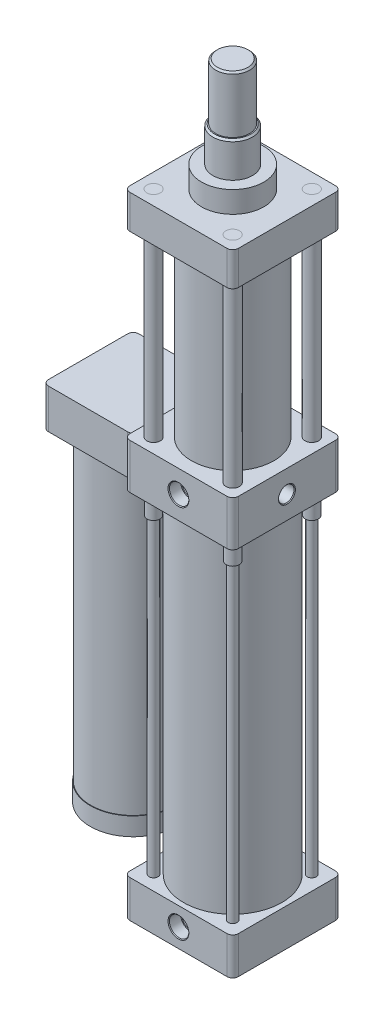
ISO-10303-21;
HEADER;
FILE_DESCRIPTION(('STEP AP214'),'2;1');
FILE_NAME('part.step','',(''),(''),'','','');
FILE_SCHEMA(('AUTOMOTIVE_DESIGN { 1 0 10303 214 1 1 1 1 }'));
ENDSEC;
DATA;
#1=APPLICATION_CONTEXT('core data for automotive mechanical design processes');
#2=APPLICATION_PROTOCOL_DEFINITION('international standard','automotive_design',2000,#1);
#3=PRODUCT_CONTEXT('',#1,'mechanical');
#4=PRODUCT('Part','Part','',(#3));
#5=PRODUCT_RELATED_PRODUCT_CATEGORY('part','',(#4));
#6=PRODUCT_DEFINITION_FORMATION('','',#4);
#7=PRODUCT_DEFINITION_CONTEXT('part definition',#1,'design');
#8=PRODUCT_DEFINITION('design','',#6,#7);
#9=PRODUCT_DEFINITION_SHAPE('','',#8);
#10=(LENGTH_UNIT() NAMED_UNIT(*) SI_UNIT(.MILLI.,.METRE.));
#11=(NAMED_UNIT(*) PLANE_ANGLE_UNIT() SI_UNIT($,.RADIAN.));
#12=(NAMED_UNIT(*) SI_UNIT($,.STERADIAN.) SOLID_ANGLE_UNIT());
#13=UNCERTAINTY_MEASURE_WITH_UNIT(LENGTH_MEASURE(1.E-05),#10,'distance_accuracy_value','');
#14=(GEOMETRIC_REPRESENTATION_CONTEXT(3) GLOBAL_UNCERTAINTY_ASSIGNED_CONTEXT((#13)) GLOBAL_UNIT_ASSIGNED_CONTEXT((#10,
#11,#12)) REPRESENTATION_CONTEXT('',''));
#15=CARTESIAN_POINT('',(0.,0.,0.));
#16=DIRECTION('',(0.,0.,1.));
#17=DIRECTION('',(1.,0.,0.));
#18=AXIS2_PLACEMENT_3D('',#15,#16,#17);
#19=CARTESIAN_POINT('',(-94.9282032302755,-495.5,12.));
#20=DIRECTION('',(0.866025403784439,0.,-0.5));
#21=DIRECTION('',(-0.5,0.,-0.866025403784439));
#22=AXIS2_PLACEMENT_3D('',#19,#20,#21);
#23=PLANE('',#22);
#24=DIRECTION('',(-0.5,0.,-0.866025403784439));
#25=VECTOR('',#24,1.);
#26=CARTESIAN_POINT('',(-94.9282032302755,-483.5,12.));
#27=LINE('',#26,#25);
#28=CARTESIAN_POINT('',(-94.9282032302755,-483.5,12.));
#29=VERTEX_POINT('',#28);
#30=CARTESIAN_POINT('',(-101.856406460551,-483.5,0.));
#31=VERTEX_POINT('',#30);
#32=EDGE_CURVE('E132',#29,#31,#27,.T.);
#33=ORIENTED_EDGE('',*,*,#32,.T.);
#34=DIRECTION('',(0.,1.,0.));
#35=VECTOR('',#34,1.);
#36=CARTESIAN_POINT('',(-101.856406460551,-495.5,0.));
#37=LINE('',#36,#35);
#38=CARTESIAN_POINT('',(-101.856406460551,-495.5,0.));
#39=VERTEX_POINT('',#38);
#40=EDGE_CURVE('E12',#39,#31,#37,.T.);
#41=ORIENTED_EDGE('',*,*,#40,.F.);
#42=DIRECTION('',(-0.5,0.,-0.866025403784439));
#43=VECTOR('',#42,1.);
#44=CARTESIAN_POINT('',(-94.9282032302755,-495.5,12.));
#45=LINE('',#44,#43);
#46=CARTESIAN_POINT('',(-94.9282032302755,-495.5,12.));
#47=VERTEX_POINT('',#46);
#48=EDGE_CURVE('E142',#47,#39,#45,.T.);
#49=ORIENTED_EDGE('',*,*,#48,.F.);
#50=DIRECTION('',(0.,1.,0.));
#51=VECTOR('',#50,1.);
#52=CARTESIAN_POINT('',(-94.9282032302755,-495.5,12.));
#53=LINE('',#52,#51);
#54=EDGE_CURVE('E128',#47,#29,#53,.T.);
#55=ORIENTED_EDGE('',*,*,#54,.T.);
#56=EDGE_LOOP('',(#33,#41,#49,#55));
#57=FACE_BOUND('',#56,.T.);
#58=ADVANCED_FACE('F47',(#57),#23,.F.);
#59=CARTESIAN_POINT('',(-101.856406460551,-495.5,0.));
#60=DIRECTION('',(0.866025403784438,0.,0.500000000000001));
#61=DIRECTION('',(0.500000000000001,0.,-0.866025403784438));
#62=AXIS2_PLACEMENT_3D('',#59,#60,#61);
#63=PLANE('',#62);
#64=DIRECTION('',(0.5,0.,-0.866025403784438));
#65=VECTOR('',#64,1.);
#66=CARTESIAN_POINT('',(-101.856406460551,-483.5,0.));
#67=LINE('',#66,#65);
#68=CARTESIAN_POINT('',(-94.9282032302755,-483.5,-12.));
#69=VERTEX_POINT('',#68);
#70=EDGE_CURVE('E135',#31,#69,#67,.T.);
#71=ORIENTED_EDGE('',*,*,#70,.T.);
#72=DIRECTION('',(0.,1.,0.));
#73=VECTOR('',#72,1.);
#74=CARTESIAN_POINT('',(-94.9282032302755,-495.5,-12.));
#75=LINE('',#74,#73);
#76=CARTESIAN_POINT('',(-94.9282032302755,-495.5,-12.));
#77=VERTEX_POINT('',#76);
#78=EDGE_CURVE('E56',#77,#69,#75,.T.);
#79=ORIENTED_EDGE('',*,*,#78,.F.);
#80=DIRECTION('',(0.5,0.,-0.866025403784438));
#81=VECTOR('',#80,1.);
#82=CARTESIAN_POINT('',(-101.856406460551,-495.5,0.));
#83=LINE('',#82,#81);
#84=EDGE_CURVE('E101',#39,#77,#83,.T.);
#85=ORIENTED_EDGE('',*,*,#84,.F.);
#86=ORIENTED_EDGE('',*,*,#40,.T.);
#87=EDGE_LOOP('',(#71,#79,#85,#86));
#88=FACE_BOUND('',#87,.T.);
#89=ADVANCED_FACE('F169',(#88),#63,.F.);
#90=CARTESIAN_POINT('',(-94.9282032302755,-495.5,-12.));
#91=DIRECTION('',(0.,0.,1.));
#92=DIRECTION('',(1.,0.,0.));
#93=AXIS2_PLACEMENT_3D('',#90,#91,#92);
#94=PLANE('',#93);
#95=DIRECTION('',(1.,0.,0.));
#96=VECTOR('',#95,1.);
#97=CARTESIAN_POINT('',(-94.9282032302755,-483.5,-12.));
#98=LINE('',#97,#96);
#99=CARTESIAN_POINT('',(-81.0717967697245,-483.5,-12.));
#100=VERTEX_POINT('',#99);
#101=EDGE_CURVE('E137',#69,#100,#98,.T.);
#102=ORIENTED_EDGE('',*,*,#101,.T.);
#103=DIRECTION('',(0.,1.,0.));
#104=VECTOR('',#103,1.);
#105=CARTESIAN_POINT('',(-81.0717967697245,-495.5,-12.));
#106=LINE('',#105,#104);
#107=CARTESIAN_POINT('',(-81.0717967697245,-495.5,-12.));
#108=VERTEX_POINT('',#107);
#109=EDGE_CURVE('E123',#108,#100,#106,.T.);
#110=ORIENTED_EDGE('',*,*,#109,.F.);
#111=DIRECTION('',(1.,0.,0.));
#112=VECTOR('',#111,1.);
#113=CARTESIAN_POINT('',(-94.9282032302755,-495.5,-12.));
#114=LINE('',#113,#112);
#115=EDGE_CURVE('E114',#77,#108,#114,.T.);
#116=ORIENTED_EDGE('',*,*,#115,.F.);
#117=ORIENTED_EDGE('',*,*,#78,.T.);
#118=EDGE_LOOP('',(#102,#110,#116,#117));
#119=FACE_BOUND('',#118,.T.);
#120=ADVANCED_FACE('F149',(#119),#94,.F.);
#121=CARTESIAN_POINT('',(-81.0717967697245,-495.5,-12.));
#122=DIRECTION('',(-0.866025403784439,0.,0.5));
#123=DIRECTION('',(0.5,0.,0.866025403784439));
#124=AXIS2_PLACEMENT_3D('',#121,#122,#123);
#125=PLANE('',#124);
#126=DIRECTION('',(0.5,0.,0.866025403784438));
#127=VECTOR('',#126,1.);
#128=CARTESIAN_POINT('',(-81.0717967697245,-483.5,-12.));
#129=LINE('',#128,#127);
#130=CARTESIAN_POINT('',(-74.143593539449,-483.5,0.));
#131=VERTEX_POINT('',#130);
#132=EDGE_CURVE('E122',#100,#131,#129,.T.);
#133=ORIENTED_EDGE('',*,*,#132,.T.);
#134=DIRECTION('',(0.,1.,0.));
#135=VECTOR('',#134,1.);
#136=CARTESIAN_POINT('',(-74.143593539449,-495.5,0.));
#137=LINE('',#136,#135);
#138=CARTESIAN_POINT('',(-74.143593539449,-495.5,0.));
#139=VERTEX_POINT('',#138);
#140=EDGE_CURVE('E119',#139,#131,#137,.T.);
#141=ORIENTED_EDGE('',*,*,#140,.F.);
#142=DIRECTION('',(0.5,0.,0.866025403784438));
#143=VECTOR('',#142,1.);
#144=CARTESIAN_POINT('',(-81.0717967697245,-495.5,-12.));
#145=LINE('',#144,#143);
#146=EDGE_CURVE('E108',#108,#139,#145,.T.);
#147=ORIENTED_EDGE('',*,*,#146,.F.);
#148=ORIENTED_EDGE('',*,*,#109,.T.);
#149=EDGE_LOOP('',(#133,#141,#147,#148));
#150=FACE_BOUND('',#149,.T.);
#151=ADVANCED_FACE('F120',(#150),#125,.F.);
#152=CARTESIAN_POINT('',(-74.143593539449,-495.5,0.));
#153=DIRECTION('',(-0.866025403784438,0.,-0.5));
#154=DIRECTION('',(-0.5,0.,0.866025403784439));
#155=AXIS2_PLACEMENT_3D('',#152,#153,#154);
#156=PLANE('',#155);
#157=DIRECTION('',(-0.5,0.,0.866025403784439));
#158=VECTOR('',#157,1.);
#159=CARTESIAN_POINT('',(-74.143593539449,-483.5,0.));
#160=LINE('',#159,#158);
#161=CARTESIAN_POINT('',(-81.0717967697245,-483.5,12.));
#162=VERTEX_POINT('',#161);
#163=EDGE_CURVE('E87',#131,#162,#160,.T.);
#164=ORIENTED_EDGE('',*,*,#163,.T.);
#165=DIRECTION('',(0.,1.,0.));
#166=VECTOR('',#165,1.);
#167=CARTESIAN_POINT('',(-81.0717967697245,-495.5,12.));
#168=LINE('',#167,#166);
#169=CARTESIAN_POINT('',(-81.0717967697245,-495.5,12.));
#170=VERTEX_POINT('',#169);
#171=EDGE_CURVE('E124',#170,#162,#168,.T.);
#172=ORIENTED_EDGE('',*,*,#171,.F.);
#173=DIRECTION('',(-0.5,0.,0.866025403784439));
#174=VECTOR('',#173,1.);
#175=CARTESIAN_POINT('',(-74.143593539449,-495.5,0.));
#176=LINE('',#175,#174);
#177=EDGE_CURVE('E112',#139,#170,#176,.T.);
#178=ORIENTED_EDGE('',*,*,#177,.F.);
#179=ORIENTED_EDGE('',*,*,#140,.T.);
#180=EDGE_LOOP('',(#164,#172,#178,#179));
#181=FACE_BOUND('',#180,.T.);
#182=ADVANCED_FACE('F126',(#181),#156,.F.);
#183=CARTESIAN_POINT('',(-81.0717967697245,-495.5,12.));
#184=DIRECTION('',(0.,0.,-1.));
#185=DIRECTION('',(-1.,0.,0.));
#186=AXIS2_PLACEMENT_3D('',#183,#184,#185);
#187=PLANE('',#186);
#188=DIRECTION('',(-1.,0.,0.));
#189=VECTOR('',#188,1.);
#190=CARTESIAN_POINT('',(-81.0717967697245,-483.5,12.));
#191=LINE('',#190,#189);
#192=EDGE_CURVE('E93',#162,#29,#191,.T.);
#193=ORIENTED_EDGE('',*,*,#192,.T.);
#194=ORIENTED_EDGE('',*,*,#54,.F.);
#195=DIRECTION('',(-1.,0.,0.));
#196=VECTOR('',#195,1.);
#197=CARTESIAN_POINT('',(-81.0717967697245,-495.5,12.));
#198=LINE('',#197,#196);
#199=EDGE_CURVE('E64',#170,#47,#198,.T.);
#200=ORIENTED_EDGE('',*,*,#199,.F.);
#201=ORIENTED_EDGE('',*,*,#171,.T.);
#202=EDGE_LOOP('',(#193,#194,#200,#201));
#203=FACE_BOUND('',#202,.T.);
#204=ADVANCED_FACE('F156',(#203),#187,.F.);
#205=CARTESIAN_POINT('',(0.,-495.5,0.));
#206=DIRECTION('',(0.,-1.,0.));
#207=DIRECTION('',(0.,0.,-1.));
#208=AXIS2_PLACEMENT_3D('',#205,#206,#207);
#209=PLANE('',#208);
#210=CARTESIAN_POINT('',(-88.,-495.5,0.));
#211=DIRECTION('',(0.,-1.,0.));
#212=DIRECTION('',(0.,0.,-1.));
#213=AXIS2_PLACEMENT_3D('',#210,#211,#212);
#214=CIRCLE('',#213,9.20749999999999);
#215=CARTESIAN_POINT('',(-88.,-495.5,-9.20749999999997));
#216=VERTEX_POINT('',#215);
#217=EDGE_CURVE('E250',#216,#216,#214,.T.);
#218=ORIENTED_EDGE('',*,*,#217,.F.);
#219=EDGE_LOOP('',(#218));
#220=FACE_BOUND('',#219,.T.);
#221=ORIENTED_EDGE('',*,*,#48,.T.);
#222=ORIENTED_EDGE('',*,*,#84,.T.);
#223=ORIENTED_EDGE('',*,*,#115,.T.);
#224=ORIENTED_EDGE('',*,*,#146,.T.);
#225=ORIENTED_EDGE('',*,*,#177,.T.);
#226=ORIENTED_EDGE('',*,*,#199,.T.);
#227=EDGE_LOOP('',(#221,#222,#223,#224,#225,#226));
#228=FACE_BOUND('',#227,.T.);
#229=ADVANCED_FACE('F110',(#220,#228),#209,.T.);
#230=CARTESIAN_POINT('',(0.,-483.5,0.));
#231=DIRECTION('',(0.,-1.,0.));
#232=DIRECTION('',(0.,0.,-1.));
#233=AXIS2_PLACEMENT_3D('',#230,#231,#232);
#234=PLANE('',#233);
#235=CARTESIAN_POINT('',(-88.,-483.5,0.));
#236=DIRECTION('',(0.,-1.,0.));
#237=DIRECTION('',(0.,0.,-1.));
#238=AXIS2_PLACEMENT_3D('',#235,#236,#237);
#239=CIRCLE('',#238,7.1374);
#240=CARTESIAN_POINT('',(-88.,-483.5,-7.13739999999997));
#241=VERTEX_POINT('',#240);
#242=EDGE_CURVE('E50',#241,#241,#239,.T.);
#243=ORIENTED_EDGE('',*,*,#242,.T.);
#244=EDGE_LOOP('',(#243));
#245=FACE_BOUND('',#244,.T.);
#246=ORIENTED_EDGE('',*,*,#32,.F.);
#247=ORIENTED_EDGE('',*,*,#192,.F.);
#248=ORIENTED_EDGE('',*,*,#163,.F.);
#249=ORIENTED_EDGE('',*,*,#132,.F.);
#250=ORIENTED_EDGE('',*,*,#101,.F.);
#251=ORIENTED_EDGE('',*,*,#70,.F.);
#252=EDGE_LOOP('',(#246,#247,#248,#249,#250,#251));
#253=FACE_BOUND('',#252,.T.);
#254=ADVANCED_FACE('F152',(#245,#253),#234,.F.);
#255=CARTESIAN_POINT('',(-88.,-495.5,0.));
#256=DIRECTION('',(0.,-1.,0.));
#257=DIRECTION('',(0.,0.,-1.));
#258=AXIS2_PLACEMENT_3D('',#255,#256,#257);
#259=CYLINDRICAL_SURFACE('',#258,7.1374);
#260=CARTESIAN_POINT('',(-88.,-485.17,0.));
#261=DIRECTION('',(0.,-1.,0.));
#262=DIRECTION('',(0.,0.,-1.));
#263=AXIS2_PLACEMENT_3D('',#260,#261,#262);
#264=CIRCLE('',#263,7.1374);
#265=CARTESIAN_POINT('',(-88.,-485.17,-7.13739999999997));
#266=VERTEX_POINT('',#265);
#267=EDGE_CURVE('E257',#266,#266,#264,.T.);
#268=ORIENTED_EDGE('',*,*,#267,.T.);
#269=EDGE_LOOP('',(#268));
#270=FACE_BOUND('',#269,.T.);
#271=ORIENTED_EDGE('',*,*,#242,.F.);
#272=EDGE_LOOP('',(#271));
#273=FACE_BOUND('',#272,.T.);
#274=ADVANCED_FACE('F202',(#270,#273),#259,.F.);
#275=CARTESIAN_POINT('',(-80.8626,-485.17,0.));
#276=DIRECTION('',(0.,1.,0.));
#277=DIRECTION('',(0.,0.,1.));
#278=AXIS2_PLACEMENT_3D('',#275,#276,#277);
#279=PLANE('',#278);
#280=ORIENTED_EDGE('',*,*,#267,.F.);
#281=EDGE_LOOP('',(#280));
#282=FACE_BOUND('',#281,.T.);
#283=CARTESIAN_POINT('',(-88.,-485.17,0.));
#284=DIRECTION('',(0.,-1.,0.));
#285=DIRECTION('',(0.,0.,-1.));
#286=AXIS2_PLACEMENT_3D('',#283,#284,#285);
#287=CIRCLE('',#286,8.2822187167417);
#288=CARTESIAN_POINT('',(-88.,-485.17,-8.28221871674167));
#289=VERTEX_POINT('',#288);
#290=EDGE_CURVE('E252',#289,#289,#287,.T.);
#291=ORIENTED_EDGE('',*,*,#290,.T.);
#292=EDGE_LOOP('',(#291));
#293=FACE_BOUND('',#292,.T.);
#294=ADVANCED_FACE('F210',(#282,#293),#279,.F.);
#295=CARTESIAN_POINT('',(-88.,-494.865,0.));
#296=DIRECTION('',(0.,-1.,0.));
#297=DIRECTION('',(0.,0.,-1.));
#298=AXIS2_PLACEMENT_3D('',#295,#296,#297);
#299=CONICAL_SURFACE('',#298,8.5725,0.0299323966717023);
#300=ORIENTED_EDGE('',*,*,#290,.F.);
#301=EDGE_LOOP('',(#300));
#302=FACE_BOUND('',#301,.T.);
#303=CARTESIAN_POINT('',(-88.,-494.865,0.));
#304=DIRECTION('',(0.,-1.,0.));
#305=DIRECTION('',(0.,0.,-1.));
#306=AXIS2_PLACEMENT_3D('',#303,#304,#305);
#307=CIRCLE('',#306,8.5725);
#308=CARTESIAN_POINT('',(-88.,-494.865,-8.57249999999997));
#309=VERTEX_POINT('',#308);
#310=EDGE_CURVE('E247',#309,#309,#307,.T.);
#311=ORIENTED_EDGE('',*,*,#310,.T.);
#312=EDGE_LOOP('',(#311));
#313=FACE_BOUND('',#312,.T.);
#314=ADVANCED_FACE('F220',(#302,#313),#299,.F.);
#315=CARTESIAN_POINT('',(-88.,-495.5,0.));
#316=DIRECTION('',(0.,-1.,0.));
#317=DIRECTION('',(0.,0.,-1.));
#318=AXIS2_PLACEMENT_3D('',#315,#316,#317);
#319=CONICAL_SURFACE('',#318,9.20749999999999,0.785398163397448);
#320=ORIENTED_EDGE('',*,*,#310,.F.);
#321=EDGE_LOOP('',(#320));
#322=FACE_BOUND('',#321,.T.);
#323=ORIENTED_EDGE('',*,*,#217,.T.);
#324=EDGE_LOOP('',(#323));
#325=FACE_BOUND('',#324,.T.);
#326=ADVANCED_FACE('F230',(#322,#325),#319,.F.);
#327=CLOSED_SHELL('',(#58,#89,#120,#151,#182,#204,#229,#254,#274,#294,#314,#326));
#328=MANIFOLD_SOLID_BREP('B2',#327);
#329=CARTESIAN_POINT('',(-88.,-483.5,0.));
#330=DIRECTION('',(0.,1.,0.));
#331=DIRECTION('',(0.,0.,1.));
#332=AXIS2_PLACEMENT_3D('',#329,#330,#331);
#333=CYLINDRICAL_SURFACE('',#332,38.);
#334=CARTESIAN_POINT('',(-88.,-483.5,0.));
#335=DIRECTION('',(0.,-1.,0.));
#336=DIRECTION('',(0.,0.,-1.));
#337=AXIS2_PLACEMENT_3D('',#334,#335,#336);
#338=CIRCLE('',#337,38.);
#339=CARTESIAN_POINT('',(-88.,-483.5,-38.));
#340=VERTEX_POINT('',#339);
#341=EDGE_CURVE('E45',#340,#340,#338,.T.);
#342=ORIENTED_EDGE('',*,*,#341,.F.);
#343=EDGE_LOOP('',(#342));
#344=FACE_BOUND('',#343,.T.);
#345=CARTESIAN_POINT('',(-88.,-467.5,0.));
#346=DIRECTION('',(0.,-1.,0.));
#347=DIRECTION('',(0.,0.,-1.));
#348=AXIS2_PLACEMENT_3D('',#345,#346,#347);
#349=CIRCLE('',#348,38.);
#350=CARTESIAN_POINT('',(-88.,-467.5,-38.));
#351=VERTEX_POINT('',#350);
#352=EDGE_CURVE('E303',#351,#351,#349,.T.);
#353=ORIENTED_EDGE('',*,*,#352,.T.);
#354=EDGE_LOOP('',(#353));
#355=FACE_BOUND('',#354,.T.);
#356=ADVANCED_FACE('F296',(#344,#355),#333,.T.);
#357=CARTESIAN_POINT('',(-88.,-483.5,0.));
#358=DIRECTION('',(0.,-1.,0.));
#359=DIRECTION('',(0.,0.,-1.));
#360=AXIS2_PLACEMENT_3D('',#357,#358,#359);
#361=PLANE('',#360);
#362=CARTESIAN_POINT('',(-88.,-483.5,0.));
#363=DIRECTION('',(0.,-1.,0.));
#364=DIRECTION('',(0.,0.,-1.));
#365=AXIS2_PLACEMENT_3D('',#362,#363,#364);
#366=CIRCLE('',#365,7.1374);
#367=CARTESIAN_POINT('',(-88.,-483.5,-7.13739999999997));
#368=VERTEX_POINT('',#367);
#369=EDGE_CURVE('E299',#368,#368,#366,.T.);
#370=ORIENTED_EDGE('',*,*,#369,.F.);
#371=EDGE_LOOP('',(#370));
#372=FACE_BOUND('',#371,.T.);
#373=ORIENTED_EDGE('',*,*,#341,.T.);
#374=EDGE_LOOP('',(#373));
#375=FACE_BOUND('',#374,.T.);
#376=ADVANCED_FACE('F324',(#372,#375),#361,.T.);
#377=CARTESIAN_POINT('',(-88.,-467.5,0.));
#378=DIRECTION('',(0.,-1.,0.));
#379=DIRECTION('',(0.,0.,-1.));
#380=AXIS2_PLACEMENT_3D('',#377,#378,#379);
#381=PLANE('',#380);
#382=ORIENTED_EDGE('',*,*,#352,.F.);
#383=EDGE_LOOP('',(#382));
#384=FACE_BOUND('',#383,.T.);
#385=ADVANCED_FACE('F311',(#384),#381,.F.);
#386=CARTESIAN_POINT('',(-88.,-478.12,0.));
#387=DIRECTION('',(0.,-1.,0.));
#388=DIRECTION('',(0.,0.,-1.));
#389=AXIS2_PLACEMENT_3D('',#386,#387,#388);
#390=CONICAL_SURFACE('',#389,7.1374,1.02974425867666);
#391=CARTESIAN_POINT('',(-88.,-473.831417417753,0.));
#392=VERTEX_POINT('',#391);
#393=VERTEX_LOOP('',#392);
#394=FACE_BOUND('',#393,.T.);
#395=CARTESIAN_POINT('',(-88.,-478.12,0.));
#396=DIRECTION('',(0.,-1.,0.));
#397=DIRECTION('',(0.,0.,-1.));
#398=AXIS2_PLACEMENT_3D('',#395,#396,#397);
#399=CIRCLE('',#398,7.1374);
#400=CARTESIAN_POINT('',(-88.,-478.12,-7.13739999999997));
#401=VERTEX_POINT('',#400);
#402=EDGE_CURVE('E315',#401,#401,#399,.T.);
#403=ORIENTED_EDGE('',*,*,#402,.T.);
#404=EDGE_LOOP('',(#403));
#405=FACE_BOUND('',#404,.T.);
#406=ADVANCED_FACE('F307',(#394,#405),#390,.F.);
#407=CARTESIAN_POINT('',(-88.,-495.5,0.));
#408=DIRECTION('',(0.,-1.,0.));
#409=DIRECTION('',(0.,0.,-1.));
#410=AXIS2_PLACEMENT_3D('',#407,#408,#409);
#411=CYLINDRICAL_SURFACE('',#410,7.1374);
#412=ORIENTED_EDGE('',*,*,#369,.T.);
#413=EDGE_LOOP('',(#412));
#414=FACE_BOUND('',#413,.T.);
#415=ORIENTED_EDGE('',*,*,#402,.F.);
#416=EDGE_LOOP('',(#415));
#417=FACE_BOUND('',#416,.T.);
#418=ADVANCED_FACE('F310',(#414,#417),#411,.F.);
#419=CLOSED_SHELL('',(#356,#376,#385,#406,#418));
#420=MANIFOLD_SOLID_BREP('B6',#419);
#421=CARTESIAN_POINT('',(-88.,-467.5,0.));
#422=DIRECTION('',(0.,1.,0.));
#423=DIRECTION('',(0.,0.,1.));
#424=AXIS2_PLACEMENT_3D('',#421,#422,#423);
#425=CYLINDRICAL_SURFACE('',#424,37.5);
#426=CARTESIAN_POINT('',(-88.,-467.5,0.));
#427=DIRECTION('',(0.,-1.,0.));
#428=DIRECTION('',(0.,0.,-1.));
#429=AXIS2_PLACEMENT_3D('',#426,#427,#428);
#430=CIRCLE('',#429,37.5);
#431=CARTESIAN_POINT('',(-88.,-467.5,-37.5));
#432=VERTEX_POINT('',#431);
#433=EDGE_CURVE('E295',#432,#432,#430,.T.);
#434=ORIENTED_EDGE('',*,*,#433,.F.);
#435=EDGE_LOOP('',(#434));
#436=FACE_BOUND('',#435,.T.);
#437=CARTESIAN_POINT('',(-88.,-197.5,0.));
#438=DIRECTION('',(0.,-1.,0.));
#439=DIRECTION('',(0.,0.,-1.));
#440=AXIS2_PLACEMENT_3D('',#437,#438,#439);
#441=CIRCLE('',#440,37.5);
#442=CARTESIAN_POINT('',(-88.,-197.5,-37.5));
#443=VERTEX_POINT('',#442);
#444=EDGE_CURVE('E381',#443,#443,#441,.T.);
#445=ORIENTED_EDGE('',*,*,#444,.T.);
#446=EDGE_LOOP('',(#445));
#447=FACE_BOUND('',#446,.T.);
#448=ADVANCED_FACE('F378',(#436,#447),#425,.T.);
#449=CARTESIAN_POINT('',(-88.,-467.5,0.));
#450=DIRECTION('',(0.,-1.,0.));
#451=DIRECTION('',(0.,0.,-1.));
#452=AXIS2_PLACEMENT_3D('',#449,#450,#451);
#453=PLANE('',#452);
#454=ORIENTED_EDGE('',*,*,#433,.T.);
#455=EDGE_LOOP('',(#454));
#456=FACE_BOUND('',#455,.T.);
#457=ADVANCED_FACE('F393',(#456),#453,.T.);
#458=CARTESIAN_POINT('',(-88.,-197.5,0.));
#459=DIRECTION('',(0.,-1.,0.));
#460=DIRECTION('',(0.,0.,-1.));
#461=AXIS2_PLACEMENT_3D('',#458,#459,#460);
#462=PLANE('',#461);
#463=ORIENTED_EDGE('',*,*,#444,.F.);
#464=EDGE_LOOP('',(#463));
#465=FACE_BOUND('',#464,.T.);
#466=ADVANCED_FACE('F391',(#465),#462,.F.);
#467=CLOSED_SHELL('',(#448,#457,#466));
#468=MANIFOLD_SOLID_BREP('B39',#467);
#469=CARTESIAN_POINT('',(-53.,-197.5,-35.));
#470=DIRECTION('',(0.,1.,0.));
#471=DIRECTION('',(0.,0.,1.));
#472=AXIS2_PLACEMENT_3D('',#469,#470,#471);
#473=CYLINDRICAL_SURFACE('',#472,5.);
#474=CARTESIAN_POINT('',(-53.,-162.5,-35.));
#475=DIRECTION('',(0.,1.,0.));
#476=DIRECTION('',(0.,0.,1.));
#477=AXIS2_PLACEMENT_3D('',#474,#475,#476);
#478=CIRCLE('',#477,5.);
#479=CARTESIAN_POINT('',(-48.,-162.5,-34.9999999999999));
#480=VERTEX_POINT('',#479);
#481=CARTESIAN_POINT('',(-53.,-162.5,-40.));
#482=VERTEX_POINT('',#481);
#483=EDGE_CURVE('E523',#480,#482,#478,.T.);
#484=ORIENTED_EDGE('',*,*,#483,.F.);
#485=DIRECTION('',(0.,1.,0.));
#486=VECTOR('',#485,1.);
#487=CARTESIAN_POINT('',(-48.,-197.5,-34.9999999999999));
#488=LINE('',#487,#486);
#489=CARTESIAN_POINT('',(-48.,-197.5,-34.9999999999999));
#490=VERTEX_POINT('',#489);
#491=EDGE_CURVE('E376',#490,#480,#488,.T.);
#492=ORIENTED_EDGE('',*,*,#491,.F.);
#493=CARTESIAN_POINT('',(-53.,-197.5,-35.));
#494=DIRECTION('',(0.,1.,0.));
#495=DIRECTION('',(0.,0.,1.));
#496=AXIS2_PLACEMENT_3D('',#493,#494,#495);
#497=CIRCLE('',#496,5.);
#498=CARTESIAN_POINT('',(-53.,-197.5,-40.));
#499=VERTEX_POINT('',#498);
#500=EDGE_CURVE('E543',#490,#499,#497,.T.);
#501=ORIENTED_EDGE('',*,*,#500,.T.);
#502=DIRECTION('',(0.,1.,0.));
#503=VECTOR('',#502,1.);
#504=CARTESIAN_POINT('',(-53.,-197.5,-40.));
#505=LINE('',#504,#503);
#506=EDGE_CURVE('E429',#499,#482,#505,.T.);
#507=ORIENTED_EDGE('',*,*,#506,.T.);
#508=EDGE_LOOP('',(#484,#492,#501,#507));
#509=FACE_BOUND('',#508,.T.);
#510=ADVANCED_FACE('F426',(#509),#473,.T.);
#511=CARTESIAN_POINT('',(-48.,-197.5,-34.9999999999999));
#512=DIRECTION('',(1.,0.,0.));
#513=DIRECTION('',(0.,0.,-1.));
#514=AXIS2_PLACEMENT_3D('',#511,#512,#513);
#515=PLANE('',#514);
#516=DIRECTION('',(0.,0.,-1.));
#517=VECTOR('',#516,1.);
#518=CARTESIAN_POINT('',(-48.,-162.5,-34.9999999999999));
#519=LINE('',#518,#517);
#520=CARTESIAN_POINT('',(-48.,-162.5,35.));
#521=VERTEX_POINT('',#520);
#522=EDGE_CURVE('E541',#521,#480,#519,.T.);
#523=ORIENTED_EDGE('',*,*,#522,.F.);
#524=DIRECTION('',(0.,1.,0.));
#525=VECTOR('',#524,1.);
#526=CARTESIAN_POINT('',(-48.,-197.5,35.));
#527=LINE('',#526,#525);
#528=CARTESIAN_POINT('',(-48.,-197.5,35.));
#529=VERTEX_POINT('',#528);
#530=EDGE_CURVE('E435',#529,#521,#527,.T.);
#531=ORIENTED_EDGE('',*,*,#530,.F.);
#532=DIRECTION('',(0.,0.,-1.));
#533=VECTOR('',#532,1.);
#534=CARTESIAN_POINT('',(-48.,-197.5,-34.9999999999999));
#535=LINE('',#534,#533);
#536=EDGE_CURVE('E513',#529,#490,#535,.T.);
#537=ORIENTED_EDGE('',*,*,#536,.T.);
#538=ORIENTED_EDGE('',*,*,#491,.T.);
#539=EDGE_LOOP('',(#523,#531,#537,#538));
#540=FACE_BOUND('',#539,.T.);
#541=ADVANCED_FACE('F555',(#540),#515,.T.);
#542=CARTESIAN_POINT('',(-53.,-197.5,35.));
#543=DIRECTION('',(0.,1.,0.));
#544=DIRECTION('',(0.,0.,1.));
#545=AXIS2_PLACEMENT_3D('',#542,#543,#544);
#546=CYLINDRICAL_SURFACE('',#545,5.);
#547=CARTESIAN_POINT('',(-53.,-162.5,35.));
#548=DIRECTION('',(0.,1.,0.));
#549=DIRECTION('',(0.,0.,1.));
#550=AXIS2_PLACEMENT_3D('',#547,#548,#549);
#551=CIRCLE('',#550,5.);
#552=CARTESIAN_POINT('',(-53.,-162.5,40.));
#553=VERTEX_POINT('',#552);
#554=EDGE_CURVE('E500',#553,#521,#551,.T.);
#555=ORIENTED_EDGE('',*,*,#554,.F.);
#556=DIRECTION('',(0.,1.,0.));
#557=VECTOR('',#556,1.);
#558=CARTESIAN_POINT('',(-53.,-197.5,40.));
#559=LINE('',#558,#557);
#560=CARTESIAN_POINT('',(-53.,-197.5,40.));
#561=VERTEX_POINT('',#560);
#562=EDGE_CURVE('E495',#561,#553,#559,.T.);
#563=ORIENTED_EDGE('',*,*,#562,.F.);
#564=CARTESIAN_POINT('',(-53.,-197.5,35.));
#565=DIRECTION('',(0.,1.,0.));
#566=DIRECTION('',(0.,0.,1.));
#567=AXIS2_PLACEMENT_3D('',#564,#565,#566);
#568=CIRCLE('',#567,5.);
#569=EDGE_CURVE('E498',#561,#529,#568,.T.);
#570=ORIENTED_EDGE('',*,*,#569,.T.);
#571=ORIENTED_EDGE('',*,*,#530,.T.);
#572=EDGE_LOOP('',(#555,#563,#570,#571));
#573=FACE_BOUND('',#572,.T.);
#574=ADVANCED_FACE('F497',(#573),#546,.T.);
#575=CARTESIAN_POINT('',(-123.,-197.5,40.));
#576=DIRECTION('',(0.,0.,1.));
#577=DIRECTION('',(1.,0.,0.));
#578=AXIS2_PLACEMENT_3D('',#575,#576,#577);
#579=PLANE('',#578);
#580=DIRECTION('',(1.,0.,0.));
#581=VECTOR('',#580,1.);
#582=CARTESIAN_POINT('',(-123.,-162.5,40.));
#583=LINE('',#582,#581);
#584=CARTESIAN_POINT('',(-123.,-162.5,40.));
#585=VERTEX_POINT('',#584);
#586=EDGE_CURVE('E538',#585,#553,#583,.T.);
#587=ORIENTED_EDGE('',*,*,#586,.F.);
#588=DIRECTION('',(0.,1.,0.));
#589=VECTOR('',#588,1.);
#590=CARTESIAN_POINT('',(-123.,-197.5,40.));
#591=LINE('',#590,#589);
#592=CARTESIAN_POINT('',(-123.,-197.5,40.));
#593=VERTEX_POINT('',#592);
#594=EDGE_CURVE('E505',#593,#585,#591,.T.);
#595=ORIENTED_EDGE('',*,*,#594,.F.);
#596=DIRECTION('',(1.,0.,0.));
#597=VECTOR('',#596,1.);
#598=CARTESIAN_POINT('',(-123.,-197.5,40.));
#599=LINE('',#598,#597);
#600=EDGE_CURVE('E511',#593,#561,#599,.T.);
#601=ORIENTED_EDGE('',*,*,#600,.T.);
#602=ORIENTED_EDGE('',*,*,#562,.T.);
#603=EDGE_LOOP('',(#587,#595,#601,#602));
#604=FACE_BOUND('',#603,.T.);
#605=ADVANCED_FACE('F515',(#604),#579,.T.);
#606=CARTESIAN_POINT('',(-123.,-197.5,35.));
#607=DIRECTION('',(0.,1.,0.));
#608=DIRECTION('',(0.,0.,1.));
#609=AXIS2_PLACEMENT_3D('',#606,#607,#608);
#610=CYLINDRICAL_SURFACE('',#609,4.99999999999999);
#611=CARTESIAN_POINT('',(-123.,-162.5,35.));
#612=DIRECTION('',(0.,1.,0.));
#613=DIRECTION('',(0.,0.,-1.));
#614=AXIS2_PLACEMENT_3D('',#611,#612,#613);
#615=CIRCLE('',#614,4.99999999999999);
#616=CARTESIAN_POINT('',(-128.,-162.5,35.));
#617=VERTEX_POINT('',#616);
#618=EDGE_CURVE('E535',#617,#585,#615,.T.);
#619=ORIENTED_EDGE('',*,*,#618,.F.);
#620=DIRECTION('',(0.,1.,0.));
#621=VECTOR('',#620,1.);
#622=CARTESIAN_POINT('',(-128.,-197.5,35.));
#623=LINE('',#622,#621);
#624=CARTESIAN_POINT('',(-128.,-197.5,35.));
#625=VERTEX_POINT('',#624);
#626=EDGE_CURVE('E547',#625,#617,#623,.T.);
#627=ORIENTED_EDGE('',*,*,#626,.F.);
#628=CARTESIAN_POINT('',(-123.,-197.5,35.));
#629=DIRECTION('',(0.,1.,0.));
#630=DIRECTION('',(0.,0.,-1.));
#631=AXIS2_PLACEMENT_3D('',#628,#629,#630);
#632=CIRCLE('',#631,4.99999999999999);
#633=EDGE_CURVE('E516',#625,#593,#632,.T.);
#634=ORIENTED_EDGE('',*,*,#633,.T.);
#635=ORIENTED_EDGE('',*,*,#594,.T.);
#636=EDGE_LOOP('',(#619,#627,#634,#635));
#637=FACE_BOUND('',#636,.T.);
#638=ADVANCED_FACE('F568',(#637),#610,.T.);
#639=CARTESIAN_POINT('',(-128.,-197.5,-34.9999999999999));
#640=DIRECTION('',(-1.,0.,0.));
#641=DIRECTION('',(0.,0.,1.));
#642=AXIS2_PLACEMENT_3D('',#639,#640,#641);
#643=PLANE('',#642);
#644=DIRECTION('',(0.,0.,1.));
#645=VECTOR('',#644,1.);
#646=CARTESIAN_POINT('',(-128.,-162.5,-34.9999999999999));
#647=LINE('',#646,#645);
#648=CARTESIAN_POINT('',(-128.,-162.5,-34.9999999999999));
#649=VERTEX_POINT('',#648);
#650=EDGE_CURVE('E532',#649,#617,#647,.T.);
#651=ORIENTED_EDGE('',*,*,#650,.F.);
#652=DIRECTION('',(0.,1.,0.));
#653=VECTOR('',#652,1.);
#654=CARTESIAN_POINT('',(-128.,-197.5,-34.9999999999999));
#655=LINE('',#654,#653);
#656=CARTESIAN_POINT('',(-128.,-197.5,-34.9999999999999));
#657=VERTEX_POINT('',#656);
#658=EDGE_CURVE('E549',#657,#649,#655,.T.);
#659=ORIENTED_EDGE('',*,*,#658,.F.);
#660=DIRECTION('',(0.,0.,1.));
#661=VECTOR('',#660,1.);
#662=CARTESIAN_POINT('',(-128.,-197.5,-34.9999999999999));
#663=LINE('',#662,#661);
#664=EDGE_CURVE('E518',#657,#625,#663,.T.);
#665=ORIENTED_EDGE('',*,*,#664,.T.);
#666=ORIENTED_EDGE('',*,*,#626,.T.);
#667=EDGE_LOOP('',(#651,#659,#665,#666));
#668=FACE_BOUND('',#667,.T.);
#669=ADVANCED_FACE('F571',(#668),#643,.T.);
#670=CARTESIAN_POINT('',(-123.,-197.5,-35.));
#671=DIRECTION('',(0.,1.,0.));
#672=DIRECTION('',(0.,0.,1.));
#673=AXIS2_PLACEMENT_3D('',#670,#671,#672);
#674=CYLINDRICAL_SURFACE('',#673,5.);
#675=CARTESIAN_POINT('',(-123.,-162.5,-35.));
#676=DIRECTION('',(0.,1.,0.));
#677=DIRECTION('',(0.,0.,-1.));
#678=AXIS2_PLACEMENT_3D('',#675,#676,#677);
#679=CIRCLE('',#678,5.);
#680=CARTESIAN_POINT('',(-123.,-162.5,-40.));
#681=VERTEX_POINT('',#680);
#682=EDGE_CURVE('E529',#681,#649,#679,.T.);
#683=ORIENTED_EDGE('',*,*,#682,.F.);
#684=DIRECTION('',(0.,1.,0.));
#685=VECTOR('',#684,1.);
#686=CARTESIAN_POINT('',(-123.,-197.5,-40.));
#687=LINE('',#686,#685);
#688=CARTESIAN_POINT('',(-123.,-197.5,-40.));
#689=VERTEX_POINT('',#688);
#690=EDGE_CURVE('E550',#689,#681,#687,.T.);
#691=ORIENTED_EDGE('',*,*,#690,.F.);
#692=CARTESIAN_POINT('',(-123.,-197.5,-35.));
#693=DIRECTION('',(0.,1.,0.));
#694=DIRECTION('',(0.,0.,-1.));
#695=AXIS2_PLACEMENT_3D('',#692,#693,#694);
#696=CIRCLE('',#695,5.);
#697=EDGE_CURVE('E646',#689,#657,#696,.T.);
#698=ORIENTED_EDGE('',*,*,#697,.T.);
#699=ORIENTED_EDGE('',*,*,#658,.T.);
#700=EDGE_LOOP('',(#683,#691,#698,#699));
#701=FACE_BOUND('',#700,.T.);
#702=ADVANCED_FACE('F575',(#701),#674,.T.);
#703=CARTESIAN_POINT('',(-123.,-197.5,-40.));
#704=DIRECTION('',(0.,0.,-1.));
#705=DIRECTION('',(-1.,0.,0.));
#706=AXIS2_PLACEMENT_3D('',#703,#704,#705);
#707=PLANE('',#706);
#708=DIRECTION('',(-1.,0.,0.));
#709=VECTOR('',#708,1.);
#710=CARTESIAN_POINT('',(-123.,-162.5,-40.));
#711=LINE('',#710,#709);
#712=EDGE_CURVE('E526',#482,#681,#711,.T.);
#713=ORIENTED_EDGE('',*,*,#712,.F.);
#714=ORIENTED_EDGE('',*,*,#506,.F.);
#715=DIRECTION('',(-1.,0.,0.));
#716=VECTOR('',#715,1.);
#717=CARTESIAN_POINT('',(-123.,-197.5,-40.));
#718=LINE('',#717,#716);
#719=EDGE_CURVE('E647',#499,#689,#718,.T.);
#720=ORIENTED_EDGE('',*,*,#719,.T.);
#721=ORIENTED_EDGE('',*,*,#690,.T.);
#722=EDGE_LOOP('',(#713,#714,#720,#721));
#723=FACE_BOUND('',#722,.T.);
#724=ADVANCED_FACE('F552',(#723),#707,.T.);
#725=CARTESIAN_POINT('',(-53.,-197.5,-35.));
#726=DIRECTION('',(0.,1.,0.));
#727=DIRECTION('',(0.,0.,1.));
#728=AXIS2_PLACEMENT_3D('',#725,#726,#727);
#729=PLANE('',#728);
#730=ORIENTED_EDGE('',*,*,#500,.F.);
#731=ORIENTED_EDGE('',*,*,#536,.F.);
#732=ORIENTED_EDGE('',*,*,#569,.F.);
#733=ORIENTED_EDGE('',*,*,#600,.F.);
#734=ORIENTED_EDGE('',*,*,#633,.F.);
#735=ORIENTED_EDGE('',*,*,#664,.F.);
#736=ORIENTED_EDGE('',*,*,#697,.F.);
#737=ORIENTED_EDGE('',*,*,#719,.F.);
#738=EDGE_LOOP('',(#730,#731,#732,#733,#734,#735,#736,#737));
#739=FACE_BOUND('',#738,.T.);
#740=ADVANCED_FACE('F509',(#739),#729,.F.);
#741=CARTESIAN_POINT('',(-53.,-162.5,-35.));
#742=DIRECTION('',(0.,1.,0.));
#743=DIRECTION('',(0.,0.,1.));
#744=AXIS2_PLACEMENT_3D('',#741,#742,#743);
#745=PLANE('',#744);
#746=ORIENTED_EDGE('',*,*,#483,.T.);
#747=ORIENTED_EDGE('',*,*,#712,.T.);
#748=ORIENTED_EDGE('',*,*,#682,.T.);
#749=ORIENTED_EDGE('',*,*,#650,.T.);
#750=ORIENTED_EDGE('',*,*,#618,.T.);
#751=ORIENTED_EDGE('',*,*,#586,.T.);
#752=ORIENTED_EDGE('',*,*,#554,.T.);
#753=ORIENTED_EDGE('',*,*,#522,.T.);
#754=EDGE_LOOP('',(#746,#747,#748,#749,#750,#751,#752,#753));
#755=FACE_BOUND('',#754,.T.);
#756=ADVANCED_FACE('F554',(#755),#745,.T.);
#757=CLOSED_SHELL('',(#510,#541,#574,#605,#638,#669,#702,#724,#740,#756));
#758=MANIFOLD_SOLID_BREP('B290',#757);
#759=CARTESIAN_POINT('',(-43.,-160.,-43.));
#760=DIRECTION('',(0.,-1.,0.));
#761=DIRECTION('',(0.,0.,-1.));
#762=AXIS2_PLACEMENT_3D('',#759,#760,#761);
#763=PLANE('',#762);
#764=CARTESIAN_POINT('',(-35.0000000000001,-160.,34.9999999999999));
#765=DIRECTION('',(0.,-1.,0.));
#766=DIRECTION('',(0.,0.,-1.));
#767=AXIS2_PLACEMENT_3D('',#764,#765,#766);
#768=CIRCLE('',#767,6.00000000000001);
#769=CARTESIAN_POINT('',(-35.0000000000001,-160.,28.9999999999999));
#770=VERTEX_POINT('',#769);
#771=EDGE_CURVE('E425',#770,#770,#768,.F.);
#772=ORIENTED_EDGE('',*,*,#771,.F.);
#773=EDGE_LOOP('',(#772));
#774=FACE_BOUND('',#773,.T.);
#775=ADVANCED_FACE('F661',(#774),#763,.T.);
#776=CARTESIAN_POINT('',(-35.0000000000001,30.,34.9999999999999));
#777=DIRECTION('',(0.,1.,0.));
#778=DIRECTION('',(0.,0.,1.));
#779=AXIS2_PLACEMENT_3D('',#776,#777,#778);
#780=PLANE('',#779);
#781=CARTESIAN_POINT('',(-35.0000000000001,30.,34.9999999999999));
#782=DIRECTION('',(0.,1.,0.));
#783=DIRECTION('',(0.,0.,1.));
#784=AXIS2_PLACEMENT_3D('',#781,#782,#783);
#785=CIRCLE('',#784,6.00000000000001);
#786=CARTESIAN_POINT('',(-35.0000000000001,30.,40.9999999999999));
#787=VERTEX_POINT('',#786);
#788=EDGE_CURVE('E667',#787,#787,#785,.T.);
#789=ORIENTED_EDGE('',*,*,#788,.T.);
#790=EDGE_LOOP('',(#789));
#791=FACE_BOUND('',#790,.T.);
#792=ADVANCED_FACE('F673',(#791),#780,.T.);
#793=CARTESIAN_POINT('',(-35.0000000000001,-176.970562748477,34.9999999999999));
#794=DIRECTION('',(0.,1.,0.));
#795=DIRECTION('',(0.,0.,1.));
#796=AXIS2_PLACEMENT_3D('',#793,#794,#795);
#797=CYLINDRICAL_SURFACE('',#796,6.00000000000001);
#798=ORIENTED_EDGE('',*,*,#788,.F.);
#799=EDGE_LOOP('',(#798));
#800=FACE_BOUND('',#799,.T.);
#801=ORIENTED_EDGE('',*,*,#771,.T.);
#802=EDGE_LOOP('',(#801));
#803=FACE_BOUND('',#802,.T.);
#804=ADVANCED_FACE('F675',(#800,#803),#797,.T.);
#805=CLOSED_SHELL('',(#775,#792,#804));
#806=MANIFOLD_SOLID_BREP('B370',#805);
#807=CARTESIAN_POINT('',(-43.,-160.,-43.));
#808=DIRECTION('',(0.,-1.,0.));
#809=DIRECTION('',(0.,0.,-1.));
#810=AXIS2_PLACEMENT_3D('',#807,#808,#809);
#811=PLANE('',#810);
#812=CARTESIAN_POINT('',(-34.9999999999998,-160.,-35.0000000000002));
#813=DIRECTION('',(0.,-1.,0.));
#814=DIRECTION('',(0.,0.,-1.));
#815=AXIS2_PLACEMENT_3D('',#812,#813,#814);
#816=CIRCLE('',#815,6.);
#817=CARTESIAN_POINT('',(-34.9999999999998,-160.,-41.0000000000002));
#818=VERTEX_POINT('',#817);
#819=EDGE_CURVE('E660',#818,#818,#816,.F.);
#820=ORIENTED_EDGE('',*,*,#819,.F.);
#821=EDGE_LOOP('',(#820));
#822=FACE_BOUND('',#821,.T.);
#823=ADVANCED_FACE('F709',(#822),#811,.T.);
#824=CARTESIAN_POINT('',(-34.9999999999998,30.,-35.0000000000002));
#825=DIRECTION('',(0.,1.,0.));
#826=DIRECTION('',(0.,0.,1.));
#827=AXIS2_PLACEMENT_3D('',#824,#825,#826);
#828=PLANE('',#827);
#829=CARTESIAN_POINT('',(-34.9999999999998,30.,-35.0000000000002));
#830=DIRECTION('',(0.,1.,0.));
#831=DIRECTION('',(0.,0.,1.));
#832=AXIS2_PLACEMENT_3D('',#829,#830,#831);
#833=CIRCLE('',#832,6.);
#834=CARTESIAN_POINT('',(-34.9999999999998,30.,-29.0000000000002));
#835=VERTEX_POINT('',#834);
#836=EDGE_CURVE('E715',#835,#835,#833,.T.);
#837=ORIENTED_EDGE('',*,*,#836,.T.);
#838=EDGE_LOOP('',(#837));
#839=FACE_BOUND('',#838,.T.);
#840=ADVANCED_FACE('F721',(#839),#828,.T.);
#841=CARTESIAN_POINT('',(-34.9999999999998,-176.970562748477,-35.0000000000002));
#842=DIRECTION('',(0.,1.,0.));
#843=DIRECTION('',(0.,0.,1.));
#844=AXIS2_PLACEMENT_3D('',#841,#842,#843);
#845=CYLINDRICAL_SURFACE('',#844,6.);
#846=ORIENTED_EDGE('',*,*,#836,.F.);
#847=EDGE_LOOP('',(#846));
#848=FACE_BOUND('',#847,.T.);
#849=ORIENTED_EDGE('',*,*,#819,.T.);
#850=EDGE_LOOP('',(#849));
#851=FACE_BOUND('',#850,.T.);
#852=ADVANCED_FACE('F723',(#848,#851),#845,.T.);
#853=CLOSED_SHELL('',(#823,#840,#852));
#854=MANIFOLD_SOLID_BREP('B420',#853);
#855=CARTESIAN_POINT('',(-43.,-160.,-43.));
#856=DIRECTION('',(0.,-1.,0.));
#857=DIRECTION('',(0.,0.,-1.));
#858=AXIS2_PLACEMENT_3D('',#855,#856,#857);
#859=PLANE('',#858);
#860=CARTESIAN_POINT('',(35.0000000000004,-160.,-34.9999999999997));
#861=DIRECTION('',(0.,-1.,0.));
#862=DIRECTION('',(0.,0.,-1.));
#863=AXIS2_PLACEMENT_3D('',#860,#861,#862);
#864=CIRCLE('',#863,6.00000000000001);
#865=CARTESIAN_POINT('',(35.0000000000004,-160.,-40.9999999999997));
#866=VERTEX_POINT('',#865);
#867=EDGE_CURVE('E708',#866,#866,#864,.F.);
#868=ORIENTED_EDGE('',*,*,#867,.F.);
#869=EDGE_LOOP('',(#868));
#870=FACE_BOUND('',#869,.T.);
#871=ADVANCED_FACE('F757',(#870),#859,.T.);
#872=CARTESIAN_POINT('',(35.0000000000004,30.,-34.9999999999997));
#873=DIRECTION('',(0.,1.,0.));
#874=DIRECTION('',(0.,0.,1.));
#875=AXIS2_PLACEMENT_3D('',#872,#873,#874);
#876=PLANE('',#875);
#877=CARTESIAN_POINT('',(35.0000000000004,30.,-34.9999999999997));
#878=DIRECTION('',(0.,1.,0.));
#879=DIRECTION('',(0.,0.,1.));
#880=AXIS2_PLACEMENT_3D('',#877,#878,#879);
#881=CIRCLE('',#880,6.00000000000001);
#882=CARTESIAN_POINT('',(35.0000000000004,30.,-28.9999999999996));
#883=VERTEX_POINT('',#882);
#884=EDGE_CURVE('E763',#883,#883,#881,.T.);
#885=ORIENTED_EDGE('',*,*,#884,.T.);
#886=EDGE_LOOP('',(#885));
#887=FACE_BOUND('',#886,.T.);
#888=ADVANCED_FACE('F769',(#887),#876,.T.);
#889=CARTESIAN_POINT('',(35.0000000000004,-176.970562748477,-34.9999999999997));
#890=DIRECTION('',(0.,1.,0.));
#891=DIRECTION('',(0.,0.,1.));
#892=AXIS2_PLACEMENT_3D('',#889,#890,#891);
#893=CYLINDRICAL_SURFACE('',#892,6.00000000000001);
#894=ORIENTED_EDGE('',*,*,#884,.F.);
#895=EDGE_LOOP('',(#894));
#896=FACE_BOUND('',#895,.T.);
#897=ORIENTED_EDGE('',*,*,#867,.T.);
#898=EDGE_LOOP('',(#897));
#899=FACE_BOUND('',#898,.T.);
#900=ADVANCED_FACE('F771',(#896,#899),#893,.T.);
#901=CLOSED_SHELL('',(#871,#888,#900));
#902=MANIFOLD_SOLID_BREP('B655',#901);
#903=CARTESIAN_POINT('',(-43.,-160.,-43.));
#904=DIRECTION('',(0.,-1.,0.));
#905=DIRECTION('',(0.,0.,-1.));
#906=AXIS2_PLACEMENT_3D('',#903,#904,#905);
#907=PLANE('',#906);
#908=CARTESIAN_POINT('',(35.,-160.,35.));
#909=DIRECTION('',(0.,-1.,0.));
#910=DIRECTION('',(0.,0.,-1.));
#911=AXIS2_PLACEMENT_3D('',#908,#909,#910);
#912=CIRCLE('',#911,6.);
#913=CARTESIAN_POINT('',(35.,-160.,29.));
#914=VERTEX_POINT('',#913);
#915=EDGE_CURVE('E756',#914,#914,#912,.F.);
#916=ORIENTED_EDGE('',*,*,#915,.F.);
#917=EDGE_LOOP('',(#916));
#918=FACE_BOUND('',#917,.T.);
#919=ADVANCED_FACE('F806',(#918),#907,.T.);
#920=CARTESIAN_POINT('',(35.,30.,35.));
#921=DIRECTION('',(0.,1.,0.));
#922=DIRECTION('',(0.,0.,1.));
#923=AXIS2_PLACEMENT_3D('',#920,#921,#922);
#924=PLANE('',#923);
#925=CARTESIAN_POINT('',(35.,30.,35.));
#926=DIRECTION('',(0.,1.,0.));
#927=DIRECTION('',(0.,0.,1.));
#928=AXIS2_PLACEMENT_3D('',#925,#926,#927);
#929=CIRCLE('',#928,6.);
#930=CARTESIAN_POINT('',(35.,30.,41.));
#931=VERTEX_POINT('',#930);
#932=EDGE_CURVE('E812',#931,#931,#929,.T.);
#933=ORIENTED_EDGE('',*,*,#932,.T.);
#934=EDGE_LOOP('',(#933));
#935=FACE_BOUND('',#934,.T.);
#936=ADVANCED_FACE('F818',(#935),#924,.T.);
#937=CARTESIAN_POINT('',(35.,-176.970562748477,35.));
#938=DIRECTION('',(0.,1.,0.));
#939=DIRECTION('',(0.,0.,1.));
#940=AXIS2_PLACEMENT_3D('',#937,#938,#939);
#941=CYLINDRICAL_SURFACE('',#940,6.);
#942=ORIENTED_EDGE('',*,*,#932,.F.);
#943=EDGE_LOOP('',(#942));
#944=FACE_BOUND('',#943,.T.);
#945=ORIENTED_EDGE('',*,*,#915,.T.);
#946=EDGE_LOOP('',(#945));
#947=FACE_BOUND('',#946,.T.);
#948=ADVANCED_FACE('F820',(#944,#947),#941,.T.);
#949=CLOSED_SHELL('',(#919,#936,#948));
#950=MANIFOLD_SOLID_BREP('B703',#949);
#951=CARTESIAN_POINT('',(35.0000000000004,-220.,-34.9999999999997));
#952=DIRECTION('',(0.,1.,0.));
#953=DIRECTION('',(0.,0.,1.));
#954=AXIS2_PLACEMENT_3D('',#951,#952,#953);
#955=CYLINDRICAL_SURFACE('',#954,5.74999999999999);
#956=CARTESIAN_POINT('',(35.0000000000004,-220.,-34.9999999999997));
#957=DIRECTION('',(0.,-1.,0.));
#958=DIRECTION('',(0.,0.,-1.));
#959=AXIS2_PLACEMENT_3D('',#956,#957,#958);
#960=CIRCLE('',#959,5.74999999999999);
#961=CARTESIAN_POINT('',(35.0000000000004,-220.,-40.7499999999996));
#962=VERTEX_POINT('',#961);
#963=EDGE_CURVE('E1305',#962,#962,#960,.T.);
#964=ORIENTED_EDGE('',*,*,#963,.F.);
#965=EDGE_LOOP('',(#964));
#966=FACE_BOUND('',#965,.T.);
#967=CARTESIAN_POINT('',(35.0000000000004,-200.,-34.9999999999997));
#968=DIRECTION('',(0.,-1.,0.));
#969=DIRECTION('',(0.,0.,-1.));
#970=AXIS2_PLACEMENT_3D('',#967,#968,#969);
#971=CIRCLE('',#970,5.74999999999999);
#972=CARTESIAN_POINT('',(35.0000000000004,-200.,-40.7499999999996));
#973=VERTEX_POINT('',#972);
#974=EDGE_CURVE('E1304',#973,#973,#971,.T.);
#975=ORIENTED_EDGE('',*,*,#974,.T.);
#976=EDGE_LOOP('',(#975));
#977=FACE_BOUND('',#976,.T.);
#978=ADVANCED_FACE('F846',(#966,#977),#955,.T.);
#979=CARTESIAN_POINT('',(35.0000000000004,-220.,-34.9999999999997));
#980=DIRECTION('',(0.,-1.,0.));
#981=DIRECTION('',(0.,0.,-1.));
#982=AXIS2_PLACEMENT_3D('',#979,#980,#981);
#983=PLANE('',#982);
#984=CARTESIAN_POINT('',(35.0000000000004,-220.,-34.9999999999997));
#985=DIRECTION('',(0.,-1.,0.));
#986=DIRECTION('',(0.,0.,-1.));
#987=AXIS2_PLACEMENT_3D('',#984,#985,#986);
#988=CIRCLE('',#987,4.);
#989=CARTESIAN_POINT('',(35.0000000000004,-220.,-38.9999999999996));
#990=VERTEX_POINT('',#989);
#991=EDGE_CURVE('E1298',#990,#990,#988,.T.);
#992=ORIENTED_EDGE('',*,*,#991,.F.);
#993=EDGE_LOOP('',(#992));
#994=FACE_BOUND('',#993,.T.);
#995=ORIENTED_EDGE('',*,*,#963,.T.);
#996=EDGE_LOOP('',(#995));
#997=FACE_BOUND('',#996,.T.);
#998=ADVANCED_FACE('F1377',(#994,#997),#983,.T.);
#999=CARTESIAN_POINT('',(35.0000000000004,-200.,-34.9999999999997));
#1000=DIRECTION('',(0.,-1.,0.));
#1001=DIRECTION('',(0.,0.,-1.));
#1002=AXIS2_PLACEMENT_3D('',#999,#1000,#1001);
#1003=PLANE('',#1002);
#1004=ORIENTED_EDGE('',*,*,#974,.F.);
#1005=EDGE_LOOP('',(#1004));
#1006=FACE_BOUND('',#1005,.T.);
#1007=ADVANCED_FACE('F1383',(#1006),#1003,.F.);
#1008=CARTESIAN_POINT('',(35.0000000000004,-506.313708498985,-34.9999999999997));
#1009=DIRECTION('',(0.,1.,0.));
#1010=DIRECTION('',(0.,0.,1.));
#1011=AXIS2_PLACEMENT_3D('',#1008,#1009,#1010);
#1012=CYLINDRICAL_SURFACE('',#1011,4.);
#1013=ORIENTED_EDGE('',*,*,#991,.T.);
#1014=EDGE_LOOP('',(#1013));
#1015=FACE_BOUND('',#1014,.T.);
#1016=CARTESIAN_POINT('',(35.0000000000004,-495.,-34.9999999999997));
#1017=DIRECTION('',(0.,-1.,0.));
#1018=DIRECTION('',(0.,0.,-1.));
#1019=AXIS2_PLACEMENT_3D('',#1016,#1017,#1018);
#1020=CIRCLE('',#1019,4.);
#1021=CARTESIAN_POINT('',(35.0000000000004,-495.,-38.9999999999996));
#1022=VERTEX_POINT('',#1021);
#1023=EDGE_CURVE('E1301',#1022,#1022,#1020,.T.);
#1024=ORIENTED_EDGE('',*,*,#1023,.F.);
#1025=EDGE_LOOP('',(#1024));
#1026=FACE_BOUND('',#1025,.T.);
#1027=ADVANCED_FACE('F1391',(#1015,#1026),#1012,.T.);
#1028=CARTESIAN_POINT('',(-43.,30.,43.));
#1029=DIRECTION('',(0.,1.,0.));
#1030=DIRECTION('',(0.,0.,1.));
#1031=AXIS2_PLACEMENT_3D('',#1028,#1029,#1030);
#1032=PLANE('',#1031);
#1033=CARTESIAN_POINT('',(0.,30.,0.));
#1034=DIRECTION('',(0.,1.,0.));
#1035=DIRECTION('',(0.,0.,1.));
#1036=AXIS2_PLACEMENT_3D('',#1033,#1034,#1035);
#1037=CIRCLE('',#1036,27.5);
#1038=CARTESIAN_POINT('',(0.,30.,27.5));
#1039=VERTEX_POINT('',#1038);
#1040=EDGE_CURVE('E1624',#1039,#1039,#1037,.T.);
#1041=ORIENTED_EDGE('',*,*,#1040,.F.);
#1042=EDGE_LOOP('',(#1041));
#1043=FACE_BOUND('',#1042,.T.);
#1044=CARTESIAN_POINT('',(-34.9999999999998,30.,-35.0000000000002));
#1045=DIRECTION('',(0.,1.,0.));
#1046=DIRECTION('',(0.,0.,1.));
#1047=AXIS2_PLACEMENT_3D('',#1044,#1045,#1046);
#1048=CIRCLE('',#1047,6.);
#1049=CARTESIAN_POINT('',(-34.9999999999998,30.,-29.0000000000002));
#1050=VERTEX_POINT('',#1049);
#1051=EDGE_CURVE('E1637',#1050,#1050,#1048,.T.);
#1052=ORIENTED_EDGE('',*,*,#1051,.F.);
#1053=EDGE_LOOP('',(#1052));
#1054=FACE_BOUND('',#1053,.T.);
#1055=CARTESIAN_POINT('',(35.,30.,35.));
#1056=DIRECTION('',(0.,1.,0.));
#1057=DIRECTION('',(0.,0.,1.));
#1058=AXIS2_PLACEMENT_3D('',#1055,#1056,#1057);
#1059=CIRCLE('',#1058,6.);
#1060=CARTESIAN_POINT('',(35.,30.,41.));
#1061=VERTEX_POINT('',#1060);
#1062=EDGE_CURVE('E1649',#1061,#1061,#1059,.T.);
#1063=ORIENTED_EDGE('',*,*,#1062,.F.);
#1064=EDGE_LOOP('',(#1063));
#1065=FACE_BOUND('',#1064,.T.);
#1066=CARTESIAN_POINT('',(-43.,30.,43.));
#1067=DIRECTION('',(0.,1.,0.));
#1068=DIRECTION('',(0.,0.,1.));
#1069=AXIS2_PLACEMENT_3D('',#1066,#1067,#1068);
#1070=CIRCLE('',#1069,5.);
#1071=CARTESIAN_POINT('',(-48.,30.,43.));
#1072=VERTEX_POINT('',#1071);
#1073=CARTESIAN_POINT('',(-43.,30.,48.));
#1074=VERTEX_POINT('',#1073);
#1075=EDGE_CURVE('E1655',#1072,#1074,#1070,.T.);
#1076=ORIENTED_EDGE('',*,*,#1075,.T.);
#1077=DIRECTION('',(1.,0.,0.));
#1078=VECTOR('',#1077,1.);
#1079=CARTESIAN_POINT('',(43.,30.,48.));
#1080=LINE('',#1079,#1078);
#1081=CARTESIAN_POINT('',(43.,30.,48.));
#1082=VERTEX_POINT('',#1081);
#1083=EDGE_CURVE('E1658',#1074,#1082,#1080,.T.);
#1084=ORIENTED_EDGE('',*,*,#1083,.T.);
#1085=CARTESIAN_POINT('',(43.,30.,43.));
#1086=DIRECTION('',(0.,1.,0.));
#1087=DIRECTION('',(0.,0.,-1.));
#1088=AXIS2_PLACEMENT_3D('',#1085,#1086,#1087);
#1089=CIRCLE('',#1088,5.);
#1090=CARTESIAN_POINT('',(48.,30.,43.));
#1091=VERTEX_POINT('',#1090);
#1092=EDGE_CURVE('E1661',#1082,#1091,#1089,.T.);
#1093=ORIENTED_EDGE('',*,*,#1092,.T.);
#1094=DIRECTION('',(0.,0.,-1.));
#1095=VECTOR('',#1094,1.);
#1096=CARTESIAN_POINT('',(48.,30.,-43.));
#1097=LINE('',#1096,#1095);
#1098=CARTESIAN_POINT('',(48.,30.,-43.));
#1099=VERTEX_POINT('',#1098);
#1100=EDGE_CURVE('E1663',#1091,#1099,#1097,.T.);
#1101=ORIENTED_EDGE('',*,*,#1100,.T.);
#1102=CARTESIAN_POINT('',(43.,30.,-43.));
#1103=DIRECTION('',(0.,1.,0.));
#1104=DIRECTION('',(0.,0.,-1.));
#1105=AXIS2_PLACEMENT_3D('',#1102,#1103,#1104);
#1106=CIRCLE('',#1105,5.);
#1107=CARTESIAN_POINT('',(43.,30.,-48.));
#1108=VERTEX_POINT('',#1107);
#1109=EDGE_CURVE('E1665',#1099,#1108,#1106,.T.);
#1110=ORIENTED_EDGE('',*,*,#1109,.T.);
#1111=DIRECTION('',(-1.,0.,0.));
#1112=VECTOR('',#1111,1.);
#1113=CARTESIAN_POINT('',(43.,30.,-48.));
#1114=LINE('',#1113,#1112);
#1115=CARTESIAN_POINT('',(-43.,30.,-48.));
#1116=VERTEX_POINT('',#1115);
#1117=EDGE_CURVE('E1667',#1108,#1116,#1114,.T.);
#1118=ORIENTED_EDGE('',*,*,#1117,.T.);
#1119=CARTESIAN_POINT('',(-43.,30.,-43.));
#1120=DIRECTION('',(0.,1.,0.));
#1121=DIRECTION('',(0.,0.,-1.));
#1122=AXIS2_PLACEMENT_3D('',#1119,#1120,#1121);
#1123=CIRCLE('',#1122,5.);
#1124=CARTESIAN_POINT('',(-48.,30.,-43.));
#1125=VERTEX_POINT('',#1124);
#1126=EDGE_CURVE('E1669',#1116,#1125,#1123,.T.);
#1127=ORIENTED_EDGE('',*,*,#1126,.T.);
#1128=DIRECTION('',(0.,0.,1.));
#1129=VECTOR('',#1128,1.);
#1130=CARTESIAN_POINT('',(-48.,30.,-43.));
#1131=LINE('',#1130,#1129);
#1132=EDGE_CURVE('E1671',#1125,#1072,#1131,.T.);
#1133=ORIENTED_EDGE('',*,*,#1132,.T.);
#1134=EDGE_LOOP('',(#1076,#1084,#1093,#1101,#1110,#1118,#1127,#1133));
#1135=FACE_BOUND('',#1134,.T.);
#1136=CARTESIAN_POINT('',(-35.0000000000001,30.,34.9999999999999));
#1137=DIRECTION('',(0.,1.,0.));
#1138=DIRECTION('',(0.,0.,1.));
#1139=AXIS2_PLACEMENT_3D('',#1136,#1137,#1138);
#1140=CIRCLE('',#1139,6.);
#1141=CARTESIAN_POINT('',(-35.0000000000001,30.,40.9999999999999));
#1142=VERTEX_POINT('',#1141);
#1143=EDGE_CURVE('E1643',#1142,#1142,#1140,.T.);
#1144=ORIENTED_EDGE('',*,*,#1143,.F.);
#1145=EDGE_LOOP('',(#1144));
#1146=FACE_BOUND('',#1145,.T.);
#1147=CARTESIAN_POINT('',(35.0000000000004,30.,-34.9999999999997));
#1148=DIRECTION('',(0.,1.,0.));
#1149=DIRECTION('',(0.,0.,1.));
#1150=AXIS2_PLACEMENT_3D('',#1147,#1148,#1149);
#1151=CIRCLE('',#1150,6.00000000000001);
#1152=CARTESIAN_POINT('',(35.0000000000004,30.,-28.9999999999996));
#1153=VERTEX_POINT('',#1152);
#1154=EDGE_CURVE('E1631',#1153,#1153,#1151,.T.);
#1155=ORIENTED_EDGE('',*,*,#1154,.F.);
#1156=EDGE_LOOP('',(#1155));
#1157=FACE_BOUND('',#1156,.T.);
#1158=ADVANCED_FACE('F1396',(#1043,#1054,#1065,#1135,#1146,#1157),#1032,.T.);
#1159=CARTESIAN_POINT('',(-43.,0.,43.));
#1160=DIRECTION('',(0.,1.,0.));
#1161=DIRECTION('',(0.,0.,1.));
#1162=AXIS2_PLACEMENT_3D('',#1159,#1160,#1161);
#1163=PLANE('',#1162);
#1164=CARTESIAN_POINT('',(0.,0.,0.));
#1165=DIRECTION('',(0.,1.,0.));
#1166=DIRECTION('',(0.,0.,1.));
#1167=AXIS2_PLACEMENT_3D('',#1164,#1165,#1166);
#1168=CIRCLE('',#1167,36.5);
#1169=CARTESIAN_POINT('',(0.,0.,36.5));
#1170=VERTEX_POINT('',#1169);
#1171=EDGE_CURVE('E1230',#1170,#1170,#1168,.F.);
#1172=ORIENTED_EDGE('',*,*,#1171,.F.);
#1173=EDGE_LOOP('',(#1172));
#1174=FACE_BOUND('',#1173,.T.);
#1175=CARTESIAN_POINT('',(-43.,0.,43.));
#1176=DIRECTION('',(0.,1.,0.));
#1177=DIRECTION('',(0.,0.,1.));
#1178=AXIS2_PLACEMENT_3D('',#1175,#1176,#1177);
#1179=CIRCLE('',#1178,5.);
#1180=CARTESIAN_POINT('',(-48.,0.,43.));
#1181=VERTEX_POINT('',#1180);
#1182=CARTESIAN_POINT('',(-43.,0.,48.));
#1183=VERTEX_POINT('',#1182);
#1184=EDGE_CURVE('E1652',#1181,#1183,#1179,.T.);
#1185=ORIENTED_EDGE('',*,*,#1184,.F.);
#1186=DIRECTION('',(0.,0.,1.));
#1187=VECTOR('',#1186,1.);
#1188=CARTESIAN_POINT('',(-48.,0.,-43.));
#1189=LINE('',#1188,#1187);
#1190=CARTESIAN_POINT('',(-48.,0.,-43.));
#1191=VERTEX_POINT('',#1190);
#1192=EDGE_CURVE('E1659',#1191,#1181,#1189,.T.);
#1193=ORIENTED_EDGE('',*,*,#1192,.F.);
#1194=CARTESIAN_POINT('',(-43.,0.,-43.));
#1195=DIRECTION('',(0.,1.,0.));
#1196=DIRECTION('',(0.,0.,-1.));
#1197=AXIS2_PLACEMENT_3D('',#1194,#1195,#1196);
#1198=CIRCLE('',#1197,5.);
#1199=CARTESIAN_POINT('',(-43.,0.,-48.));
#1200=VERTEX_POINT('',#1199);
#1201=EDGE_CURVE('E1686',#1200,#1191,#1198,.T.);
#1202=ORIENTED_EDGE('',*,*,#1201,.F.);
#1203=DIRECTION('',(-1.,0.,0.));
#1204=VECTOR('',#1203,1.);
#1205=CARTESIAN_POINT('',(43.,0.,-48.));
#1206=LINE('',#1205,#1204);
#1207=CARTESIAN_POINT('',(43.,0.,-48.));
#1208=VERTEX_POINT('',#1207);
#1209=EDGE_CURVE('E1684',#1208,#1200,#1206,.T.);
#1210=ORIENTED_EDGE('',*,*,#1209,.F.);
#1211=CARTESIAN_POINT('',(43.,0.,-43.));
#1212=DIRECTION('',(0.,1.,0.));
#1213=DIRECTION('',(0.,0.,-1.));
#1214=AXIS2_PLACEMENT_3D('',#1211,#1212,#1213);
#1215=CIRCLE('',#1214,5.);
#1216=CARTESIAN_POINT('',(48.,0.,-43.));
#1217=VERTEX_POINT('',#1216);
#1218=EDGE_CURVE('E1682',#1217,#1208,#1215,.T.);
#1219=ORIENTED_EDGE('',*,*,#1218,.F.);
#1220=DIRECTION('',(0.,0.,-1.));
#1221=VECTOR('',#1220,1.);
#1222=CARTESIAN_POINT('',(48.,0.,-43.));
#1223=LINE('',#1222,#1221);
#1224=CARTESIAN_POINT('',(48.,0.,43.));
#1225=VERTEX_POINT('',#1224);
#1226=EDGE_CURVE('E1680',#1225,#1217,#1223,.T.);
#1227=ORIENTED_EDGE('',*,*,#1226,.F.);
#1228=CARTESIAN_POINT('',(43.,0.,43.));
#1229=DIRECTION('',(0.,1.,0.));
#1230=DIRECTION('',(0.,0.,-1.));
#1231=AXIS2_PLACEMENT_3D('',#1228,#1229,#1230);
#1232=CIRCLE('',#1231,5.);
#1233=CARTESIAN_POINT('',(43.,0.,48.));
#1234=VERTEX_POINT('',#1233);
#1235=EDGE_CURVE('E1678',#1234,#1225,#1232,.T.);
#1236=ORIENTED_EDGE('',*,*,#1235,.F.);
#1237=DIRECTION('',(1.,0.,0.));
#1238=VECTOR('',#1237,1.);
#1239=CARTESIAN_POINT('',(43.,0.,48.));
#1240=LINE('',#1239,#1238);
#1241=EDGE_CURVE('E1676',#1183,#1234,#1240,.T.);
#1242=ORIENTED_EDGE('',*,*,#1241,.F.);
#1243=EDGE_LOOP('',(#1185,#1193,#1202,#1210,#1219,#1227,#1236,#1242));
#1244=FACE_BOUND('',#1243,.T.);
#1245=CARTESIAN_POINT('',(35.,0.,35.));
#1246=DIRECTION('',(0.,1.,0.));
#1247=DIRECTION('',(0.,0.,1.));
#1248=AXIS2_PLACEMENT_3D('',#1245,#1246,#1247);
#1249=CIRCLE('',#1248,6.);
#1250=CARTESIAN_POINT('',(35.,0.,41.));
#1251=VERTEX_POINT('',#1250);
#1252=EDGE_CURVE('E1646',#1251,#1251,#1249,.T.);
#1253=ORIENTED_EDGE('',*,*,#1252,.T.);
#1254=EDGE_LOOP('',(#1253));
#1255=FACE_BOUND('',#1254,.T.);
#1256=CARTESIAN_POINT('',(-35.0000000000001,0.,34.9999999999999));
#1257=DIRECTION('',(0.,1.,0.));
#1258=DIRECTION('',(0.,0.,1.));
#1259=AXIS2_PLACEMENT_3D('',#1256,#1257,#1258);
#1260=CIRCLE('',#1259,6.);
#1261=CARTESIAN_POINT('',(-35.0000000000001,0.,40.9999999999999));
#1262=VERTEX_POINT('',#1261);
#1263=EDGE_CURVE('E1640',#1262,#1262,#1260,.T.);
#1264=ORIENTED_EDGE('',*,*,#1263,.T.);
#1265=EDGE_LOOP('',(#1264));
#1266=FACE_BOUND('',#1265,.T.);
#1267=CARTESIAN_POINT('',(-34.9999999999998,0.,-35.0000000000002));
#1268=DIRECTION('',(0.,1.,0.));
#1269=DIRECTION('',(0.,0.,1.));
#1270=AXIS2_PLACEMENT_3D('',#1267,#1268,#1269);
#1271=CIRCLE('',#1270,6.);
#1272=CARTESIAN_POINT('',(-34.9999999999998,0.,-29.0000000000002));
#1273=VERTEX_POINT('',#1272);
#1274=EDGE_CURVE('E1634',#1273,#1273,#1271,.T.);
#1275=ORIENTED_EDGE('',*,*,#1274,.T.);
#1276=EDGE_LOOP('',(#1275));
#1277=FACE_BOUND('',#1276,.T.);
#1278=CARTESIAN_POINT('',(35.0000000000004,0.,-34.9999999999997));
#1279=DIRECTION('',(0.,1.,0.));
#1280=DIRECTION('',(0.,0.,1.));
#1281=AXIS2_PLACEMENT_3D('',#1278,#1279,#1280);
#1282=CIRCLE('',#1281,6.00000000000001);
#1283=CARTESIAN_POINT('',(35.0000000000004,0.,-28.9999999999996));
#1284=VERTEX_POINT('',#1283);
#1285=EDGE_CURVE('E1628',#1284,#1284,#1282,.T.);
#1286=ORIENTED_EDGE('',*,*,#1285,.T.);
#1287=EDGE_LOOP('',(#1286));
#1288=FACE_BOUND('',#1287,.T.);
#1289=ADVANCED_FACE('F1414',(#1174,#1244,#1255,#1266,#1277,#1288),#1163,.F.);
#1290=CARTESIAN_POINT('',(-43.,30.,43.));
#1291=DIRECTION('',(0.,-1.,0.));
#1292=DIRECTION('',(0.,0.,-1.));
#1293=AXIS2_PLACEMENT_3D('',#1290,#1291,#1292);
#1294=CYLINDRICAL_SURFACE('',#1293,5.);
#1295=ORIENTED_EDGE('',*,*,#1184,.T.);
#1296=DIRECTION('',(0.,-1.,0.));
#1297=VECTOR('',#1296,1.);
#1298=CARTESIAN_POINT('',(-43.,30.,48.));
#1299=LINE('',#1298,#1297);
#1300=EDGE_CURVE('E1709',#1074,#1183,#1299,.T.);
#1301=ORIENTED_EDGE('',*,*,#1300,.F.);
#1302=ORIENTED_EDGE('',*,*,#1075,.F.);
#1303=DIRECTION('',(0.,-1.,0.));
#1304=VECTOR('',#1303,1.);
#1305=CARTESIAN_POINT('',(-48.,30.,43.));
#1306=LINE('',#1305,#1304);
#1307=EDGE_CURVE('E1673',#1072,#1181,#1306,.T.);
#1308=ORIENTED_EDGE('',*,*,#1307,.T.);
#1309=EDGE_LOOP('',(#1295,#1301,#1302,#1308));
#1310=FACE_BOUND('',#1309,.T.);
#1311=ADVANCED_FACE('F1410',(#1310),#1294,.T.);
#1312=CARTESIAN_POINT('',(43.,30.,48.));
#1313=DIRECTION('',(0.,0.,-1.));
#1314=DIRECTION('',(-1.,0.,0.));
#1315=AXIS2_PLACEMENT_3D('',#1312,#1313,#1314);
#1316=PLANE('',#1315);
#1317=ORIENTED_EDGE('',*,*,#1241,.T.);
#1318=DIRECTION('',(0.,-1.,0.));
#1319=VECTOR('',#1318,1.);
#1320=CARTESIAN_POINT('',(43.,30.,48.));
#1321=LINE('',#1320,#1319);
#1322=EDGE_CURVE('E1706',#1082,#1234,#1321,.T.);
#1323=ORIENTED_EDGE('',*,*,#1322,.F.);
#1324=ORIENTED_EDGE('',*,*,#1083,.F.);
#1325=ORIENTED_EDGE('',*,*,#1300,.T.);
#1326=EDGE_LOOP('',(#1317,#1323,#1324,#1325));
#1327=FACE_BOUND('',#1326,.T.);
#1328=ADVANCED_FACE('F1413',(#1327),#1316,.F.);
#1329=CARTESIAN_POINT('',(43.,30.,43.));
#1330=DIRECTION('',(0.,-1.,0.));
#1331=DIRECTION('',(0.,0.,-1.));
#1332=AXIS2_PLACEMENT_3D('',#1329,#1330,#1331);
#1333=CYLINDRICAL_SURFACE('',#1332,5.);
#1334=ORIENTED_EDGE('',*,*,#1235,.T.);
#1335=DIRECTION('',(0.,-1.,0.));
#1336=VECTOR('',#1335,1.);
#1337=CARTESIAN_POINT('',(48.,30.,43.));
#1338=LINE('',#1337,#1336);
#1339=EDGE_CURVE('E1703',#1091,#1225,#1338,.T.);
#1340=ORIENTED_EDGE('',*,*,#1339,.F.);
#1341=ORIENTED_EDGE('',*,*,#1092,.F.);
#1342=ORIENTED_EDGE('',*,*,#1322,.T.);
#1343=EDGE_LOOP('',(#1334,#1340,#1341,#1342));
#1344=FACE_BOUND('',#1343,.T.);
#1345=ADVANCED_FACE('F1418',(#1344),#1333,.T.);
#1346=CARTESIAN_POINT('',(48.,30.,-43.));
#1347=DIRECTION('',(-1.,0.,0.));
#1348=DIRECTION('',(0.,0.,1.));
#1349=AXIS2_PLACEMENT_3D('',#1346,#1347,#1348);
#1350=PLANE('',#1349);
#1351=ORIENTED_EDGE('',*,*,#1226,.T.);
#1352=DIRECTION('',(0.,-1.,0.));
#1353=VECTOR('',#1352,1.);
#1354=CARTESIAN_POINT('',(48.,30.,-43.));
#1355=LINE('',#1354,#1353);
#1356=EDGE_CURVE('E1700',#1099,#1217,#1355,.T.);
#1357=ORIENTED_EDGE('',*,*,#1356,.F.);
#1358=ORIENTED_EDGE('',*,*,#1100,.F.);
#1359=ORIENTED_EDGE('',*,*,#1339,.T.);
#1360=EDGE_LOOP('',(#1351,#1357,#1358,#1359));
#1361=FACE_BOUND('',#1360,.T.);
#1362=ADVANCED_FACE('F1422',(#1361),#1350,.F.);
#1363=CARTESIAN_POINT('',(43.,30.,-43.));
#1364=DIRECTION('',(0.,-1.,0.));
#1365=DIRECTION('',(0.,0.,-1.));
#1366=AXIS2_PLACEMENT_3D('',#1363,#1364,#1365);
#1367=CYLINDRICAL_SURFACE('',#1366,5.);
#1368=ORIENTED_EDGE('',*,*,#1218,.T.);
#1369=DIRECTION('',(0.,-1.,0.));
#1370=VECTOR('',#1369,1.);
#1371=CARTESIAN_POINT('',(43.,30.,-48.));
#1372=LINE('',#1371,#1370);
#1373=EDGE_CURVE('E1697',#1108,#1208,#1372,.T.);
#1374=ORIENTED_EDGE('',*,*,#1373,.F.);
#1375=ORIENTED_EDGE('',*,*,#1109,.F.);
#1376=ORIENTED_EDGE('',*,*,#1356,.T.);
#1377=EDGE_LOOP('',(#1368,#1374,#1375,#1376));
#1378=FACE_BOUND('',#1377,.T.);
#1379=ADVANCED_FACE('F1426',(#1378),#1367,.T.);
#1380=CARTESIAN_POINT('',(43.,30.,-48.));
#1381=DIRECTION('',(0.,0.,1.));
#1382=DIRECTION('',(1.,0.,0.));
#1383=AXIS2_PLACEMENT_3D('',#1380,#1381,#1382);
#1384=PLANE('',#1383);
#1385=ORIENTED_EDGE('',*,*,#1209,.T.);
#1386=DIRECTION('',(0.,-1.,0.));
#1387=VECTOR('',#1386,1.);
#1388=CARTESIAN_POINT('',(-43.,30.,-48.));
#1389=LINE('',#1388,#1387);
#1390=EDGE_CURVE('E1694',#1116,#1200,#1389,.T.);
#1391=ORIENTED_EDGE('',*,*,#1390,.F.);
#1392=ORIENTED_EDGE('',*,*,#1117,.F.);
#1393=ORIENTED_EDGE('',*,*,#1373,.T.);
#1394=EDGE_LOOP('',(#1385,#1391,#1392,#1393));
#1395=FACE_BOUND('',#1394,.T.);
#1396=ADVANCED_FACE('F1430',(#1395),#1384,.F.);
#1397=CARTESIAN_POINT('',(-43.,30.,-43.));
#1398=DIRECTION('',(0.,-1.,0.));
#1399=DIRECTION('',(0.,0.,-1.));
#1400=AXIS2_PLACEMENT_3D('',#1397,#1398,#1399);
#1401=CYLINDRICAL_SURFACE('',#1400,5.);
#1402=ORIENTED_EDGE('',*,*,#1201,.T.);
#1403=DIRECTION('',(0.,-1.,0.));
#1404=VECTOR('',#1403,1.);
#1405=CARTESIAN_POINT('',(-48.,30.,-43.));
#1406=LINE('',#1405,#1404);
#1407=EDGE_CURVE('E1691',#1125,#1191,#1406,.T.);
#1408=ORIENTED_EDGE('',*,*,#1407,.F.);
#1409=ORIENTED_EDGE('',*,*,#1126,.F.);
#1410=ORIENTED_EDGE('',*,*,#1390,.T.);
#1411=EDGE_LOOP('',(#1402,#1408,#1409,#1410));
#1412=FACE_BOUND('',#1411,.T.);
#1413=ADVANCED_FACE('F1434',(#1412),#1401,.T.);
#1414=CARTESIAN_POINT('',(-48.,30.,-43.));
#1415=DIRECTION('',(1.,0.,0.));
#1416=DIRECTION('',(0.,0.,-1.));
#1417=AXIS2_PLACEMENT_3D('',#1414,#1415,#1416);
#1418=PLANE('',#1417);
#1419=CARTESIAN_POINT('',(-48.,15.,0.));
#1420=DIRECTION('',(-1.,0.,0.));
#1421=DIRECTION('',(0.,0.,1.));
#1422=AXIS2_PLACEMENT_3D('',#1419,#1420,#1421);
#1423=CIRCLE('',#1422,9.2075);
#1424=CARTESIAN_POINT('',(-48.,15.,9.20750000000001));
#1425=VERTEX_POINT('',#1424);
#1426=EDGE_CURVE('E1075',#1425,#1425,#1423,.T.);
#1427=ORIENTED_EDGE('',*,*,#1426,.F.);
#1428=EDGE_LOOP('',(#1427));
#1429=FACE_BOUND('',#1428,.T.);
#1430=ORIENTED_EDGE('',*,*,#1192,.T.);
#1431=ORIENTED_EDGE('',*,*,#1307,.F.);
#1432=ORIENTED_EDGE('',*,*,#1132,.F.);
#1433=ORIENTED_EDGE('',*,*,#1407,.T.);
#1434=EDGE_LOOP('',(#1430,#1431,#1432,#1433));
#1435=FACE_BOUND('',#1434,.T.);
#1436=ADVANCED_FACE('F1438',(#1429,#1435),#1418,.F.);
#1437=CARTESIAN_POINT('',(35.,30.,35.));
#1438=DIRECTION('',(0.,-1.,0.));
#1439=DIRECTION('',(0.,0.,-1.));
#1440=AXIS2_PLACEMENT_3D('',#1437,#1438,#1439);
#1441=CYLINDRICAL_SURFACE('',#1440,6.);
#1442=ORIENTED_EDGE('',*,*,#1062,.T.);
#1443=EDGE_LOOP('',(#1442));
#1444=FACE_BOUND('',#1443,.T.);
#1445=ORIENTED_EDGE('',*,*,#1252,.F.);
#1446=EDGE_LOOP('',(#1445));
#1447=FACE_BOUND('',#1446,.T.);
#1448=ADVANCED_FACE('F1442',(#1444,#1447),#1441,.F.);
#1449=CARTESIAN_POINT('',(-35.0000000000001,30.,34.9999999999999));
#1450=DIRECTION('',(0.,-1.,0.));
#1451=DIRECTION('',(0.,0.,-1.));
#1452=AXIS2_PLACEMENT_3D('',#1449,#1450,#1451);
#1453=CYLINDRICAL_SURFACE('',#1452,6.);
#1454=ORIENTED_EDGE('',*,*,#1143,.T.);
#1455=EDGE_LOOP('',(#1454));
#1456=FACE_BOUND('',#1455,.T.);
#1457=ORIENTED_EDGE('',*,*,#1263,.F.);
#1458=EDGE_LOOP('',(#1457));
#1459=FACE_BOUND('',#1458,.T.);
#1460=ADVANCED_FACE('F1452',(#1456,#1459),#1453,.F.);
#1461=CARTESIAN_POINT('',(-34.9999999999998,30.,-35.0000000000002));
#1462=DIRECTION('',(0.,-1.,0.));
#1463=DIRECTION('',(0.,0.,-1.));
#1464=AXIS2_PLACEMENT_3D('',#1461,#1462,#1463);
#1465=CYLINDRICAL_SURFACE('',#1464,6.);
#1466=ORIENTED_EDGE('',*,*,#1051,.T.);
#1467=EDGE_LOOP('',(#1466));
#1468=FACE_BOUND('',#1467,.T.);
#1469=ORIENTED_EDGE('',*,*,#1274,.F.);
#1470=EDGE_LOOP('',(#1469));
#1471=FACE_BOUND('',#1470,.T.);
#1472=ADVANCED_FACE('F1456',(#1468,#1471),#1465,.F.);
#1473=CARTESIAN_POINT('',(35.0000000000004,30.,-34.9999999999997));
#1474=DIRECTION('',(0.,-1.,0.));
#1475=DIRECTION('',(0.,0.,-1.));
#1476=AXIS2_PLACEMENT_3D('',#1473,#1474,#1475);
#1477=CYLINDRICAL_SURFACE('',#1476,6.00000000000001);
#1478=ORIENTED_EDGE('',*,*,#1154,.T.);
#1479=EDGE_LOOP('',(#1478));
#1480=FACE_BOUND('',#1479,.T.);
#1481=ORIENTED_EDGE('',*,*,#1285,.F.);
#1482=EDGE_LOOP('',(#1481));
#1483=FACE_BOUND('',#1482,.T.);
#1484=ADVANCED_FACE('F1460',(#1480,#1483),#1477,.F.);
#1485=CARTESIAN_POINT('',(0.,49.,0.));
#1486=DIRECTION('',(0.,-1.,0.));
#1487=DIRECTION('',(0.,0.,-1.));
#1488=AXIS2_PLACEMENT_3D('',#1485,#1486,#1487);
#1489=CYLINDRICAL_SURFACE('',#1488,27.5);
#1490=CARTESIAN_POINT('',(0.,49.,0.));
#1491=DIRECTION('',(0.,1.,0.));
#1492=DIRECTION('',(0.,0.,1.));
#1493=AXIS2_PLACEMENT_3D('',#1490,#1491,#1492);
#1494=CIRCLE('',#1493,27.5);
#1495=CARTESIAN_POINT('',(0.,49.,27.5));
#1496=VERTEX_POINT('',#1495);
#1497=EDGE_CURVE('E1625',#1496,#1496,#1494,.T.);
#1498=ORIENTED_EDGE('',*,*,#1497,.F.);
#1499=EDGE_LOOP('',(#1498));
#1500=FACE_BOUND('',#1499,.T.);
#1501=ORIENTED_EDGE('',*,*,#1040,.T.);
#1502=EDGE_LOOP('',(#1501));
#1503=FACE_BOUND('',#1502,.T.);
#1504=ADVANCED_FACE('F1464',(#1500,#1503),#1489,.T.);
#1505=CARTESIAN_POINT('',(0.,49.,0.));
#1506=DIRECTION('',(0.,1.,0.));
#1507=DIRECTION('',(0.,0.,1.));
#1508=AXIS2_PLACEMENT_3D('',#1505,#1506,#1507);
#1509=PLANE('',#1508);
#1510=CARTESIAN_POINT('',(0.,49.,0.));
#1511=DIRECTION('',(0.,1.,0.));
#1512=DIRECTION('',(0.,0.,1.));
#1513=AXIS2_PLACEMENT_3D('',#1510,#1511,#1512);
#1514=CIRCLE('',#1513,17.5);
#1515=CARTESIAN_POINT('',(0.,49.,17.5));
#1516=VERTEX_POINT('',#1515);
#1517=EDGE_CURVE('E1621',#1516,#1516,#1514,.T.);
#1518=ORIENTED_EDGE('',*,*,#1517,.F.);
#1519=EDGE_LOOP('',(#1518));
#1520=FACE_BOUND('',#1519,.T.);
#1521=ORIENTED_EDGE('',*,*,#1497,.T.);
#1522=EDGE_LOOP('',(#1521));
#1523=FACE_BOUND('',#1522,.T.);
#1524=ADVANCED_FACE('F1468',(#1520,#1523),#1509,.T.);
#1525=CARTESIAN_POINT('',(0.,80.,0.));
#1526=DIRECTION('',(0.,-1.,0.));
#1527=DIRECTION('',(0.,0.,-1.));
#1528=AXIS2_PLACEMENT_3D('',#1525,#1526,#1527);
#1529=CYLINDRICAL_SURFACE('',#1528,17.5);
#1530=CARTESIAN_POINT('',(0.,78.5,0.));
#1531=DIRECTION('',(0.,1.,0.));
#1532=DIRECTION('',(0.,0.,1.));
#1533=AXIS2_PLACEMENT_3D('',#1530,#1531,#1532);
#1534=CIRCLE('',#1533,17.5);
#1535=CARTESIAN_POINT('',(0.,78.5,17.5));
#1536=VERTEX_POINT('',#1535);
#1537=EDGE_CURVE('E1721',#1536,#1536,#1534,.F.);
#1538=ORIENTED_EDGE('',*,*,#1537,.T.);
#1539=EDGE_LOOP('',(#1538));
#1540=FACE_BOUND('',#1539,.T.);
#1541=ORIENTED_EDGE('',*,*,#1517,.T.);
#1542=EDGE_LOOP('',(#1541));
#1543=FACE_BOUND('',#1542,.T.);
#1544=ADVANCED_FACE('F1472',(#1540,#1543),#1529,.T.);
#1545=CARTESIAN_POINT('',(0.,80.,0.));
#1546=DIRECTION('',(0.,1.,0.));
#1547=DIRECTION('',(0.,0.,1.));
#1548=AXIS2_PLACEMENT_3D('',#1545,#1546,#1547);
#1549=PLANE('',#1548);
#1550=CARTESIAN_POINT('',(0.,80.,0.));
#1551=DIRECTION('',(0.,1.,0.));
#1552=DIRECTION('',(0.,0.,1.));
#1553=AXIS2_PLACEMENT_3D('',#1550,#1551,#1552);
#1554=CIRCLE('',#1553,16.);
#1555=CARTESIAN_POINT('',(0.,80.,16.));
#1556=VERTEX_POINT('',#1555);
#1557=EDGE_CURVE('E1718',#1556,#1556,#1554,.T.);
#1558=ORIENTED_EDGE('',*,*,#1557,.T.);
#1559=EDGE_LOOP('',(#1558));
#1560=FACE_BOUND('',#1559,.T.);
#1561=CARTESIAN_POINT('',(0.,80.,0.));
#1562=DIRECTION('',(0.,1.,0.));
#1563=DIRECTION('',(0.,0.,1.));
#1564=AXIS2_PLACEMENT_3D('',#1561,#1562,#1563);
#1565=CIRCLE('',#1564,15.);
#1566=CARTESIAN_POINT('',(0.,80.,15.));
#1567=VERTEX_POINT('',#1566);
#1568=EDGE_CURVE('E1618',#1567,#1567,#1565,.T.);
#1569=ORIENTED_EDGE('',*,*,#1568,.F.);
#1570=EDGE_LOOP('',(#1569));
#1571=FACE_BOUND('',#1570,.T.);
#1572=ADVANCED_FACE('F1476',(#1560,#1571),#1549,.T.);
#1573=CARTESIAN_POINT('',(0.,130.,0.));
#1574=DIRECTION('',(0.,-1.,0.));
#1575=DIRECTION('',(0.,0.,-1.));
#1576=AXIS2_PLACEMENT_3D('',#1573,#1574,#1575);
#1577=CYLINDRICAL_SURFACE('',#1576,15.);
#1578=CARTESIAN_POINT('',(0.,128.5,0.));
#1579=DIRECTION('',(0.,1.,0.));
#1580=DIRECTION('',(0.,0.,1.));
#1581=AXIS2_PLACEMENT_3D('',#1578,#1579,#1580);
#1582=CIRCLE('',#1581,15.);
#1583=CARTESIAN_POINT('',(0.,128.5,15.));
#1584=VERTEX_POINT('',#1583);
#1585=EDGE_CURVE('E1715',#1584,#1584,#1582,.F.);
#1586=ORIENTED_EDGE('',*,*,#1585,.T.);
#1587=EDGE_LOOP('',(#1586));
#1588=FACE_BOUND('',#1587,.T.);
#1589=ORIENTED_EDGE('',*,*,#1568,.T.);
#1590=EDGE_LOOP('',(#1589));
#1591=FACE_BOUND('',#1590,.T.);
#1592=ADVANCED_FACE('F1480',(#1588,#1591),#1577,.T.);
#1593=CARTESIAN_POINT('',(0.,130.,0.));
#1594=DIRECTION('',(0.,1.,0.));
#1595=DIRECTION('',(0.,0.,1.));
#1596=AXIS2_PLACEMENT_3D('',#1593,#1594,#1595);
#1597=PLANE('',#1596);
#1598=CARTESIAN_POINT('',(0.,130.,0.));
#1599=DIRECTION('',(0.,1.,0.));
#1600=DIRECTION('',(0.,0.,1.));
#1601=AXIS2_PLACEMENT_3D('',#1598,#1599,#1600);
#1602=CIRCLE('',#1601,13.5);
#1603=CARTESIAN_POINT('',(0.,130.,13.5));
#1604=VERTEX_POINT('',#1603);
#1605=EDGE_CURVE('E1712',#1604,#1604,#1602,.T.);
#1606=ORIENTED_EDGE('',*,*,#1605,.T.);
#1607=EDGE_LOOP('',(#1606));
#1608=FACE_BOUND('',#1607,.T.);
#1609=ADVANCED_FACE('F1408',(#1608),#1597,.T.);
#1610=CARTESIAN_POINT('',(0.,130.,0.));
#1611=DIRECTION('',(0.,-1.,0.));
#1612=DIRECTION('',(0.,0.,-1.));
#1613=AXIS2_PLACEMENT_3D('',#1610,#1611,#1612);
#1614=CONICAL_SURFACE('',#1613,13.5,0.785398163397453);
#1615=ORIENTED_EDGE('',*,*,#1585,.F.);
#1616=EDGE_LOOP('',(#1615));
#1617=FACE_BOUND('',#1616,.T.);
#1618=ORIENTED_EDGE('',*,*,#1605,.F.);
#1619=EDGE_LOOP('',(#1618));
#1620=FACE_BOUND('',#1619,.T.);
#1621=ADVANCED_FACE('F1404',(#1617,#1620),#1614,.T.);
#1622=CARTESIAN_POINT('',(0.,80.,0.));
#1623=DIRECTION('',(0.,-1.,0.));
#1624=DIRECTION('',(0.,0.,-1.));
#1625=AXIS2_PLACEMENT_3D('',#1622,#1623,#1624);
#1626=CONICAL_SURFACE('',#1625,16.,0.785398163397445);
#1627=ORIENTED_EDGE('',*,*,#1537,.F.);
#1628=EDGE_LOOP('',(#1627));
#1629=FACE_BOUND('',#1628,.T.);
#1630=ORIENTED_EDGE('',*,*,#1557,.F.);
#1631=EDGE_LOOP('',(#1630));
#1632=FACE_BOUND('',#1631,.T.);
#1633=ADVANCED_FACE('F1400',(#1629,#1632),#1626,.T.);
#1634=CARTESIAN_POINT('',(0.,-160.,0.));
#1635=DIRECTION('',(0.,1.,0.));
#1636=DIRECTION('',(0.,0.,1.));
#1637=AXIS2_PLACEMENT_3D('',#1634,#1635,#1636);
#1638=CYLINDRICAL_SURFACE('',#1637,36.5);
#1639=CARTESIAN_POINT('',(0.,-160.,0.));
#1640=DIRECTION('',(0.,-1.,0.));
#1641=DIRECTION('',(0.,0.,-1.));
#1642=AXIS2_PLACEMENT_3D('',#1639,#1640,#1641);
#1643=CIRCLE('',#1642,36.5);
#1644=CARTESIAN_POINT('',(0.,-160.,-36.5));
#1645=VERTEX_POINT('',#1644);
#1646=EDGE_CURVE('E1530',#1645,#1645,#1643,.T.);
#1647=ORIENTED_EDGE('',*,*,#1646,.F.);
#1648=EDGE_LOOP('',(#1647));
#1649=FACE_BOUND('',#1648,.T.);
#1650=ORIENTED_EDGE('',*,*,#1171,.T.);
#1651=EDGE_LOOP('',(#1650));
#1652=FACE_BOUND('',#1651,.T.);
#1653=ADVANCED_FACE('F1403',(#1649,#1652),#1638,.T.);
#1654=CARTESIAN_POINT('',(-43.,-200.,-43.));
#1655=DIRECTION('',(0.,-1.,0.));
#1656=DIRECTION('',(0.,0.,-1.));
#1657=AXIS2_PLACEMENT_3D('',#1654,#1655,#1656);
#1658=PLANE('',#1657);
#1659=CARTESIAN_POINT('',(0.,-200.,0.));
#1660=DIRECTION('',(0.,-1.,0.));
#1661=DIRECTION('',(0.,0.,-1.));
#1662=AXIS2_PLACEMENT_3D('',#1659,#1660,#1661);
#1663=CIRCLE('',#1662,43.5);
#1664=CARTESIAN_POINT('',(30.8743111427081,-200.,-30.6435460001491));
#1665=VERTEX_POINT('',#1664);
#1666=CARTESIAN_POINT('',(30.8743111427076,-200.,30.6435460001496));
#1667=VERTEX_POINT('',#1666);
#1668=EDGE_CURVE('E860',#1665,#1667,#1663,.T.);
#1669=ORIENTED_EDGE('',*,*,#1668,.F.);
#1670=CARTESIAN_POINT('',(35.0000000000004,-200.,-34.9999999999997));
#1671=DIRECTION('',(0.,-1.,0.));
#1672=DIRECTION('',(0.,0.,-1.));
#1673=AXIS2_PLACEMENT_3D('',#1670,#1671,#1672);
#1674=CIRCLE('',#1673,6.00000000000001);
#1675=CARTESIAN_POINT('',(30.6435460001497,-200.,-30.8743111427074));
#1676=VERTEX_POINT('',#1675);
#1677=EDGE_CURVE('E1549',#1676,#1665,#1674,.T.);
#1678=ORIENTED_EDGE('',*,*,#1677,.F.);
#1679=CARTESIAN_POINT('',(-30.6435460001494,-200.,-30.8743111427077));
#1680=VERTEX_POINT('',#1679);
#1681=EDGE_CURVE('E1225',#1680,#1676,#1663,.T.);
#1682=ORIENTED_EDGE('',*,*,#1681,.F.);
#1683=CARTESIAN_POINT('',(-34.9999999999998,-200.,-35.0000000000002));
#1684=DIRECTION('',(0.,-1.,0.));
#1685=DIRECTION('',(0.,0.,-1.));
#1686=AXIS2_PLACEMENT_3D('',#1683,#1684,#1685);
#1687=CIRCLE('',#1686,6.);
#1688=CARTESIAN_POINT('',(-30.8743111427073,-200.,-30.6435460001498));
#1689=VERTEX_POINT('',#1688);
#1690=EDGE_CURVE('E1267',#1689,#1680,#1687,.T.);
#1691=ORIENTED_EDGE('',*,*,#1690,.F.);
#1692=CARTESIAN_POINT('',(-30.8743111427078,-200.,30.6435460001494));
#1693=VERTEX_POINT('',#1692);
#1694=EDGE_CURVE('E1229',#1693,#1689,#1663,.T.);
#1695=ORIENTED_EDGE('',*,*,#1694,.F.);
#1696=CARTESIAN_POINT('',(-35.0000000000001,-200.,34.9999999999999));
#1697=DIRECTION('',(0.,-1.,0.));
#1698=DIRECTION('',(0.,0.,-1.));
#1699=AXIS2_PLACEMENT_3D('',#1696,#1697,#1698);
#1700=CIRCLE('',#1699,6.00000000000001);
#1701=CARTESIAN_POINT('',(-30.6435460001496,-200.,30.8743111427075));
#1702=VERTEX_POINT('',#1701);
#1703=EDGE_CURVE('E867',#1702,#1693,#1700,.T.);
#1704=ORIENTED_EDGE('',*,*,#1703,.F.);
#1705=CARTESIAN_POINT('',(30.6435460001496,-200.,30.8743111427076));
#1706=VERTEX_POINT('',#1705);
#1707=EDGE_CURVE('E1216',#1706,#1702,#1663,.T.);
#1708=ORIENTED_EDGE('',*,*,#1707,.F.);
#1709=CARTESIAN_POINT('',(35.,-200.,35.));
#1710=DIRECTION('',(0.,-1.,0.));
#1711=DIRECTION('',(0.,0.,-1.));
#1712=AXIS2_PLACEMENT_3D('',#1709,#1710,#1711);
#1713=CIRCLE('',#1712,6.);
#1714=EDGE_CURVE('E1288',#1667,#1706,#1713,.T.);
#1715=ORIENTED_EDGE('',*,*,#1714,.F.);
#1716=EDGE_LOOP('',(#1669,#1678,#1682,#1691,#1695,#1704,#1708,#1715));
#1717=FACE_BOUND('',#1716,.T.);
#1718=CARTESIAN_POINT('',(-43.,-200.,-43.));
#1719=DIRECTION('',(0.,-1.,0.));
#1720=DIRECTION('',(0.,0.,-1.));
#1721=AXIS2_PLACEMENT_3D('',#1718,#1719,#1720);
#1722=CIRCLE('',#1721,5.);
#1723=CARTESIAN_POINT('',(-48.,-200.,-43.));
#1724=VERTEX_POINT('',#1723);
#1725=CARTESIAN_POINT('',(-43.,-200.,-48.));
#1726=VERTEX_POINT('',#1725);
#1727=EDGE_CURVE('E1561',#1724,#1726,#1722,.T.);
#1728=ORIENTED_EDGE('',*,*,#1727,.T.);
#1729=DIRECTION('',(1.,0.,0.));
#1730=VECTOR('',#1729,1.);
#1731=CARTESIAN_POINT('',(43.,-200.,-48.));
#1732=LINE('',#1731,#1730);
#1733=CARTESIAN_POINT('',(43.,-200.,-48.));
#1734=VERTEX_POINT('',#1733);
#1735=EDGE_CURVE('E1564',#1726,#1734,#1732,.T.);
#1736=ORIENTED_EDGE('',*,*,#1735,.T.);
#1737=CARTESIAN_POINT('',(43.,-200.,-43.));
#1738=DIRECTION('',(0.,-1.,0.));
#1739=DIRECTION('',(0.,0.,-1.));
#1740=AXIS2_PLACEMENT_3D('',#1737,#1738,#1739);
#1741=CIRCLE('',#1740,5.);
#1742=CARTESIAN_POINT('',(48.,-200.,-43.));
#1743=VERTEX_POINT('',#1742);
#1744=EDGE_CURVE('E1567',#1734,#1743,#1741,.T.);
#1745=ORIENTED_EDGE('',*,*,#1744,.T.);
#1746=DIRECTION('',(0.,0.,1.));
#1747=VECTOR('',#1746,1.);
#1748=CARTESIAN_POINT('',(48.,-200.,43.));
#1749=LINE('',#1748,#1747);
#1750=CARTESIAN_POINT('',(48.,-200.,43.));
#1751=VERTEX_POINT('',#1750);
#1752=EDGE_CURVE('E1569',#1743,#1751,#1749,.T.);
#1753=ORIENTED_EDGE('',*,*,#1752,.T.);
#1754=CARTESIAN_POINT('',(43.,-200.,43.));
#1755=DIRECTION('',(0.,-1.,0.));
#1756=DIRECTION('',(0.,0.,-1.));
#1757=AXIS2_PLACEMENT_3D('',#1754,#1755,#1756);
#1758=CIRCLE('',#1757,5.);
#1759=CARTESIAN_POINT('',(43.,-200.,48.));
#1760=VERTEX_POINT('',#1759);
#1761=EDGE_CURVE('E1571',#1751,#1760,#1758,.T.);
#1762=ORIENTED_EDGE('',*,*,#1761,.T.);
#1763=DIRECTION('',(-1.,0.,0.));
#1764=VECTOR('',#1763,1.);
#1765=CARTESIAN_POINT('',(-43.,-200.,48.));
#1766=LINE('',#1765,#1764);
#1767=CARTESIAN_POINT('',(-43.,-200.,48.));
#1768=VERTEX_POINT('',#1767);
#1769=EDGE_CURVE('E1573',#1760,#1768,#1766,.T.);
#1770=ORIENTED_EDGE('',*,*,#1769,.T.);
#1771=CARTESIAN_POINT('',(-43.,-200.,43.));
#1772=DIRECTION('',(0.,-1.,0.));
#1773=DIRECTION('',(0.,0.,-1.));
#1774=AXIS2_PLACEMENT_3D('',#1771,#1772,#1773);
#1775=CIRCLE('',#1774,5.);
#1776=CARTESIAN_POINT('',(-48.,-200.,43.));
#1777=VERTEX_POINT('',#1776);
#1778=EDGE_CURVE('E1575',#1768,#1777,#1775,.T.);
#1779=ORIENTED_EDGE('',*,*,#1778,.T.);
#1780=DIRECTION('',(0.,0.,-1.));
#1781=VECTOR('',#1780,1.);
#1782=CARTESIAN_POINT('',(-48.,-200.,-43.));
#1783=LINE('',#1782,#1781);
#1784=EDGE_CURVE('E1577',#1777,#1724,#1783,.T.);
#1785=ORIENTED_EDGE('',*,*,#1784,.T.);
#1786=EDGE_LOOP('',(#1728,#1736,#1745,#1753,#1762,#1770,#1779,#1785));
#1787=FACE_BOUND('',#1786,.T.);
#1788=ADVANCED_FACE('F1260',(#1717,#1787),#1658,.T.);
#1789=CARTESIAN_POINT('',(-43.,-160.,-43.));
#1790=DIRECTION('',(0.,-1.,0.));
#1791=DIRECTION('',(0.,0.,-1.));
#1792=AXIS2_PLACEMENT_3D('',#1789,#1790,#1791);
#1793=PLANE('',#1792);
#1794=ORIENTED_EDGE('',*,*,#1646,.T.);
#1795=EDGE_LOOP('',(#1794));
#1796=FACE_BOUND('',#1795,.T.);
#1797=CARTESIAN_POINT('',(-43.,-160.,-43.));
#1798=DIRECTION('',(0.,-1.,0.));
#1799=DIRECTION('',(0.,0.,-1.));
#1800=AXIS2_PLACEMENT_3D('',#1797,#1798,#1799);
#1801=CIRCLE('',#1800,5.);
#1802=CARTESIAN_POINT('',(-48.,-160.,-43.));
#1803=VERTEX_POINT('',#1802);
#1804=CARTESIAN_POINT('',(-43.,-160.,-48.));
#1805=VERTEX_POINT('',#1804);
#1806=EDGE_CURVE('E1535',#1803,#1805,#1801,.T.);
#1807=ORIENTED_EDGE('',*,*,#1806,.F.);
#1808=DIRECTION('',(0.,0.,-1.));
#1809=VECTOR('',#1808,1.);
#1810=CARTESIAN_POINT('',(-48.,-160.,-43.));
#1811=LINE('',#1810,#1809);
#1812=CARTESIAN_POINT('',(-48.,-160.,43.));
#1813=VERTEX_POINT('',#1812);
#1814=EDGE_CURVE('E1565',#1813,#1803,#1811,.T.);
#1815=ORIENTED_EDGE('',*,*,#1814,.F.);
#1816=CARTESIAN_POINT('',(-43.,-160.,43.));
#1817=DIRECTION('',(0.,-1.,0.));
#1818=DIRECTION('',(0.,0.,-1.));
#1819=AXIS2_PLACEMENT_3D('',#1816,#1817,#1818);
#1820=CIRCLE('',#1819,5.);
#1821=CARTESIAN_POINT('',(-43.,-160.,48.));
#1822=VERTEX_POINT('',#1821);
#1823=EDGE_CURVE('E1591',#1822,#1813,#1820,.T.);
#1824=ORIENTED_EDGE('',*,*,#1823,.F.);
#1825=DIRECTION('',(-1.,0.,0.));
#1826=VECTOR('',#1825,1.);
#1827=CARTESIAN_POINT('',(-43.,-160.,48.));
#1828=LINE('',#1827,#1826);
#1829=CARTESIAN_POINT('',(43.,-160.,48.));
#1830=VERTEX_POINT('',#1829);
#1831=EDGE_CURVE('E1589',#1830,#1822,#1828,.T.);
#1832=ORIENTED_EDGE('',*,*,#1831,.F.);
#1833=CARTESIAN_POINT('',(43.,-160.,43.));
#1834=DIRECTION('',(0.,-1.,0.));
#1835=DIRECTION('',(0.,0.,-1.));
#1836=AXIS2_PLACEMENT_3D('',#1833,#1834,#1835);
#1837=CIRCLE('',#1836,5.);
#1838=CARTESIAN_POINT('',(48.,-160.,43.));
#1839=VERTEX_POINT('',#1838);
#1840=EDGE_CURVE('E1587',#1839,#1830,#1837,.T.);
#1841=ORIENTED_EDGE('',*,*,#1840,.F.);
#1842=DIRECTION('',(0.,0.,1.));
#1843=VECTOR('',#1842,1.);
#1844=CARTESIAN_POINT('',(48.,-160.,43.));
#1845=LINE('',#1844,#1843);
#1846=CARTESIAN_POINT('',(48.,-160.,-43.));
#1847=VERTEX_POINT('',#1846);
#1848=EDGE_CURVE('E1585',#1847,#1839,#1845,.T.);
#1849=ORIENTED_EDGE('',*,*,#1848,.F.);
#1850=CARTESIAN_POINT('',(43.,-160.,-43.));
#1851=DIRECTION('',(0.,-1.,0.));
#1852=DIRECTION('',(0.,0.,-1.));
#1853=AXIS2_PLACEMENT_3D('',#1850,#1851,#1852);
#1854=CIRCLE('',#1853,5.);
#1855=CARTESIAN_POINT('',(43.,-160.,-48.));
#1856=VERTEX_POINT('',#1855);
#1857=EDGE_CURVE('E1583',#1856,#1847,#1854,.T.);
#1858=ORIENTED_EDGE('',*,*,#1857,.F.);
#1859=DIRECTION('',(1.,0.,0.));
#1860=VECTOR('',#1859,1.);
#1861=CARTESIAN_POINT('',(43.,-160.,-48.));
#1862=LINE('',#1861,#1860);
#1863=EDGE_CURVE('E1581',#1805,#1856,#1862,.T.);
#1864=ORIENTED_EDGE('',*,*,#1863,.F.);
#1865=EDGE_LOOP('',(#1807,#1815,#1824,#1832,#1841,#1849,#1858,#1864));
#1866=FACE_BOUND('',#1865,.T.);
#1867=CARTESIAN_POINT('',(-34.9999999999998,-160.,-35.0000000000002));
#1868=DIRECTION('',(0.,-1.,0.));
#1869=DIRECTION('',(0.,0.,-1.));
#1870=AXIS2_PLACEMENT_3D('',#1867,#1868,#1869);
#1871=CIRCLE('',#1870,6.);
#1872=CARTESIAN_POINT('',(-34.9999999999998,-160.,-41.0000000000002));
#1873=VERTEX_POINT('',#1872);
#1874=EDGE_CURVE('E1276',#1873,#1873,#1871,.T.);
#1875=ORIENTED_EDGE('',*,*,#1874,.T.);
#1876=EDGE_LOOP('',(#1875));
#1877=FACE_BOUND('',#1876,.T.);
#1878=CARTESIAN_POINT('',(-35.0000000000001,-160.,34.9999999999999));
#1879=DIRECTION('',(0.,-1.,0.));
#1880=DIRECTION('',(0.,0.,-1.));
#1881=AXIS2_PLACEMENT_3D('',#1878,#1879,#1880);
#1882=CIRCLE('',#1881,6.00000000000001);
#1883=CARTESIAN_POINT('',(-35.0000000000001,-160.,28.9999999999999));
#1884=VERTEX_POINT('',#1883);
#1885=EDGE_CURVE('E1542',#1884,#1884,#1882,.T.);
#1886=ORIENTED_EDGE('',*,*,#1885,.T.);
#1887=EDGE_LOOP('',(#1886));
#1888=FACE_BOUND('',#1887,.T.);
#1889=CARTESIAN_POINT('',(35.,-160.,35.));
#1890=DIRECTION('',(0.,-1.,0.));
#1891=DIRECTION('',(0.,0.,-1.));
#1892=AXIS2_PLACEMENT_3D('',#1889,#1890,#1891);
#1893=CIRCLE('',#1892,6.);
#1894=CARTESIAN_POINT('',(35.,-160.,29.));
#1895=VERTEX_POINT('',#1894);
#1896=EDGE_CURVE('E1295',#1895,#1895,#1893,.T.);
#1897=ORIENTED_EDGE('',*,*,#1896,.T.);
#1898=EDGE_LOOP('',(#1897));
#1899=FACE_BOUND('',#1898,.T.);
#1900=CARTESIAN_POINT('',(35.0000000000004,-160.,-34.9999999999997));
#1901=DIRECTION('',(0.,-1.,0.));
#1902=DIRECTION('',(0.,0.,-1.));
#1903=AXIS2_PLACEMENT_3D('',#1900,#1901,#1902);
#1904=CIRCLE('',#1903,6.00000000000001);
#1905=CARTESIAN_POINT('',(35.0000000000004,-160.,-40.9999999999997));
#1906=VERTEX_POINT('',#1905);
#1907=EDGE_CURVE('E1208',#1906,#1906,#1904,.T.);
#1908=ORIENTED_EDGE('',*,*,#1907,.T.);
#1909=EDGE_LOOP('',(#1908));
#1910=FACE_BOUND('',#1909,.T.);
#1911=ADVANCED_FACE('F1495',(#1796,#1866,#1877,#1888,#1899,#1910),#1793,.F.);
#1912=CARTESIAN_POINT('',(-43.,-200.,-43.));
#1913=DIRECTION('',(0.,1.,0.));
#1914=DIRECTION('',(0.,0.,1.));
#1915=AXIS2_PLACEMENT_3D('',#1912,#1913,#1914);
#1916=CYLINDRICAL_SURFACE('',#1915,5.);
#1917=ORIENTED_EDGE('',*,*,#1806,.T.);
#1918=DIRECTION('',(0.,1.,0.));
#1919=VECTOR('',#1918,1.);
#1920=CARTESIAN_POINT('',(-43.,-200.,-48.));
#1921=LINE('',#1920,#1919);
#1922=EDGE_CURVE('E1614',#1726,#1805,#1921,.T.);
#1923=ORIENTED_EDGE('',*,*,#1922,.F.);
#1924=ORIENTED_EDGE('',*,*,#1727,.F.);
#1925=DIRECTION('',(0.,1.,0.));
#1926=VECTOR('',#1925,1.);
#1927=CARTESIAN_POINT('',(-48.,-200.,-43.));
#1928=LINE('',#1927,#1926);
#1929=EDGE_CURVE('E1579',#1724,#1803,#1928,.T.);
#1930=ORIENTED_EDGE('',*,*,#1929,.T.);
#1931=EDGE_LOOP('',(#1917,#1923,#1924,#1930));
#1932=FACE_BOUND('',#1931,.T.);
#1933=ADVANCED_FACE('F1491',(#1932),#1916,.T.);
#1934=CARTESIAN_POINT('',(43.,-200.,-48.));
#1935=DIRECTION('',(0.,0.,1.));
#1936=DIRECTION('',(1.,0.,0.));
#1937=AXIS2_PLACEMENT_3D('',#1934,#1935,#1936);
#1938=PLANE('',#1937);
#1939=CARTESIAN_POINT('',(-2.90361854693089,-180.,-48.));
#1940=DIRECTION('',(0.,0.,-1.));
#1941=DIRECTION('',(-1.,0.,0.));
#1942=AXIS2_PLACEMENT_3D('',#1939,#1940,#1941);
#1943=CIRCLE('',#1942,7.4929873);
#1944=CARTESIAN_POINT('',(-10.3966058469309,-180.,-48.));
#1945=VERTEX_POINT('',#1944);
#1946=EDGE_CURVE('E1105',#1945,#1945,#1943,.T.);
#1947=ORIENTED_EDGE('',*,*,#1946,.F.);
#1948=EDGE_LOOP('',(#1947));
#1949=FACE_BOUND('',#1948,.T.);
#1950=ORIENTED_EDGE('',*,*,#1863,.T.);
#1951=DIRECTION('',(0.,1.,0.));
#1952=VECTOR('',#1951,1.);
#1953=CARTESIAN_POINT('',(43.,-200.,-48.));
#1954=LINE('',#1953,#1952);
#1955=EDGE_CURVE('E1611',#1734,#1856,#1954,.T.);
#1956=ORIENTED_EDGE('',*,*,#1955,.F.);
#1957=ORIENTED_EDGE('',*,*,#1735,.F.);
#1958=ORIENTED_EDGE('',*,*,#1922,.T.);
#1959=EDGE_LOOP('',(#1950,#1956,#1957,#1958));
#1960=FACE_BOUND('',#1959,.T.);
#1961=ADVANCED_FACE('F1494',(#1949,#1960),#1938,.F.);
#1962=CARTESIAN_POINT('',(43.,-200.,-43.));
#1963=DIRECTION('',(0.,1.,0.));
#1964=DIRECTION('',(0.,0.,1.));
#1965=AXIS2_PLACEMENT_3D('',#1962,#1963,#1964);
#1966=CYLINDRICAL_SURFACE('',#1965,5.);
#1967=ORIENTED_EDGE('',*,*,#1857,.T.);
#1968=DIRECTION('',(0.,1.,0.));
#1969=VECTOR('',#1968,1.);
#1970=CARTESIAN_POINT('',(48.,-200.,-43.));
#1971=LINE('',#1970,#1969);
#1972=EDGE_CURVE('E1608',#1743,#1847,#1971,.T.);
#1973=ORIENTED_EDGE('',*,*,#1972,.F.);
#1974=ORIENTED_EDGE('',*,*,#1744,.F.);
#1975=ORIENTED_EDGE('',*,*,#1955,.T.);
#1976=EDGE_LOOP('',(#1967,#1973,#1974,#1975));
#1977=FACE_BOUND('',#1976,.T.);
#1978=ADVANCED_FACE('F1499',(#1977),#1966,.T.);
#1979=CARTESIAN_POINT('',(48.,-200.,43.));
#1980=DIRECTION('',(-1.,0.,0.));
#1981=DIRECTION('',(0.,0.,1.));
#1982=AXIS2_PLACEMENT_3D('',#1979,#1980,#1981);
#1983=PLANE('',#1982);
#1984=CARTESIAN_POINT('',(48.,-180.,0.));
#1985=DIRECTION('',(1.,0.,0.));
#1986=DIRECTION('',(0.,0.,-1.));
#1987=AXIS2_PLACEMENT_3D('',#1984,#1985,#1986);
#1988=CIRCLE('',#1987,7.4929873);
#1989=CARTESIAN_POINT('',(48.,-180.,-7.49298730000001));
#1990=VERTEX_POINT('',#1989);
#1991=EDGE_CURVE('E1090',#1990,#1990,#1988,.T.);
#1992=ORIENTED_EDGE('',*,*,#1991,.F.);
#1993=EDGE_LOOP('',(#1992));
#1994=FACE_BOUND('',#1993,.T.);
#1995=ORIENTED_EDGE('',*,*,#1848,.T.);
#1996=DIRECTION('',(0.,1.,0.));
#1997=VECTOR('',#1996,1.);
#1998=CARTESIAN_POINT('',(48.,-200.,43.));
#1999=LINE('',#1998,#1997);
#2000=EDGE_CURVE('E1605',#1751,#1839,#1999,.T.);
#2001=ORIENTED_EDGE('',*,*,#2000,.F.);
#2002=ORIENTED_EDGE('',*,*,#1752,.F.);
#2003=ORIENTED_EDGE('',*,*,#1972,.T.);
#2004=EDGE_LOOP('',(#1995,#2001,#2002,#2003));
#2005=FACE_BOUND('',#2004,.T.);
#2006=ADVANCED_FACE('F1503',(#1994,#2005),#1983,.F.);
#2007=CARTESIAN_POINT('',(43.,-200.,43.));
#2008=DIRECTION('',(0.,1.,0.));
#2009=DIRECTION('',(0.,0.,1.));
#2010=AXIS2_PLACEMENT_3D('',#2007,#2008,#2009);
#2011=CYLINDRICAL_SURFACE('',#2010,5.);
#2012=ORIENTED_EDGE('',*,*,#1840,.T.);
#2013=DIRECTION('',(0.,1.,0.));
#2014=VECTOR('',#2013,1.);
#2015=CARTESIAN_POINT('',(43.,-200.,48.));
#2016=LINE('',#2015,#2014);
#2017=EDGE_CURVE('E1602',#1760,#1830,#2016,.T.);
#2018=ORIENTED_EDGE('',*,*,#2017,.F.);
#2019=ORIENTED_EDGE('',*,*,#1761,.F.);
#2020=ORIENTED_EDGE('',*,*,#2000,.T.);
#2021=EDGE_LOOP('',(#2012,#2018,#2019,#2020));
#2022=FACE_BOUND('',#2021,.T.);
#2023=ADVANCED_FACE('F1507',(#2022),#2011,.T.);
#2024=CARTESIAN_POINT('',(-43.,-200.,48.));
#2025=DIRECTION('',(0.,0.,-1.));
#2026=DIRECTION('',(-1.,0.,0.));
#2027=AXIS2_PLACEMENT_3D('',#2024,#2025,#2026);
#2028=PLANE('',#2027);
#2029=CARTESIAN_POINT('',(0.,-180.,48.));
#2030=DIRECTION('',(0.,0.,1.));
#2031=DIRECTION('',(1.,0.,0.));
#2032=AXIS2_PLACEMENT_3D('',#2029,#2030,#2031);
#2033=CIRCLE('',#2032,9.2075);
#2034=CARTESIAN_POINT('',(9.2075,-180.,48.));
#2035=VERTEX_POINT('',#2034);
#2036=EDGE_CURVE('E1053',#2035,#2035,#2033,.T.);
#2037=ORIENTED_EDGE('',*,*,#2036,.F.);
#2038=EDGE_LOOP('',(#2037));
#2039=FACE_BOUND('',#2038,.T.);
#2040=ORIENTED_EDGE('',*,*,#1831,.T.);
#2041=DIRECTION('',(0.,1.,0.));
#2042=VECTOR('',#2041,1.);
#2043=CARTESIAN_POINT('',(-43.,-200.,48.));
#2044=LINE('',#2043,#2042);
#2045=EDGE_CURVE('E1599',#1768,#1822,#2044,.T.);
#2046=ORIENTED_EDGE('',*,*,#2045,.F.);
#2047=ORIENTED_EDGE('',*,*,#1769,.F.);
#2048=ORIENTED_EDGE('',*,*,#2017,.T.);
#2049=EDGE_LOOP('',(#2040,#2046,#2047,#2048));
#2050=FACE_BOUND('',#2049,.T.);
#2051=ADVANCED_FACE('F1511',(#2039,#2050),#2028,.F.);
#2052=CARTESIAN_POINT('',(-43.,-200.,43.));
#2053=DIRECTION('',(0.,1.,0.));
#2054=DIRECTION('',(0.,0.,1.));
#2055=AXIS2_PLACEMENT_3D('',#2052,#2053,#2054);
#2056=CYLINDRICAL_SURFACE('',#2055,5.);
#2057=ORIENTED_EDGE('',*,*,#1823,.T.);
#2058=DIRECTION('',(0.,1.,0.));
#2059=VECTOR('',#2058,1.);
#2060=CARTESIAN_POINT('',(-48.,-200.,43.));
#2061=LINE('',#2060,#2059);
#2062=EDGE_CURVE('E1596',#1777,#1813,#2061,.T.);
#2063=ORIENTED_EDGE('',*,*,#2062,.F.);
#2064=ORIENTED_EDGE('',*,*,#1778,.F.);
#2065=ORIENTED_EDGE('',*,*,#2045,.T.);
#2066=EDGE_LOOP('',(#2057,#2063,#2064,#2065));
#2067=FACE_BOUND('',#2066,.T.);
#2068=ADVANCED_FACE('F1515',(#2067),#2056,.T.);
#2069=CARTESIAN_POINT('',(-48.,-200.,-43.));
#2070=DIRECTION('',(1.,0.,0.));
#2071=DIRECTION('',(0.,0.,-1.));
#2072=AXIS2_PLACEMENT_3D('',#2069,#2070,#2071);
#2073=PLANE('',#2072);
#2074=ORIENTED_EDGE('',*,*,#1814,.T.);
#2075=ORIENTED_EDGE('',*,*,#1929,.F.);
#2076=ORIENTED_EDGE('',*,*,#1784,.F.);
#2077=ORIENTED_EDGE('',*,*,#2062,.T.);
#2078=EDGE_LOOP('',(#2074,#2075,#2076,#2077));
#2079=FACE_BOUND('',#2078,.T.);
#2080=ADVANCED_FACE('F1258',(#2079),#2073,.F.);
#2081=CARTESIAN_POINT('',(-34.9999999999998,-200.,-35.0000000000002));
#2082=DIRECTION('',(0.,1.,0.));
#2083=DIRECTION('',(0.,0.,1.));
#2084=AXIS2_PLACEMENT_3D('',#2081,#2082,#2083);
#2085=CYLINDRICAL_SURFACE('',#2084,6.);
#2086=CARTESIAN_POINT('',(-34.9999999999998,-200.,-35.0000000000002));
#2087=DIRECTION('',(0.,-1.,0.));
#2088=DIRECTION('',(0.72607566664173,0.,0.687614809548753));
#2089=AXIS2_PLACEMENT_3D('',#2086,#2087,#2088);
#2090=CIRCLE('',#2089,6.);
#2091=EDGE_CURVE('E1275',#1680,#1689,#2090,.T.);
#2092=ORIENTED_EDGE('',*,*,#2091,.T.);
#2093=ORIENTED_EDGE('',*,*,#1690,.T.);
#2094=EDGE_LOOP('',(#2092,#2093));
#2095=FACE_BOUND('',#2094,.T.);
#2096=ORIENTED_EDGE('',*,*,#1874,.F.);
#2097=EDGE_LOOP('',(#2096));
#2098=FACE_BOUND('',#2097,.T.);
#2099=ADVANCED_FACE('F1252',(#2095,#2098),#2085,.F.);
#2100=CARTESIAN_POINT('',(-35.0000000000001,-200.,34.9999999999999));
#2101=DIRECTION('',(0.,1.,0.));
#2102=DIRECTION('',(0.,0.,1.));
#2103=AXIS2_PLACEMENT_3D('',#2100,#2101,#2102);
#2104=CYLINDRICAL_SURFACE('',#2103,6.00000000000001);
#2105=CARTESIAN_POINT('',(-35.0000000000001,-200.,34.9999999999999));
#2106=DIRECTION('',(0.,-1.,0.));
#2107=DIRECTION('',(0.68761480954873,0.,-0.726075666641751));
#2108=AXIS2_PLACEMENT_3D('',#2105,#2106,#2107);
#2109=CIRCLE('',#2108,6.00000000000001);
#2110=EDGE_CURVE('E1235',#1693,#1702,#2109,.T.);
#2111=ORIENTED_EDGE('',*,*,#2110,.T.);
#2112=ORIENTED_EDGE('',*,*,#1703,.T.);
#2113=EDGE_LOOP('',(#2111,#2112));
#2114=FACE_BOUND('',#2113,.T.);
#2115=ORIENTED_EDGE('',*,*,#1885,.F.);
#2116=EDGE_LOOP('',(#2115));
#2117=FACE_BOUND('',#2116,.T.);
#2118=ADVANCED_FACE('F1241',(#2114,#2117),#2104,.F.);
#2119=CARTESIAN_POINT('',(35.,-200.,35.));
#2120=DIRECTION('',(0.,1.,0.));
#2121=DIRECTION('',(0.,0.,1.));
#2122=AXIS2_PLACEMENT_3D('',#2119,#2120,#2121);
#2123=CYLINDRICAL_SURFACE('',#2122,6.);
#2124=CARTESIAN_POINT('',(35.,-200.,35.));
#2125=DIRECTION('',(0.,-1.,0.));
#2126=DIRECTION('',(-0.726075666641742,0.,-0.68761480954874));
#2127=AXIS2_PLACEMENT_3D('',#2124,#2125,#2126);
#2128=CIRCLE('',#2127,6.);
#2129=EDGE_CURVE('E1284',#1706,#1667,#2128,.T.);
#2130=ORIENTED_EDGE('',*,*,#2129,.T.);
#2131=ORIENTED_EDGE('',*,*,#1714,.T.);
#2132=EDGE_LOOP('',(#2130,#2131));
#2133=FACE_BOUND('',#2132,.T.);
#2134=ORIENTED_EDGE('',*,*,#1896,.F.);
#2135=EDGE_LOOP('',(#2134));
#2136=FACE_BOUND('',#2135,.T.);
#2137=ADVANCED_FACE('F1251',(#2133,#2136),#2123,.F.);
#2138=CARTESIAN_POINT('',(35.0000000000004,-200.,-34.9999999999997));
#2139=DIRECTION('',(0.,1.,0.));
#2140=DIRECTION('',(0.,0.,1.));
#2141=AXIS2_PLACEMENT_3D('',#2138,#2139,#2140);
#2142=CYLINDRICAL_SURFACE('',#2141,6.00000000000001);
#2143=CARTESIAN_POINT('',(35.0000000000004,-200.,-34.9999999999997));
#2144=DIRECTION('',(0.,-1.,0.));
#2145=DIRECTION('',(-0.68761480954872,0.,0.72607566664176));
#2146=AXIS2_PLACEMENT_3D('',#2143,#2144,#2145);
#2147=CIRCLE('',#2146,6.00000000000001);
#2148=EDGE_CURVE('E1551',#1665,#1676,#2147,.T.);
#2149=ORIENTED_EDGE('',*,*,#2148,.T.);
#2150=ORIENTED_EDGE('',*,*,#1677,.T.);
#2151=EDGE_LOOP('',(#2149,#2150));
#2152=FACE_BOUND('',#2151,.T.);
#2153=ORIENTED_EDGE('',*,*,#1907,.F.);
#2154=EDGE_LOOP('',(#2153));
#2155=FACE_BOUND('',#2154,.T.);
#2156=ADVANCED_FACE('F1729',(#2152,#2155),#2142,.F.);
#2157=CARTESIAN_POINT('',(0.,-495.,0.));
#2158=DIRECTION('',(0.,1.,0.));
#2159=DIRECTION('',(0.,0.,1.));
#2160=AXIS2_PLACEMENT_3D('',#2157,#2158,#2159);
#2161=CYLINDRICAL_SURFACE('',#2160,43.5);
#2162=CARTESIAN_POINT('',(0.,-495.,0.));
#2163=DIRECTION('',(0.,-1.,0.));
#2164=DIRECTION('',(0.,0.,-1.));
#2165=AXIS2_PLACEMENT_3D('',#2162,#2163,#2164);
#2166=CIRCLE('',#2165,43.5);
#2167=CARTESIAN_POINT('',(0.,-495.,-43.5));
#2168=VERTEX_POINT('',#2167);
#2169=EDGE_CURVE('E1205',#2168,#2168,#2166,.T.);
#2170=ORIENTED_EDGE('',*,*,#2169,.F.);
#2171=EDGE_LOOP('',(#2170));
#2172=FACE_BOUND('',#2171,.T.);
#2173=ORIENTED_EDGE('',*,*,#2148,.F.);
#2174=ORIENTED_EDGE('',*,*,#1668,.T.);
#2175=ORIENTED_EDGE('',*,*,#2129,.F.);
#2176=ORIENTED_EDGE('',*,*,#1707,.T.);
#2177=ORIENTED_EDGE('',*,*,#2110,.F.);
#2178=ORIENTED_EDGE('',*,*,#1694,.T.);
#2179=ORIENTED_EDGE('',*,*,#2091,.F.);
#2180=ORIENTED_EDGE('',*,*,#1681,.T.);
#2181=EDGE_LOOP('',(#2173,#2174,#2175,#2176,#2177,#2178,#2179,#2180));
#2182=FACE_BOUND('',#2181,.T.);
#2183=ADVANCED_FACE('F1737',(#2172,#2182),#2161,.T.);
#2184=CARTESIAN_POINT('',(-43.,-528.,-43.));
#2185=DIRECTION('',(0.,1.,0.));
#2186=DIRECTION('',(0.,0.,1.));
#2187=AXIS2_PLACEMENT_3D('',#2184,#2185,#2186);
#2188=CYLINDRICAL_SURFACE('',#2187,5.);
#2189=CARTESIAN_POINT('',(-43.,-495.,-43.));
#2190=DIRECTION('',(0.,-1.,0.));
#2191=DIRECTION('',(0.,0.,-1.));
#2192=AXIS2_PLACEMENT_3D('',#2189,#2190,#2191);
#2193=CIRCLE('',#2192,5.);
#2194=CARTESIAN_POINT('',(-48.,-495.,-43.));
#2195=VERTEX_POINT('',#2194);
#2196=CARTESIAN_POINT('',(-43.,-495.,-48.));
#2197=VERTEX_POINT('',#2196);
#2198=EDGE_CURVE('E1147',#2195,#2197,#2193,.T.);
#2199=ORIENTED_EDGE('',*,*,#2198,.T.);
#2200=DIRECTION('',(0.,1.,0.));
#2201=VECTOR('',#2200,1.);
#2202=CARTESIAN_POINT('',(-43.,-528.,-48.));
#2203=LINE('',#2202,#2201);
#2204=CARTESIAN_POINT('',(-43.,-528.,-48.));
#2205=VERTEX_POINT('',#2204);
#2206=EDGE_CURVE('E1202',#2205,#2197,#2203,.T.);
#2207=ORIENTED_EDGE('',*,*,#2206,.F.);
#2208=CARTESIAN_POINT('',(-43.,-528.,-43.));
#2209=DIRECTION('',(0.,-1.,0.));
#2210=DIRECTION('',(0.,0.,-1.));
#2211=AXIS2_PLACEMENT_3D('',#2208,#2209,#2210);
#2212=CIRCLE('',#2211,5.);
#2213=CARTESIAN_POINT('',(-48.,-528.,-43.));
#2214=VERTEX_POINT('',#2213);
#2215=EDGE_CURVE('E1148',#2214,#2205,#2212,.T.);
#2216=ORIENTED_EDGE('',*,*,#2215,.F.);
#2217=DIRECTION('',(0.,1.,0.));
#2218=VECTOR('',#2217,1.);
#2219=CARTESIAN_POINT('',(-48.,-528.,-43.));
#2220=LINE('',#2219,#2218);
#2221=EDGE_CURVE('E1166',#2214,#2195,#2220,.T.);
#2222=ORIENTED_EDGE('',*,*,#2221,.T.);
#2223=EDGE_LOOP('',(#2199,#2207,#2216,#2222));
#2224=FACE_BOUND('',#2223,.T.);
#2225=ADVANCED_FACE('F1336',(#2224),#2188,.T.);
#2226=CARTESIAN_POINT('',(-43.,-528.,-48.));
#2227=DIRECTION('',(0.,0.,1.));
#2228=DIRECTION('',(1.,0.,0.));
#2229=AXIS2_PLACEMENT_3D('',#2226,#2227,#2228);
#2230=PLANE('',#2229);
#2231=DIRECTION('',(1.,0.,0.));
#2232=VECTOR('',#2231,1.);
#2233=CARTESIAN_POINT('',(-43.,-495.,-48.));
#2234=LINE('',#2233,#2232);
#2235=CARTESIAN_POINT('',(43.,-495.,-48.));
#2236=VERTEX_POINT('',#2235);
#2237=EDGE_CURVE('E1169',#2197,#2236,#2234,.T.);
#2238=ORIENTED_EDGE('',*,*,#2237,.T.);
#2239=DIRECTION('',(0.,1.,0.));
#2240=VECTOR('',#2239,1.);
#2241=CARTESIAN_POINT('',(43.,-528.,-48.));
#2242=LINE('',#2241,#2240);
#2243=CARTESIAN_POINT('',(43.,-528.,-48.));
#2244=VERTEX_POINT('',#2243);
#2245=EDGE_CURVE('E1199',#2244,#2236,#2242,.T.);
#2246=ORIENTED_EDGE('',*,*,#2245,.F.);
#2247=DIRECTION('',(1.,0.,0.));
#2248=VECTOR('',#2247,1.);
#2249=CARTESIAN_POINT('',(-43.,-528.,-48.));
#2250=LINE('',#2249,#2248);
#2251=EDGE_CURVE('E1151',#2205,#2244,#2250,.T.);
#2252=ORIENTED_EDGE('',*,*,#2251,.F.);
#2253=ORIENTED_EDGE('',*,*,#2206,.T.);
#2254=EDGE_LOOP('',(#2238,#2246,#2252,#2253));
#2255=FACE_BOUND('',#2254,.T.);
#2256=ADVANCED_FACE('F1367',(#2255),#2230,.F.);
#2257=CARTESIAN_POINT('',(43.,-528.,-43.));
#2258=DIRECTION('',(0.,1.,0.));
#2259=DIRECTION('',(0.,0.,1.));
#2260=AXIS2_PLACEMENT_3D('',#2257,#2258,#2259);
#2261=CYLINDRICAL_SURFACE('',#2260,5.);
#2262=CARTESIAN_POINT('',(43.,-495.,-43.));
#2263=DIRECTION('',(0.,-1.,0.));
#2264=DIRECTION('',(0.,0.,-1.));
#2265=AXIS2_PLACEMENT_3D('',#2262,#2263,#2264);
#2266=CIRCLE('',#2265,5.);
#2267=CARTESIAN_POINT('',(48.,-495.,-43.));
#2268=VERTEX_POINT('',#2267);
#2269=EDGE_CURVE('E1171',#2236,#2268,#2266,.T.);
#2270=ORIENTED_EDGE('',*,*,#2269,.T.);
#2271=DIRECTION('',(0.,1.,0.));
#2272=VECTOR('',#2271,1.);
#2273=CARTESIAN_POINT('',(48.,-528.,-43.));
#2274=LINE('',#2273,#2272);
#2275=CARTESIAN_POINT('',(48.,-528.,-43.));
#2276=VERTEX_POINT('',#2275);
#2277=EDGE_CURVE('E1196',#2276,#2268,#2274,.T.);
#2278=ORIENTED_EDGE('',*,*,#2277,.F.);
#2279=CARTESIAN_POINT('',(43.,-528.,-43.));
#2280=DIRECTION('',(0.,-1.,0.));
#2281=DIRECTION('',(0.,0.,-1.));
#2282=AXIS2_PLACEMENT_3D('',#2279,#2280,#2281);
#2283=CIRCLE('',#2282,5.);
#2284=EDGE_CURVE('E1154',#2244,#2276,#2283,.T.);
#2285=ORIENTED_EDGE('',*,*,#2284,.F.);
#2286=ORIENTED_EDGE('',*,*,#2245,.T.);
#2287=EDGE_LOOP('',(#2270,#2278,#2285,#2286));
#2288=FACE_BOUND('',#2287,.T.);
#2289=ADVANCED_FACE('F1363',(#2288),#2261,.T.);
#2290=CARTESIAN_POINT('',(48.,-528.,-43.));
#2291=DIRECTION('',(-1.,0.,0.));
#2292=DIRECTION('',(0.,0.,1.));
#2293=AXIS2_PLACEMENT_3D('',#2290,#2291,#2292);
#2294=PLANE('',#2293);
#2295=DIRECTION('',(0.,0.,1.));
#2296=VECTOR('',#2295,1.);
#2297=CARTESIAN_POINT('',(48.,-495.,-43.));
#2298=LINE('',#2297,#2296);
#2299=CARTESIAN_POINT('',(48.,-495.,43.));
#2300=VERTEX_POINT('',#2299);
#2301=EDGE_CURVE('E1173',#2268,#2300,#2298,.T.);
#2302=ORIENTED_EDGE('',*,*,#2301,.T.);
#2303=DIRECTION('',(0.,1.,0.));
#2304=VECTOR('',#2303,1.);
#2305=CARTESIAN_POINT('',(48.,-528.,43.));
#2306=LINE('',#2305,#2304);
#2307=CARTESIAN_POINT('',(48.,-528.,43.));
#2308=VERTEX_POINT('',#2307);
#2309=EDGE_CURVE('E1193',#2308,#2300,#2306,.T.);
#2310=ORIENTED_EDGE('',*,*,#2309,.F.);
#2311=DIRECTION('',(0.,0.,1.));
#2312=VECTOR('',#2311,1.);
#2313=CARTESIAN_POINT('',(48.,-528.,-43.));
#2314=LINE('',#2313,#2312);
#2315=EDGE_CURVE('E1156',#2276,#2308,#2314,.T.);
#2316=ORIENTED_EDGE('',*,*,#2315,.F.);
#2317=ORIENTED_EDGE('',*,*,#2277,.T.);
#2318=EDGE_LOOP('',(#2302,#2310,#2316,#2317));
#2319=FACE_BOUND('',#2318,.T.);
#2320=ADVANCED_FACE('F1360',(#2319),#2294,.F.);
#2321=CARTESIAN_POINT('',(43.,-528.,43.));
#2322=DIRECTION('',(0.,1.,0.));
#2323=DIRECTION('',(0.,0.,1.));
#2324=AXIS2_PLACEMENT_3D('',#2321,#2322,#2323);
#2325=CYLINDRICAL_SURFACE('',#2324,5.);
#2326=CARTESIAN_POINT('',(43.,-495.,43.));
#2327=DIRECTION('',(0.,-1.,0.));
#2328=DIRECTION('',(0.,0.,-1.));
#2329=AXIS2_PLACEMENT_3D('',#2326,#2327,#2328);
#2330=CIRCLE('',#2329,5.);
#2331=CARTESIAN_POINT('',(43.,-495.,48.));
#2332=VERTEX_POINT('',#2331);
#2333=EDGE_CURVE('E1175',#2300,#2332,#2330,.T.);
#2334=ORIENTED_EDGE('',*,*,#2333,.T.);
#2335=DIRECTION('',(0.,1.,0.));
#2336=VECTOR('',#2335,1.);
#2337=CARTESIAN_POINT('',(43.,-528.,48.));
#2338=LINE('',#2337,#2336);
#2339=CARTESIAN_POINT('',(43.,-528.,48.));
#2340=VERTEX_POINT('',#2339);
#2341=EDGE_CURVE('E1190',#2340,#2332,#2338,.T.);
#2342=ORIENTED_EDGE('',*,*,#2341,.F.);
#2343=CARTESIAN_POINT('',(43.,-528.,43.));
#2344=DIRECTION('',(0.,-1.,0.));
#2345=DIRECTION('',(0.,0.,-1.));
#2346=AXIS2_PLACEMENT_3D('',#2343,#2344,#2345);
#2347=CIRCLE('',#2346,5.);
#2348=EDGE_CURVE('E1158',#2308,#2340,#2347,.T.);
#2349=ORIENTED_EDGE('',*,*,#2348,.F.);
#2350=ORIENTED_EDGE('',*,*,#2309,.T.);
#2351=EDGE_LOOP('',(#2334,#2342,#2349,#2350));
#2352=FACE_BOUND('',#2351,.T.);
#2353=ADVANCED_FACE('F1356',(#2352),#2325,.T.);
#2354=CARTESIAN_POINT('',(43.,-528.,48.));
#2355=DIRECTION('',(0.,0.,-1.));
#2356=DIRECTION('',(-1.,0.,0.));
#2357=AXIS2_PLACEMENT_3D('',#2354,#2355,#2356);
#2358=PLANE('',#2357);
#2359=CARTESIAN_POINT('',(0.,-511.5,48.));
#2360=DIRECTION('',(0.,0.,1.));
#2361=DIRECTION('',(1.,0.,0.));
#2362=AXIS2_PLACEMENT_3D('',#2359,#2360,#2361);
#2363=CIRCLE('',#2362,9.2075);
#2364=CARTESIAN_POINT('',(9.2075,-511.5,48.));
#2365=VERTEX_POINT('',#2364);
#2366=EDGE_CURVE('E2263',#2365,#2365,#2363,.T.);
#2367=ORIENTED_EDGE('',*,*,#2366,.F.);
#2368=EDGE_LOOP('',(#2367));
#2369=FACE_BOUND('',#2368,.T.);
#2370=DIRECTION('',(-1.,0.,0.));
#2371=VECTOR('',#2370,1.);
#2372=CARTESIAN_POINT('',(43.,-495.,48.));
#2373=LINE('',#2372,#2371);
#2374=CARTESIAN_POINT('',(-43.,-495.,48.));
#2375=VERTEX_POINT('',#2374);
#2376=EDGE_CURVE('E1177',#2332,#2375,#2373,.T.);
#2377=ORIENTED_EDGE('',*,*,#2376,.T.);
#2378=DIRECTION('',(0.,1.,0.));
#2379=VECTOR('',#2378,1.);
#2380=CARTESIAN_POINT('',(-43.,-528.,48.));
#2381=LINE('',#2380,#2379);
#2382=CARTESIAN_POINT('',(-43.,-528.,48.));
#2383=VERTEX_POINT('',#2382);
#2384=EDGE_CURVE('E1187',#2383,#2375,#2381,.T.);
#2385=ORIENTED_EDGE('',*,*,#2384,.F.);
#2386=DIRECTION('',(-1.,0.,0.));
#2387=VECTOR('',#2386,1.);
#2388=CARTESIAN_POINT('',(43.,-528.,48.));
#2389=LINE('',#2388,#2387);
#2390=EDGE_CURVE('E1160',#2340,#2383,#2389,.T.);
#2391=ORIENTED_EDGE('',*,*,#2390,.F.);
#2392=ORIENTED_EDGE('',*,*,#2341,.T.);
#2393=EDGE_LOOP('',(#2377,#2385,#2391,#2392));
#2394=FACE_BOUND('',#2393,.T.);
#2395=ADVANCED_FACE('F1351',(#2369,#2394),#2358,.F.);
#2396=CARTESIAN_POINT('',(-43.,-528.,43.));
#2397=DIRECTION('',(0.,1.,0.));
#2398=DIRECTION('',(0.,0.,1.));
#2399=AXIS2_PLACEMENT_3D('',#2396,#2397,#2398);
#2400=CYLINDRICAL_SURFACE('',#2399,5.);
#2401=CARTESIAN_POINT('',(-43.,-495.,43.));
#2402=DIRECTION('',(0.,-1.,0.));
#2403=DIRECTION('',(0.,0.,-1.));
#2404=AXIS2_PLACEMENT_3D('',#2401,#2402,#2403);
#2405=CIRCLE('',#2404,5.);
#2406=CARTESIAN_POINT('',(-48.,-495.,43.));
#2407=VERTEX_POINT('',#2406);
#2408=EDGE_CURVE('E1179',#2375,#2407,#2405,.T.);
#2409=ORIENTED_EDGE('',*,*,#2408,.T.);
#2410=DIRECTION('',(0.,1.,0.));
#2411=VECTOR('',#2410,1.);
#2412=CARTESIAN_POINT('',(-48.,-528.,43.));
#2413=LINE('',#2412,#2411);
#2414=CARTESIAN_POINT('',(-48.,-528.,43.));
#2415=VERTEX_POINT('',#2414);
#2416=EDGE_CURVE('E1184',#2415,#2407,#2413,.T.);
#2417=ORIENTED_EDGE('',*,*,#2416,.F.);
#2418=CARTESIAN_POINT('',(-43.,-528.,43.));
#2419=DIRECTION('',(0.,-1.,0.));
#2420=DIRECTION('',(0.,0.,-1.));
#2421=AXIS2_PLACEMENT_3D('',#2418,#2419,#2420);
#2422=CIRCLE('',#2421,5.);
#2423=EDGE_CURVE('E1162',#2383,#2415,#2422,.T.);
#2424=ORIENTED_EDGE('',*,*,#2423,.F.);
#2425=ORIENTED_EDGE('',*,*,#2384,.T.);
#2426=EDGE_LOOP('',(#2409,#2417,#2424,#2425));
#2427=FACE_BOUND('',#2426,.T.);
#2428=ADVANCED_FACE('F1345',(#2427),#2400,.T.);
#2429=CARTESIAN_POINT('',(-48.,-528.,43.));
#2430=DIRECTION('',(1.,0.,0.));
#2431=DIRECTION('',(0.,0.,-1.));
#2432=AXIS2_PLACEMENT_3D('',#2429,#2430,#2431);
#2433=PLANE('',#2432);
#2434=DIRECTION('',(0.,0.,-1.));
#2435=VECTOR('',#2434,1.);
#2436=CARTESIAN_POINT('',(-48.,-495.,43.));
#2437=LINE('',#2436,#2435);
#2438=EDGE_CURVE('E1152',#2407,#2195,#2437,.T.);
#2439=ORIENTED_EDGE('',*,*,#2438,.T.);
#2440=ORIENTED_EDGE('',*,*,#2221,.F.);
#2441=DIRECTION('',(0.,0.,-1.));
#2442=VECTOR('',#2441,1.);
#2443=CARTESIAN_POINT('',(-48.,-528.,43.));
#2444=LINE('',#2443,#2442);
#2445=EDGE_CURVE('E1164',#2415,#2214,#2444,.T.);
#2446=ORIENTED_EDGE('',*,*,#2445,.F.);
#2447=ORIENTED_EDGE('',*,*,#2416,.T.);
#2448=EDGE_LOOP('',(#2439,#2440,#2446,#2447));
#2449=FACE_BOUND('',#2448,.T.);
#2450=ADVANCED_FACE('F1341',(#2449),#2433,.F.);
#2451=CARTESIAN_POINT('',(-43.,-528.,-43.));
#2452=DIRECTION('',(0.,-1.,0.));
#2453=DIRECTION('',(0.,0.,-1.));
#2454=AXIS2_PLACEMENT_3D('',#2451,#2452,#2453);
#2455=PLANE('',#2454);
#2456=ORIENTED_EDGE('',*,*,#2215,.T.);
#2457=ORIENTED_EDGE('',*,*,#2251,.T.);
#2458=ORIENTED_EDGE('',*,*,#2284,.T.);
#2459=ORIENTED_EDGE('',*,*,#2315,.T.);
#2460=ORIENTED_EDGE('',*,*,#2348,.T.);
#2461=ORIENTED_EDGE('',*,*,#2390,.T.);
#2462=ORIENTED_EDGE('',*,*,#2423,.T.);
#2463=ORIENTED_EDGE('',*,*,#2445,.T.);
#2464=EDGE_LOOP('',(#2456,#2457,#2458,#2459,#2460,#2461,#2462,#2463));
#2465=FACE_BOUND('',#2464,.T.);
#2466=ADVANCED_FACE('F1321',(#2465),#2455,.T.);
#2467=CARTESIAN_POINT('',(-43.,-495.,-43.));
#2468=DIRECTION('',(0.,-1.,0.));
#2469=DIRECTION('',(0.,0.,-1.));
#2470=AXIS2_PLACEMENT_3D('',#2467,#2468,#2469);
#2471=PLANE('',#2470);
#2472=CARTESIAN_POINT('',(-35.0000000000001,-495.,34.9999999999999));
#2473=DIRECTION('',(0.,-1.,0.));
#2474=DIRECTION('',(0.,0.,-1.));
#2475=AXIS2_PLACEMENT_3D('',#2472,#2473,#2474);
#2476=CIRCLE('',#2475,4.);
#2477=CARTESIAN_POINT('',(-35.0000000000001,-495.,30.9999999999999));
#2478=VERTEX_POINT('',#2477);
#2479=EDGE_CURVE('E804',#2478,#2478,#2476,.F.);
#2480=ORIENTED_EDGE('',*,*,#2479,.F.);
#2481=EDGE_LOOP('',(#2480));
#2482=FACE_BOUND('',#2481,.T.);
#2483=CARTESIAN_POINT('',(35.,-495.,35.));
#2484=DIRECTION('',(0.,-1.,0.));
#2485=DIRECTION('',(0.,0.,-1.));
#2486=AXIS2_PLACEMENT_3D('',#2483,#2484,#2485);
#2487=CIRCLE('',#2486,4.00000000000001);
#2488=CARTESIAN_POINT('',(35.,-495.,31.));
#2489=VERTEX_POINT('',#2488);
#2490=EDGE_CURVE('E853',#2489,#2489,#2487,.F.);
#2491=ORIENTED_EDGE('',*,*,#2490,.F.);
#2492=EDGE_LOOP('',(#2491));
#2493=FACE_BOUND('',#2492,.T.);
#2494=CARTESIAN_POINT('',(-34.9999999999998,-495.,-35.0000000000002));
#2495=DIRECTION('',(0.,-1.,0.));
#2496=DIRECTION('',(0.,0.,-1.));
#2497=AXIS2_PLACEMENT_3D('',#2494,#2495,#2496);
#2498=CIRCLE('',#2497,4.);
#2499=CARTESIAN_POINT('',(-34.9999999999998,-495.,-39.0000000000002));
#2500=VERTEX_POINT('',#2499);
#2501=EDGE_CURVE('E1308',#2500,#2500,#2498,.F.);
#2502=ORIENTED_EDGE('',*,*,#2501,.F.);
#2503=EDGE_LOOP('',(#2502));
#2504=FACE_BOUND('',#2503,.T.);
#2505=ORIENTED_EDGE('',*,*,#1023,.T.);
#2506=EDGE_LOOP('',(#2505));
#2507=FACE_BOUND('',#2506,.T.);
#2508=ORIENTED_EDGE('',*,*,#2169,.T.);
#2509=EDGE_LOOP('',(#2508));
#2510=FACE_BOUND('',#2509,.T.);
#2511=ORIENTED_EDGE('',*,*,#2198,.F.);
#2512=ORIENTED_EDGE('',*,*,#2438,.F.);
#2513=ORIENTED_EDGE('',*,*,#2408,.F.);
#2514=ORIENTED_EDGE('',*,*,#2376,.F.);
#2515=ORIENTED_EDGE('',*,*,#2333,.F.);
#2516=ORIENTED_EDGE('',*,*,#2301,.F.);
#2517=ORIENTED_EDGE('',*,*,#2269,.F.);
#2518=ORIENTED_EDGE('',*,*,#2237,.F.);
#2519=EDGE_LOOP('',(#2511,#2512,#2513,#2514,#2515,#2516,#2517,#2518));
#2520=FACE_BOUND('',#2519,.T.);
#2521=ADVANCED_FACE('F1317',(#2482,#2493,#2504,#2507,#2510,#2520),#2471,.F.);
#2522=CARTESIAN_POINT('',(-34.9999999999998,-506.313708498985,-35.0000000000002));
#2523=DIRECTION('',(0.,1.,0.));
#2524=DIRECTION('',(0.,0.,1.));
#2525=AXIS2_PLACEMENT_3D('',#2522,#2523,#2524);
#2526=CYLINDRICAL_SURFACE('',#2525,4.);
#2527=CARTESIAN_POINT('',(-34.9999999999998,-220.,-35.0000000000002));
#2528=DIRECTION('',(0.,-1.,0.));
#2529=DIRECTION('',(0.,0.,-1.));
#2530=AXIS2_PLACEMENT_3D('',#2527,#2528,#2529);
#2531=CIRCLE('',#2530,4.);
#2532=CARTESIAN_POINT('',(-34.9999999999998,-220.,-39.0000000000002));
#2533=VERTEX_POINT('',#2532);
#2534=EDGE_CURVE('E1142',#2533,#2533,#2531,.T.);
#2535=ORIENTED_EDGE('',*,*,#2534,.T.);
#2536=EDGE_LOOP('',(#2535));
#2537=FACE_BOUND('',#2536,.T.);
#2538=ORIENTED_EDGE('',*,*,#2501,.T.);
#2539=EDGE_LOOP('',(#2538));
#2540=FACE_BOUND('',#2539,.T.);
#2541=ADVANCED_FACE('F1320',(#2537,#2540),#2526,.T.);
#2542=CARTESIAN_POINT('',(-34.9999999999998,-220.,-35.0000000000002));
#2543=DIRECTION('',(0.,1.,0.));
#2544=DIRECTION('',(0.,0.,1.));
#2545=AXIS2_PLACEMENT_3D('',#2542,#2543,#2544);
#2546=CYLINDRICAL_SURFACE('',#2545,5.75);
#2547=CARTESIAN_POINT('',(-34.9999999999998,-220.,-35.0000000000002));
#2548=DIRECTION('',(0.,-1.,0.));
#2549=DIRECTION('',(0.,0.,-1.));
#2550=AXIS2_PLACEMENT_3D('',#2547,#2548,#2549);
#2551=CIRCLE('',#2550,5.75);
#2552=CARTESIAN_POINT('',(-34.9999999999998,-220.,-40.7500000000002));
#2553=VERTEX_POINT('',#2552);
#2554=EDGE_CURVE('E1139',#2553,#2553,#2551,.T.);
#2555=ORIENTED_EDGE('',*,*,#2554,.F.);
#2556=EDGE_LOOP('',(#2555));
#2557=FACE_BOUND('',#2556,.T.);
#2558=CARTESIAN_POINT('',(-34.9999999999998,-200.,-35.0000000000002));
#2559=DIRECTION('',(0.,-1.,0.));
#2560=DIRECTION('',(0.,0.,-1.));
#2561=AXIS2_PLACEMENT_3D('',#2558,#2559,#2560);
#2562=CIRCLE('',#2561,5.75);
#2563=CARTESIAN_POINT('',(-34.9999999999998,-200.,-40.7500000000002));
#2564=VERTEX_POINT('',#2563);
#2565=EDGE_CURVE('E1138',#2564,#2564,#2562,.T.);
#2566=ORIENTED_EDGE('',*,*,#2565,.T.);
#2567=EDGE_LOOP('',(#2566));
#2568=FACE_BOUND('',#2567,.T.);
#2569=ADVANCED_FACE('F1880',(#2557,#2568),#2546,.T.);
#2570=CARTESIAN_POINT('',(-34.9999999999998,-220.,-35.0000000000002));
#2571=DIRECTION('',(0.,-1.,0.));
#2572=DIRECTION('',(0.,0.,-1.));
#2573=AXIS2_PLACEMENT_3D('',#2570,#2571,#2572);
#2574=PLANE('',#2573);
#2575=ORIENTED_EDGE('',*,*,#2534,.F.);
#2576=EDGE_LOOP('',(#2575));
#2577=FACE_BOUND('',#2576,.T.);
#2578=ORIENTED_EDGE('',*,*,#2554,.T.);
#2579=EDGE_LOOP('',(#2578));
#2580=FACE_BOUND('',#2579,.T.);
#2581=ADVANCED_FACE('F1890',(#2577,#2580),#2574,.T.);
#2582=CARTESIAN_POINT('',(-34.9999999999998,-200.,-35.0000000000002));
#2583=DIRECTION('',(0.,-1.,0.));
#2584=DIRECTION('',(0.,0.,-1.));
#2585=AXIS2_PLACEMENT_3D('',#2582,#2583,#2584);
#2586=PLANE('',#2585);
#2587=ORIENTED_EDGE('',*,*,#2565,.F.);
#2588=EDGE_LOOP('',(#2587));
#2589=FACE_BOUND('',#2588,.T.);
#2590=ADVANCED_FACE('F1899',(#2589),#2586,.F.);
#2591=CARTESIAN_POINT('',(35.,-506.313708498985,35.));
#2592=DIRECTION('',(0.,1.,0.));
#2593=DIRECTION('',(0.,0.,1.));
#2594=AXIS2_PLACEMENT_3D('',#2591,#2592,#2593);
#2595=CYLINDRICAL_SURFACE('',#2594,4.00000000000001);
#2596=CARTESIAN_POINT('',(35.,-220.,35.));
#2597=DIRECTION('',(0.,-1.,0.));
#2598=DIRECTION('',(0.,0.,-1.));
#2599=AXIS2_PLACEMENT_3D('',#2596,#2597,#2598);
#2600=CIRCLE('',#2599,4.00000000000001);
#2601=CARTESIAN_POINT('',(35.,-220.,31.));
#2602=VERTEX_POINT('',#2601);
#2603=EDGE_CURVE('E1133',#2602,#2602,#2600,.T.);
#2604=ORIENTED_EDGE('',*,*,#2603,.T.);
#2605=EDGE_LOOP('',(#2604));
#2606=FACE_BOUND('',#2605,.T.);
#2607=ORIENTED_EDGE('',*,*,#2490,.T.);
#2608=EDGE_LOOP('',(#2607));
#2609=FACE_BOUND('',#2608,.T.);
#2610=ADVANCED_FACE('F1315',(#2606,#2609),#2595,.T.);
#2611=CARTESIAN_POINT('',(35.,-220.,35.));
#2612=DIRECTION('',(0.,1.,0.));
#2613=DIRECTION('',(0.,0.,1.));
#2614=AXIS2_PLACEMENT_3D('',#2611,#2612,#2613);
#2615=CYLINDRICAL_SURFACE('',#2614,5.74999999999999);
#2616=CARTESIAN_POINT('',(35.,-220.,35.));
#2617=DIRECTION('',(0.,-1.,0.));
#2618=DIRECTION('',(0.,0.,-1.));
#2619=AXIS2_PLACEMENT_3D('',#2616,#2617,#2618);
#2620=CIRCLE('',#2619,5.74999999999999);
#2621=CARTESIAN_POINT('',(35.,-220.,29.25));
#2622=VERTEX_POINT('',#2621);
#2623=EDGE_CURVE('E1130',#2622,#2622,#2620,.T.);
#2624=ORIENTED_EDGE('',*,*,#2623,.F.);
#2625=EDGE_LOOP('',(#2624));
#2626=FACE_BOUND('',#2625,.T.);
#2627=CARTESIAN_POINT('',(35.,-200.,35.));
#2628=DIRECTION('',(0.,-1.,0.));
#2629=DIRECTION('',(0.,0.,-1.));
#2630=AXIS2_PLACEMENT_3D('',#2627,#2628,#2629);
#2631=CIRCLE('',#2630,5.74999999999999);
#2632=CARTESIAN_POINT('',(35.,-200.,29.25));
#2633=VERTEX_POINT('',#2632);
#2634=EDGE_CURVE('E1129',#2633,#2633,#2631,.T.);
#2635=ORIENTED_EDGE('',*,*,#2634,.T.);
#2636=EDGE_LOOP('',(#2635));
#2637=FACE_BOUND('',#2636,.T.);
#2638=ADVANCED_FACE('F1916',(#2626,#2637),#2615,.T.);
#2639=CARTESIAN_POINT('',(35.,-220.,35.));
#2640=DIRECTION('',(0.,-1.,0.));
#2641=DIRECTION('',(0.,0.,-1.));
#2642=AXIS2_PLACEMENT_3D('',#2639,#2640,#2641);
#2643=PLANE('',#2642);
#2644=ORIENTED_EDGE('',*,*,#2603,.F.);
#2645=EDGE_LOOP('',(#2644));
#2646=FACE_BOUND('',#2645,.T.);
#2647=ORIENTED_EDGE('',*,*,#2623,.T.);
#2648=EDGE_LOOP('',(#2647));
#2649=FACE_BOUND('',#2648,.T.);
#2650=ADVANCED_FACE('F1926',(#2646,#2649),#2643,.T.);
#2651=CARTESIAN_POINT('',(35.,-200.,35.));
#2652=DIRECTION('',(0.,-1.,0.));
#2653=DIRECTION('',(0.,0.,-1.));
#2654=AXIS2_PLACEMENT_3D('',#2651,#2652,#2653);
#2655=PLANE('',#2654);
#2656=ORIENTED_EDGE('',*,*,#2634,.F.);
#2657=EDGE_LOOP('',(#2656));
#2658=FACE_BOUND('',#2657,.T.);
#2659=ADVANCED_FACE('F1935',(#2658),#2655,.F.);
#2660=CARTESIAN_POINT('',(-35.0000000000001,-506.313708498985,34.9999999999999));
#2661=DIRECTION('',(0.,1.,0.));
#2662=DIRECTION('',(0.,0.,1.));
#2663=AXIS2_PLACEMENT_3D('',#2660,#2661,#2662);
#2664=CYLINDRICAL_SURFACE('',#2663,4.);
#2665=CARTESIAN_POINT('',(-35.0000000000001,-220.,34.9999999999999));
#2666=DIRECTION('',(0.,-1.,0.));
#2667=DIRECTION('',(0.,0.,-1.));
#2668=AXIS2_PLACEMENT_3D('',#2665,#2666,#2667);
#2669=CIRCLE('',#2668,4.);
#2670=CARTESIAN_POINT('',(-35.0000000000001,-220.,30.9999999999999));
#2671=VERTEX_POINT('',#2670);
#2672=EDGE_CURVE('E1124',#2671,#2671,#2669,.T.);
#2673=ORIENTED_EDGE('',*,*,#2672,.T.);
#2674=EDGE_LOOP('',(#2673));
#2675=FACE_BOUND('',#2674,.T.);
#2676=ORIENTED_EDGE('',*,*,#2479,.T.);
#2677=EDGE_LOOP('',(#2676));
#2678=FACE_BOUND('',#2677,.T.);
#2679=ADVANCED_FACE('F1944',(#2675,#2678),#2664,.T.);
#2680=CARTESIAN_POINT('',(-35.0000000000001,-220.,34.9999999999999));
#2681=DIRECTION('',(0.,1.,0.));
#2682=DIRECTION('',(0.,0.,1.));
#2683=AXIS2_PLACEMENT_3D('',#2680,#2681,#2682);
#2684=CYLINDRICAL_SURFACE('',#2683,5.75);
#2685=CARTESIAN_POINT('',(-35.0000000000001,-220.,34.9999999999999));
#2686=DIRECTION('',(0.,-1.,0.));
#2687=DIRECTION('',(0.,0.,-1.));
#2688=AXIS2_PLACEMENT_3D('',#2685,#2686,#2687);
#2689=CIRCLE('',#2688,5.75);
#2690=CARTESIAN_POINT('',(-35.0000000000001,-220.,29.2499999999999));
#2691=VERTEX_POINT('',#2690);
#2692=EDGE_CURVE('E1121',#2691,#2691,#2689,.T.);
#2693=ORIENTED_EDGE('',*,*,#2692,.F.);
#2694=EDGE_LOOP('',(#2693));
#2695=FACE_BOUND('',#2694,.T.);
#2696=CARTESIAN_POINT('',(-35.0000000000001,-200.,34.9999999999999));
#2697=DIRECTION('',(0.,-1.,0.));
#2698=DIRECTION('',(0.,0.,-1.));
#2699=AXIS2_PLACEMENT_3D('',#2696,#2697,#2698);
#2700=CIRCLE('',#2699,5.75);
#2701=CARTESIAN_POINT('',(-35.0000000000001,-200.,29.2499999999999));
#2702=VERTEX_POINT('',#2701);
#2703=EDGE_CURVE('E1120',#2702,#2702,#2700,.T.);
#2704=ORIENTED_EDGE('',*,*,#2703,.T.);
#2705=EDGE_LOOP('',(#2704));
#2706=FACE_BOUND('',#2705,.T.);
#2707=ADVANCED_FACE('F1953',(#2695,#2706),#2684,.T.);
#2708=CARTESIAN_POINT('',(-35.0000000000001,-220.,34.9999999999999));
#2709=DIRECTION('',(0.,-1.,0.));
#2710=DIRECTION('',(0.,0.,-1.));
#2711=AXIS2_PLACEMENT_3D('',#2708,#2709,#2710);
#2712=PLANE('',#2711);
#2713=ORIENTED_EDGE('',*,*,#2672,.F.);
#2714=EDGE_LOOP('',(#2713));
#2715=FACE_BOUND('',#2714,.T.);
#2716=ORIENTED_EDGE('',*,*,#2692,.T.);
#2717=EDGE_LOOP('',(#2716));
#2718=FACE_BOUND('',#2717,.T.);
#2719=ADVANCED_FACE('F1963',(#2715,#2718),#2712,.T.);
#2720=CARTESIAN_POINT('',(-35.0000000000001,-200.,34.9999999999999));
#2721=DIRECTION('',(0.,-1.,0.));
#2722=DIRECTION('',(0.,0.,-1.));
#2723=AXIS2_PLACEMENT_3D('',#2720,#2721,#2722);
#2724=PLANE('',#2723);
#2725=ORIENTED_EDGE('',*,*,#2703,.F.);
#2726=EDGE_LOOP('',(#2725));
#2727=FACE_BOUND('',#2726,.T.);
#2728=ADVANCED_FACE('F1972',(#2727),#2724,.F.);
#2729=CARTESIAN_POINT('',(-2.90361854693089,-180.,-30.93));
#2730=DIRECTION('',(0.,0.,-1.));
#2731=DIRECTION('',(-1.,0.,0.));
#2732=AXIS2_PLACEMENT_3D('',#2729,#2730,#2731);
#2733=CONICAL_SURFACE('',#2732,5.56260000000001,1.02974425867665);
#2734=CARTESIAN_POINT('',(-2.90361854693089,-180.,-27.5876527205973));
#2735=VERTEX_POINT('',#2734);
#2736=VERTEX_LOOP('',#2735);
#2737=FACE_BOUND('',#2736,.T.);
#2738=CARTESIAN_POINT('',(-2.90361854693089,-180.,-30.93));
#2739=DIRECTION('',(0.,0.,-1.));
#2740=DIRECTION('',(-1.,0.,0.));
#2741=AXIS2_PLACEMENT_3D('',#2738,#2739,#2740);
#2742=CIRCLE('',#2741,5.56260000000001);
#2743=CARTESIAN_POINT('',(-8.4662185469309,-180.,-30.93));
#2744=VERTEX_POINT('',#2743);
#2745=EDGE_CURVE('E1117',#2744,#2744,#2742,.T.);
#2746=ORIENTED_EDGE('',*,*,#2745,.T.);
#2747=EDGE_LOOP('',(#2746));
#2748=FACE_BOUND('',#2747,.T.);
#2749=ADVANCED_FACE('F1980',(#2737,#2748),#2733,.F.);
#2750=CARTESIAN_POINT('',(-2.90361854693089,-180.,-48.));
#2751=DIRECTION('',(0.,0.,-1.));
#2752=DIRECTION('',(-1.,0.,0.));
#2753=AXIS2_PLACEMENT_3D('',#2750,#2751,#2752);
#2754=CYLINDRICAL_SURFACE('',#2753,5.56260000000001);
#2755=ORIENTED_EDGE('',*,*,#2745,.F.);
#2756=EDGE_LOOP('',(#2755));
#2757=FACE_BOUND('',#2756,.T.);
#2758=CARTESIAN_POINT('',(-2.90361854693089,-180.,-37.98));
#2759=DIRECTION('',(0.,0.,-1.));
#2760=DIRECTION('',(-1.,0.,0.));
#2761=AXIS2_PLACEMENT_3D('',#2758,#2759,#2760);
#2762=CIRCLE('',#2761,5.56260000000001);
#2763=CARTESIAN_POINT('',(-8.4662185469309,-180.,-37.98));
#2764=VERTEX_POINT('',#2763);
#2765=EDGE_CURVE('E1114',#2764,#2764,#2762,.T.);
#2766=ORIENTED_EDGE('',*,*,#2765,.T.);
#2767=EDGE_LOOP('',(#2766));
#2768=FACE_BOUND('',#2767,.T.);
#2769=ADVANCED_FACE('F1996',(#2757,#2768),#2754,.F.);
#2770=CARTESIAN_POINT('',(2.65898145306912,-180.,-37.98));
#2771=DIRECTION('',(0.,0.,1.));
#2772=DIRECTION('',(1.,0.,0.));
#2773=AXIS2_PLACEMENT_3D('',#2770,#2771,#2772);
#2774=PLANE('',#2773);
#2775=ORIENTED_EDGE('',*,*,#2765,.F.);
#2776=EDGE_LOOP('',(#2775));
#2777=FACE_BOUND('',#2776,.T.);
#2778=CARTESIAN_POINT('',(-2.90361854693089,-180.,-37.98));
#2779=DIRECTION('',(0.,0.,-1.));
#2780=DIRECTION('',(-1.,0.,0.));
#2781=AXIS2_PLACEMENT_3D('',#2778,#2779,#2780);
#2782=CIRCLE('',#2781,6.57698783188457);
#2783=CARTESIAN_POINT('',(-9.48060637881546,-180.,-37.98));
#2784=VERTEX_POINT('',#2783);
#2785=EDGE_CURVE('E1111',#2784,#2784,#2782,.T.);
#2786=ORIENTED_EDGE('',*,*,#2785,.T.);
#2787=EDGE_LOOP('',(#2786));
#2788=FACE_BOUND('',#2787,.T.);
#2789=ADVANCED_FACE('F2006',(#2777,#2788),#2774,.F.);
#2790=CARTESIAN_POINT('',(-2.90361854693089,-180.,-47.365));
#2791=DIRECTION('',(0.,0.,-1.));
#2792=DIRECTION('',(-1.,0.,0.));
#2793=AXIS2_PLACEMENT_3D('',#2790,#2791,#2792);
#2794=CONICAL_SURFACE('',#2793,6.8579873,0.0299323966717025);
#2795=ORIENTED_EDGE('',*,*,#2785,.F.);
#2796=EDGE_LOOP('',(#2795));
#2797=FACE_BOUND('',#2796,.T.);
#2798=CARTESIAN_POINT('',(-2.90361854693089,-180.,-47.365));
#2799=DIRECTION('',(0.,0.,-1.));
#2800=DIRECTION('',(-1.,0.,0.));
#2801=AXIS2_PLACEMENT_3D('',#2798,#2799,#2800);
#2802=CIRCLE('',#2801,6.8579873);
#2803=CARTESIAN_POINT('',(-9.76160584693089,-180.,-47.365));
#2804=VERTEX_POINT('',#2803);
#2805=EDGE_CURVE('E1108',#2804,#2804,#2802,.T.);
#2806=ORIENTED_EDGE('',*,*,#2805,.T.);
#2807=EDGE_LOOP('',(#2806));
#2808=FACE_BOUND('',#2807,.T.);
#2809=ADVANCED_FACE('F2016',(#2797,#2808),#2794,.F.);
#2810=CARTESIAN_POINT('',(-2.90361854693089,-180.,-48.));
#2811=DIRECTION('',(0.,0.,-1.));
#2812=DIRECTION('',(-1.,0.,0.));
#2813=AXIS2_PLACEMENT_3D('',#2810,#2811,#2812);
#2814=CONICAL_SURFACE('',#2813,7.4929873,0.785398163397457);
#2815=ORIENTED_EDGE('',*,*,#2805,.F.);
#2816=EDGE_LOOP('',(#2815));
#2817=FACE_BOUND('',#2816,.T.);
#2818=ORIENTED_EDGE('',*,*,#1946,.T.);
#2819=EDGE_LOOP('',(#2818));
#2820=FACE_BOUND('',#2819,.T.);
#2821=ADVANCED_FACE('F2026',(#2817,#2820),#2814,.F.);
#2822=CARTESIAN_POINT('',(30.93,-180.,0.));
#2823=DIRECTION('',(1.,0.,0.));
#2824=DIRECTION('',(0.,0.,-1.));
#2825=AXIS2_PLACEMENT_3D('',#2822,#2823,#2824);
#2826=CONICAL_SURFACE('',#2825,5.5626,1.02974425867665);
#2827=CARTESIAN_POINT('',(27.5876527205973,-180.,0.));
#2828=VERTEX_POINT('',#2827);
#2829=VERTEX_LOOP('',#2828);
#2830=FACE_BOUND('',#2829,.T.);
#2831=CARTESIAN_POINT('',(30.93,-180.,0.));
#2832=DIRECTION('',(1.,0.,0.));
#2833=DIRECTION('',(0.,0.,-1.));
#2834=AXIS2_PLACEMENT_3D('',#2831,#2832,#2833);
#2835=CIRCLE('',#2834,5.5626);
#2836=CARTESIAN_POINT('',(30.93,-180.,-5.5626));
#2837=VERTEX_POINT('',#2836);
#2838=EDGE_CURVE('E1102',#2837,#2837,#2835,.T.);
#2839=ORIENTED_EDGE('',*,*,#2838,.T.);
#2840=EDGE_LOOP('',(#2839));
#2841=FACE_BOUND('',#2840,.T.);
#2842=ADVANCED_FACE('F2035',(#2830,#2841),#2826,.F.);
#2843=CARTESIAN_POINT('',(48.,-180.,0.));
#2844=DIRECTION('',(1.,0.,0.));
#2845=DIRECTION('',(0.,0.,-1.));
#2846=AXIS2_PLACEMENT_3D('',#2843,#2844,#2845);
#2847=CYLINDRICAL_SURFACE('',#2846,5.5626);
#2848=ORIENTED_EDGE('',*,*,#2838,.F.);
#2849=EDGE_LOOP('',(#2848));
#2850=FACE_BOUND('',#2849,.T.);
#2851=CARTESIAN_POINT('',(37.98,-180.,0.));
#2852=DIRECTION('',(1.,0.,0.));
#2853=DIRECTION('',(0.,0.,-1.));
#2854=AXIS2_PLACEMENT_3D('',#2851,#2852,#2853);
#2855=CIRCLE('',#2854,5.5626);
#2856=CARTESIAN_POINT('',(37.98,-180.,-5.5626));
#2857=VERTEX_POINT('',#2856);
#2858=EDGE_CURVE('E1099',#2857,#2857,#2855,.T.);
#2859=ORIENTED_EDGE('',*,*,#2858,.T.);
#2860=EDGE_LOOP('',(#2859));
#2861=FACE_BOUND('',#2860,.T.);
#2862=ADVANCED_FACE('F2052',(#2850,#2861),#2847,.F.);
#2863=CARTESIAN_POINT('',(37.98,-174.4374,0.));
#2864=DIRECTION('',(-1.,0.,0.));
#2865=DIRECTION('',(0.,0.,1.));
#2866=AXIS2_PLACEMENT_3D('',#2863,#2864,#2865);
#2867=PLANE('',#2866);
#2868=ORIENTED_EDGE('',*,*,#2858,.F.);
#2869=EDGE_LOOP('',(#2868));
#2870=FACE_BOUND('',#2869,.T.);
#2871=CARTESIAN_POINT('',(37.98,-180.,0.));
#2872=DIRECTION('',(1.,0.,0.));
#2873=DIRECTION('',(0.,0.,-1.));
#2874=AXIS2_PLACEMENT_3D('',#2871,#2872,#2873);
#2875=CIRCLE('',#2874,6.57698783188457);
#2876=CARTESIAN_POINT('',(37.98,-180.,-6.57698783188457));
#2877=VERTEX_POINT('',#2876);
#2878=EDGE_CURVE('E1096',#2877,#2877,#2875,.T.);
#2879=ORIENTED_EDGE('',*,*,#2878,.T.);
#2880=EDGE_LOOP('',(#2879));
#2881=FACE_BOUND('',#2880,.T.);
#2882=ADVANCED_FACE('F2062',(#2870,#2881),#2867,.F.);
#2883=CARTESIAN_POINT('',(47.365,-180.,0.));
#2884=DIRECTION('',(1.,0.,0.));
#2885=DIRECTION('',(0.,0.,-1.));
#2886=AXIS2_PLACEMENT_3D('',#2883,#2884,#2885);
#2887=CONICAL_SURFACE('',#2886,6.85798730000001,0.0299323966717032);
#2888=ORIENTED_EDGE('',*,*,#2878,.F.);
#2889=EDGE_LOOP('',(#2888));
#2890=FACE_BOUND('',#2889,.T.);
#2891=CARTESIAN_POINT('',(47.365,-180.,0.));
#2892=DIRECTION('',(1.,0.,0.));
#2893=DIRECTION('',(0.,0.,-1.));
#2894=AXIS2_PLACEMENT_3D('',#2891,#2892,#2893);
#2895=CIRCLE('',#2894,6.85798730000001);
#2896=CARTESIAN_POINT('',(47.365,-180.,-6.85798730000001));
#2897=VERTEX_POINT('',#2896);
#2898=EDGE_CURVE('E1093',#2897,#2897,#2895,.T.);
#2899=ORIENTED_EDGE('',*,*,#2898,.T.);
#2900=EDGE_LOOP('',(#2899));
#2901=FACE_BOUND('',#2900,.T.);
#2902=ADVANCED_FACE('F2072',(#2890,#2901),#2887,.F.);
#2903=CARTESIAN_POINT('',(48.,-180.,0.));
#2904=DIRECTION('',(1.,0.,0.));
#2905=DIRECTION('',(0.,0.,-1.));
#2906=AXIS2_PLACEMENT_3D('',#2903,#2904,#2905);
#2907=CONICAL_SURFACE('',#2906,7.4929873,0.785398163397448);
#2908=ORIENTED_EDGE('',*,*,#2898,.F.);
#2909=EDGE_LOOP('',(#2908));
#2910=FACE_BOUND('',#2909,.T.);
#2911=ORIENTED_EDGE('',*,*,#1991,.T.);
#2912=EDGE_LOOP('',(#2911));
#2913=FACE_BOUND('',#2912,.T.);
#2914=ADVANCED_FACE('F2082',(#2910,#2913),#2907,.F.);
#2915=CARTESIAN_POINT('',(-30.62,15.,0.));
#2916=DIRECTION('',(-1.,0.,0.));
#2917=DIRECTION('',(0.,0.,1.));
#2918=AXIS2_PLACEMENT_3D('',#2915,#2916,#2917);
#2919=CONICAL_SURFACE('',#2918,7.1374,1.02974425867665);
#2920=CARTESIAN_POINT('',(-26.3314174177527,15.,0.));
#2921=VERTEX_POINT('',#2920);
#2922=VERTEX_LOOP('',#2921);
#2923=FACE_BOUND('',#2922,.T.);
#2924=CARTESIAN_POINT('',(-30.62,15.,0.));
#2925=DIRECTION('',(-1.,0.,0.));
#2926=DIRECTION('',(0.,0.,1.));
#2927=AXIS2_PLACEMENT_3D('',#2924,#2925,#2926);
#2928=CIRCLE('',#2927,7.1374);
#2929=CARTESIAN_POINT('',(-30.62,15.,7.13740000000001));
#2930=VERTEX_POINT('',#2929);
#2931=EDGE_CURVE('E1087',#2930,#2930,#2928,.T.);
#2932=ORIENTED_EDGE('',*,*,#2931,.T.);
#2933=EDGE_LOOP('',(#2932));
#2934=FACE_BOUND('',#2933,.T.);
#2935=ADVANCED_FACE('F2091',(#2923,#2934),#2919,.F.);
#2936=CARTESIAN_POINT('',(-48.,15.,0.));
#2937=DIRECTION('',(-1.,0.,0.));
#2938=DIRECTION('',(0.,0.,1.));
#2939=AXIS2_PLACEMENT_3D('',#2936,#2937,#2938);
#2940=CYLINDRICAL_SURFACE('',#2939,7.1374);
#2941=ORIENTED_EDGE('',*,*,#2931,.F.);
#2942=EDGE_LOOP('',(#2941));
#2943=FACE_BOUND('',#2942,.T.);
#2944=CARTESIAN_POINT('',(-37.67,15.,0.));
#2945=DIRECTION('',(-1.,0.,0.));
#2946=DIRECTION('',(0.,0.,1.));
#2947=AXIS2_PLACEMENT_3D('',#2944,#2945,#2946);
#2948=CIRCLE('',#2947,7.1374);
#2949=CARTESIAN_POINT('',(-37.67,15.,7.13740000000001));
#2950=VERTEX_POINT('',#2949);
#2951=EDGE_CURVE('E1084',#2950,#2950,#2948,.T.);
#2952=ORIENTED_EDGE('',*,*,#2951,.T.);
#2953=EDGE_LOOP('',(#2952));
#2954=FACE_BOUND('',#2953,.T.);
#2955=ADVANCED_FACE('F2109',(#2943,#2954),#2940,.F.);
#2956=CARTESIAN_POINT('',(-37.67,22.1374,0.));
#2957=DIRECTION('',(1.,0.,0.));
#2958=DIRECTION('',(0.,0.,-1.));
#2959=AXIS2_PLACEMENT_3D('',#2956,#2957,#2958);
#2960=PLANE('',#2959);
#2961=ORIENTED_EDGE('',*,*,#2951,.F.);
#2962=EDGE_LOOP('',(#2961));
#2963=FACE_BOUND('',#2962,.T.);
#2964=CARTESIAN_POINT('',(-37.67,15.,0.));
#2965=DIRECTION('',(-1.,0.,0.));
#2966=DIRECTION('',(0.,0.,1.));
#2967=AXIS2_PLACEMENT_3D('',#2964,#2965,#2966);
#2968=CIRCLE('',#2967,8.28221871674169);
#2969=CARTESIAN_POINT('',(-37.67,15.,8.2822187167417));
#2970=VERTEX_POINT('',#2969);
#2971=EDGE_CURVE('E1081',#2970,#2970,#2968,.T.);
#2972=ORIENTED_EDGE('',*,*,#2971,.T.);
#2973=EDGE_LOOP('',(#2972));
#2974=FACE_BOUND('',#2973,.T.);
#2975=ADVANCED_FACE('F2119',(#2963,#2974),#2960,.F.);
#2976=CARTESIAN_POINT('',(-47.365,15.,0.));
#2977=DIRECTION('',(-1.,0.,0.));
#2978=DIRECTION('',(0.,0.,1.));
#2979=AXIS2_PLACEMENT_3D('',#2976,#2977,#2978);
#2980=CONICAL_SURFACE('',#2979,8.5725,0.0299323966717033);
#2981=ORIENTED_EDGE('',*,*,#2971,.F.);
#2982=EDGE_LOOP('',(#2981));
#2983=FACE_BOUND('',#2982,.T.);
#2984=CARTESIAN_POINT('',(-47.365,15.,0.));
#2985=DIRECTION('',(-1.,0.,0.));
#2986=DIRECTION('',(0.,0.,1.));
#2987=AXIS2_PLACEMENT_3D('',#2984,#2985,#2986);
#2988=CIRCLE('',#2987,8.5725);
#2989=CARTESIAN_POINT('',(-47.365,15.,8.57250000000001));
#2990=VERTEX_POINT('',#2989);
#2991=EDGE_CURVE('E1078',#2990,#2990,#2988,.T.);
#2992=ORIENTED_EDGE('',*,*,#2991,.T.);
#2993=EDGE_LOOP('',(#2992));
#2994=FACE_BOUND('',#2993,.T.);
#2995=ADVANCED_FACE('F2129',(#2983,#2994),#2980,.F.);
#2996=CARTESIAN_POINT('',(-48.,15.,0.));
#2997=DIRECTION('',(-1.,0.,0.));
#2998=DIRECTION('',(0.,0.,1.));
#2999=AXIS2_PLACEMENT_3D('',#2996,#2997,#2998);
#3000=CONICAL_SURFACE('',#2999,9.2075,0.785398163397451);
#3001=ORIENTED_EDGE('',*,*,#2991,.F.);
#3002=EDGE_LOOP('',(#3001));
#3003=FACE_BOUND('',#3002,.T.);
#3004=ORIENTED_EDGE('',*,*,#1426,.T.);
#3005=EDGE_LOOP('',(#3004));
#3006=FACE_BOUND('',#3005,.T.);
#3007=ADVANCED_FACE('F2139',(#3003,#3006),#3000,.F.);
#3008=CARTESIAN_POINT('',(0.,-180.,30.62));
#3009=DIRECTION('',(0.,0.,1.));
#3010=DIRECTION('',(1.,0.,0.));
#3011=AXIS2_PLACEMENT_3D('',#3008,#3009,#3010);
#3012=CONICAL_SURFACE('',#3011,7.13740000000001,1.02974425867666);
#3013=CARTESIAN_POINT('',(0.,-180.,26.3314174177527));
#3014=VERTEX_POINT('',#3013);
#3015=VERTEX_LOOP('',#3014);
#3016=FACE_BOUND('',#3015,.T.);
#3017=CARTESIAN_POINT('',(0.,-180.,30.62));
#3018=DIRECTION('',(0.,0.,1.));
#3019=DIRECTION('',(1.,0.,0.));
#3020=AXIS2_PLACEMENT_3D('',#3017,#3018,#3019);
#3021=CIRCLE('',#3020,7.13740000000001);
#3022=CARTESIAN_POINT('',(7.13740000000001,-180.,30.62));
#3023=VERTEX_POINT('',#3022);
#3024=EDGE_CURVE('E1072',#3023,#3023,#3021,.T.);
#3025=ORIENTED_EDGE('',*,*,#3024,.T.);
#3026=EDGE_LOOP('',(#3025));
#3027=FACE_BOUND('',#3026,.T.);
#3028=ADVANCED_FACE('F2148',(#3016,#3027),#3012,.F.);
#3029=CARTESIAN_POINT('',(0.,-180.,48.));
#3030=DIRECTION('',(0.,0.,1.));
#3031=DIRECTION('',(1.,0.,0.));
#3032=AXIS2_PLACEMENT_3D('',#3029,#3030,#3031);
#3033=CYLINDRICAL_SURFACE('',#3032,7.13740000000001);
#3034=ORIENTED_EDGE('',*,*,#3024,.F.);
#3035=EDGE_LOOP('',(#3034));
#3036=FACE_BOUND('',#3035,.T.);
#3037=CARTESIAN_POINT('',(0.,-180.,37.67));
#3038=DIRECTION('',(0.,0.,1.));
#3039=DIRECTION('',(1.,0.,0.));
#3040=AXIS2_PLACEMENT_3D('',#3037,#3038,#3039);
#3041=CIRCLE('',#3040,7.13740000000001);
#3042=CARTESIAN_POINT('',(7.13740000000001,-180.,37.67));
#3043=VERTEX_POINT('',#3042);
#3044=EDGE_CURVE('E1069',#3043,#3043,#3041,.T.);
#3045=ORIENTED_EDGE('',*,*,#3044,.T.);
#3046=EDGE_LOOP('',(#3045));
#3047=FACE_BOUND('',#3046,.T.);
#3048=ADVANCED_FACE('F2170',(#3036,#3047),#3033,.F.);
#3049=CARTESIAN_POINT('',(7.13740000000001,-180.,37.67));
#3050=DIRECTION('',(0.,0.,-1.));
#3051=DIRECTION('',(-1.,0.,0.));
#3052=AXIS2_PLACEMENT_3D('',#3049,#3050,#3051);
#3053=PLANE('',#3052);
#3054=ORIENTED_EDGE('',*,*,#3044,.F.);
#3055=EDGE_LOOP('',(#3054));
#3056=FACE_BOUND('',#3055,.T.);
#3057=CARTESIAN_POINT('',(0.,-180.,37.67));
#3058=DIRECTION('',(0.,0.,1.));
#3059=DIRECTION('',(1.,0.,0.));
#3060=AXIS2_PLACEMENT_3D('',#3057,#3058,#3059);
#3061=CIRCLE('',#3060,8.2822187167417);
#3062=CARTESIAN_POINT('',(8.2822187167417,-180.,37.67));
#3063=VERTEX_POINT('',#3062);
#3064=EDGE_CURVE('E1066',#3063,#3063,#3061,.T.);
#3065=ORIENTED_EDGE('',*,*,#3064,.T.);
#3066=EDGE_LOOP('',(#3065));
#3067=FACE_BOUND('',#3066,.T.);
#3068=ADVANCED_FACE('F2180',(#3056,#3067),#3053,.F.);
#3069=CARTESIAN_POINT('',(0.,-180.,47.365));
#3070=DIRECTION('',(0.,0.,1.));
#3071=DIRECTION('',(1.,0.,0.));
#3072=AXIS2_PLACEMENT_3D('',#3069,#3070,#3071);
#3073=CONICAL_SURFACE('',#3072,8.5725,0.0299323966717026);
#3074=ORIENTED_EDGE('',*,*,#3064,.F.);
#3075=EDGE_LOOP('',(#3074));
#3076=FACE_BOUND('',#3075,.T.);
#3077=CARTESIAN_POINT('',(0.,-180.,47.365));
#3078=DIRECTION('',(0.,0.,1.));
#3079=DIRECTION('',(1.,0.,0.));
#3080=AXIS2_PLACEMENT_3D('',#3077,#3078,#3079);
#3081=CIRCLE('',#3080,8.5725);
#3082=CARTESIAN_POINT('',(8.5725,-180.,47.365));
#3083=VERTEX_POINT('',#3082);
#3084=EDGE_CURVE('E1057',#3083,#3083,#3081,.T.);
#3085=ORIENTED_EDGE('',*,*,#3084,.T.);
#3086=EDGE_LOOP('',(#3085));
#3087=FACE_BOUND('',#3086,.T.);
#3088=ADVANCED_FACE('F2190',(#3076,#3087),#3073,.F.);
#3089=CARTESIAN_POINT('',(0.,-180.,48.));
#3090=DIRECTION('',(0.,0.,1.));
#3091=DIRECTION('',(1.,0.,0.));
#3092=AXIS2_PLACEMENT_3D('',#3089,#3090,#3091);
#3093=CONICAL_SURFACE('',#3092,9.2075,0.785398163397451);
#3094=ORIENTED_EDGE('',*,*,#3084,.F.);
#3095=EDGE_LOOP('',(#3094));
#3096=FACE_BOUND('',#3095,.T.);
#3097=ORIENTED_EDGE('',*,*,#2036,.T.);
#3098=EDGE_LOOP('',(#3097));
#3099=FACE_BOUND('',#3098,.T.);
#3100=ADVANCED_FACE('F1047',(#3096,#3099),#3093,.F.);
#3101=CARTESIAN_POINT('',(0.,-511.5,30.62));
#3102=DIRECTION('',(0.,0.,1.));
#3103=DIRECTION('',(1.,0.,0.));
#3104=AXIS2_PLACEMENT_3D('',#3101,#3102,#3103);
#3105=CONICAL_SURFACE('',#3104,7.13740000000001,1.02974425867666);
#3106=CARTESIAN_POINT('',(0.,-511.5,26.3314174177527));
#3107=VERTEX_POINT('',#3106);
#3108=VERTEX_LOOP('',#3107);
#3109=FACE_BOUND('',#3108,.T.);
#3110=CARTESIAN_POINT('',(0.,-511.5,30.62));
#3111=DIRECTION('',(0.,0.,1.));
#3112=DIRECTION('',(1.,0.,0.));
#3113=AXIS2_PLACEMENT_3D('',#3110,#3111,#3112);
#3114=CIRCLE('',#3113,7.13740000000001);
#3115=CARTESIAN_POINT('',(7.13740000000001,-511.5,30.62));
#3116=VERTEX_POINT('',#3115);
#3117=EDGE_CURVE('E1051',#3116,#3116,#3114,.T.);
#3118=ORIENTED_EDGE('',*,*,#3117,.T.);
#3119=EDGE_LOOP('',(#3118));
#3120=FACE_BOUND('',#3119,.T.);
#3121=ADVANCED_FACE('F1043',(#3109,#3120),#3105,.F.);
#3122=CARTESIAN_POINT('',(0.,-511.5,48.));
#3123=DIRECTION('',(0.,0.,1.));
#3124=DIRECTION('',(1.,0.,0.));
#3125=AXIS2_PLACEMENT_3D('',#3122,#3123,#3124);
#3126=CYLINDRICAL_SURFACE('',#3125,7.13740000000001);
#3127=ORIENTED_EDGE('',*,*,#3117,.F.);
#3128=EDGE_LOOP('',(#3127));
#3129=FACE_BOUND('',#3128,.T.);
#3130=CARTESIAN_POINT('',(0.,-511.5,37.67));
#3131=DIRECTION('',(0.,0.,1.));
#3132=DIRECTION('',(1.,0.,0.));
#3133=AXIS2_PLACEMENT_3D('',#3130,#3131,#3132);
#3134=CIRCLE('',#3133,7.13740000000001);
#3135=CARTESIAN_POINT('',(7.13740000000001,-511.5,37.67));
#3136=VERTEX_POINT('',#3135);
#3137=EDGE_CURVE('E1054',#3136,#3136,#3134,.T.);
#3138=ORIENTED_EDGE('',*,*,#3137,.T.);
#3139=EDGE_LOOP('',(#3138));
#3140=FACE_BOUND('',#3139,.T.);
#3141=ADVANCED_FACE('F1046',(#3129,#3140),#3126,.F.);
#3142=CARTESIAN_POINT('',(7.13740000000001,-511.5,37.67));
#3143=DIRECTION('',(0.,0.,-1.));
#3144=DIRECTION('',(-1.,0.,0.));
#3145=AXIS2_PLACEMENT_3D('',#3142,#3143,#3144);
#3146=PLANE('',#3145);
#3147=ORIENTED_EDGE('',*,*,#3137,.F.);
#3148=EDGE_LOOP('',(#3147));
#3149=FACE_BOUND('',#3148,.T.);
#3150=CARTESIAN_POINT('',(0.,-511.5,37.67));
#3151=DIRECTION('',(0.,0.,1.));
#3152=DIRECTION('',(1.,0.,0.));
#3153=AXIS2_PLACEMENT_3D('',#3150,#3151,#3152);
#3154=CIRCLE('',#3153,8.2822187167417);
#3155=CARTESIAN_POINT('',(8.2822187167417,-511.5,37.67));
#3156=VERTEX_POINT('',#3155);
#3157=EDGE_CURVE('E1060',#3156,#3156,#3154,.T.);
#3158=ORIENTED_EDGE('',*,*,#3157,.T.);
#3159=EDGE_LOOP('',(#3158));
#3160=FACE_BOUND('',#3159,.T.);
#3161=ADVANCED_FACE('F2224',(#3149,#3160),#3146,.F.);
#3162=CARTESIAN_POINT('',(0.,-511.5,47.365));
#3163=DIRECTION('',(0.,0.,1.));
#3164=DIRECTION('',(1.,0.,0.));
#3165=AXIS2_PLACEMENT_3D('',#3162,#3163,#3164);
#3166=CONICAL_SURFACE('',#3165,8.5725,0.0299323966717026);
#3167=ORIENTED_EDGE('',*,*,#3157,.F.);
#3168=EDGE_LOOP('',(#3167));
#3169=FACE_BOUND('',#3168,.T.);
#3170=CARTESIAN_POINT('',(0.,-511.5,47.365));
#3171=DIRECTION('',(0.,0.,1.));
#3172=DIRECTION('',(1.,0.,0.));
#3173=AXIS2_PLACEMENT_3D('',#3170,#3171,#3172);
#3174=CIRCLE('',#3173,8.5725);
#3175=CARTESIAN_POINT('',(8.5725,-511.5,47.365));
#3176=VERTEX_POINT('',#3175);
#3177=EDGE_CURVE('E2260',#3176,#3176,#3174,.T.);
#3178=ORIENTED_EDGE('',*,*,#3177,.T.);
#3179=EDGE_LOOP('',(#3178));
#3180=FACE_BOUND('',#3179,.T.);
#3181=ADVANCED_FACE('F2233',(#3169,#3180),#3166,.F.);
#3182=CARTESIAN_POINT('',(0.,-511.5,48.));
#3183=DIRECTION('',(0.,0.,1.));
#3184=DIRECTION('',(1.,0.,0.));
#3185=AXIS2_PLACEMENT_3D('',#3182,#3183,#3184);
#3186=CONICAL_SURFACE('',#3185,9.2075,0.785398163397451);
#3187=ORIENTED_EDGE('',*,*,#3177,.F.);
#3188=EDGE_LOOP('',(#3187));
#3189=FACE_BOUND('',#3188,.T.);
#3190=ORIENTED_EDGE('',*,*,#2366,.T.);
#3191=EDGE_LOOP('',(#3190));
#3192=FACE_BOUND('',#3191,.T.);
#3193=ADVANCED_FACE('F2243',(#3189,#3192),#3186,.F.);
#3194=CLOSED_SHELL('',(#978,#998,#1007,#1027,#1158,#1289,#1311,#1328,#1345,#1362,#1379,#1396,
#1413,#1436,#1448,#1460,#1472,#1484,#1504,#1524,#1544,#1572,#1592,#1609,#1621,#1633,#1653,#1788,
#1911,#1933,#1961,#1978,#2006,#2023,#2051,#2068,#2080,#2099,#2118,#2137,#2156,#2183,#2225,#2256,
#2289,#2320,#2353,#2395,#2428,#2450,#2466,#2521,#2541,#2569,#2581,#2590,#2610,#2638,#2650,#2659,
#2679,#2707,#2719,#2728,#2749,#2769,#2789,#2809,#2821,#2842,#2862,#2882,#2902,#2914,#2935,#2955,
#2975,#2995,#3007,#3028,#3048,#3068,#3088,#3100,#3121,#3141,#3161,#3181,#3193));
#3195=MANIFOLD_SOLID_BREP('B751',#3194);
#3196=ADVANCED_BREP_SHAPE_REPRESENTATION('',(#18,#328,#420,#468,#758,#806,#854,#902,#950,#3195),#14);
#3197=SHAPE_DEFINITION_REPRESENTATION(#9,#3196);
ENDSEC;
END-ISO-10303-21;
